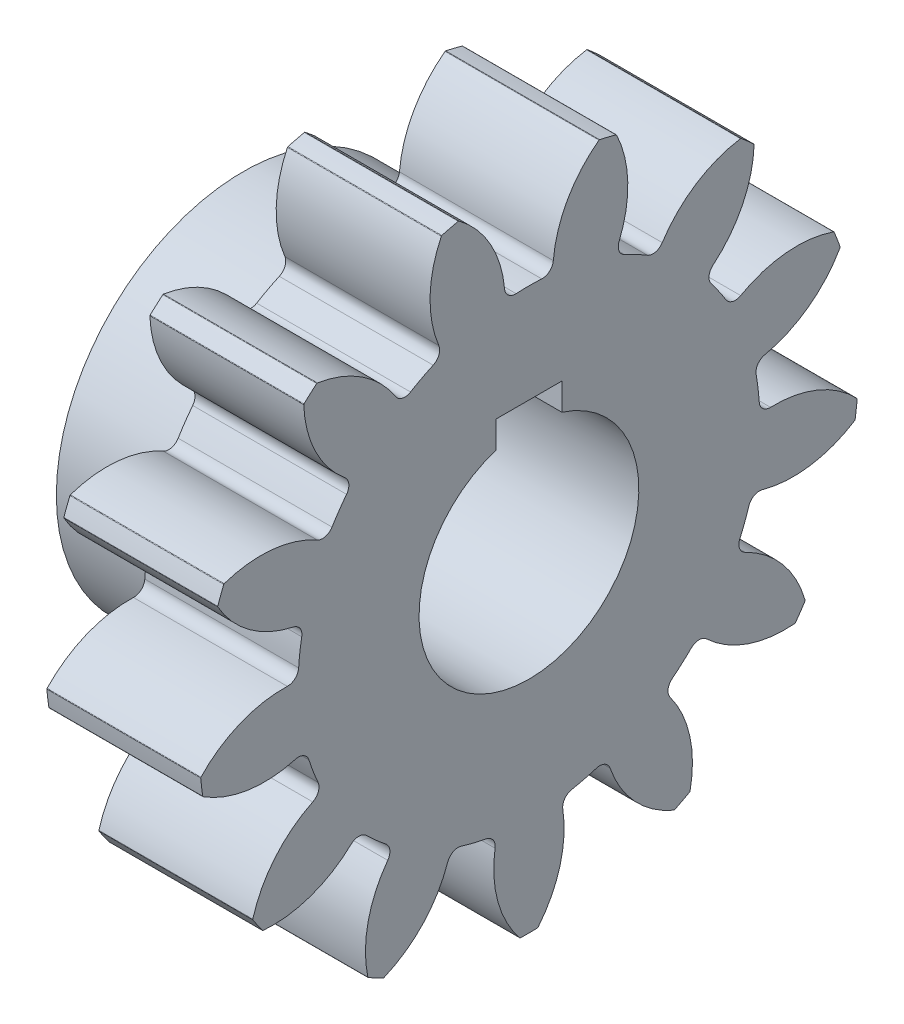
ISO-10303-21;
HEADER;
FILE_DESCRIPTION(('STEP AP214'),'2;1');
FILE_NAME('part.step','',(''),(''),'','','');
FILE_SCHEMA(('AUTOMOTIVE_DESIGN { 1 0 10303 214 1 1 1 1 }'));
ENDSEC;
DATA;
#1=APPLICATION_CONTEXT('core data for automotive mechanical design processes');
#2=APPLICATION_PROTOCOL_DEFINITION('international standard','automotive_design',2000,#1);
#3=PRODUCT_CONTEXT('',#1,'mechanical');
#4=PRODUCT('Part','Part','',(#3));
#5=PRODUCT_RELATED_PRODUCT_CATEGORY('part','',(#4));
#6=PRODUCT_DEFINITION_FORMATION('','',#4);
#7=PRODUCT_DEFINITION_CONTEXT('part definition',#1,'design');
#8=PRODUCT_DEFINITION('design','',#6,#7);
#9=PRODUCT_DEFINITION_SHAPE('','',#8);
#10=(LENGTH_UNIT() NAMED_UNIT(*) SI_UNIT(.MILLI.,.METRE.));
#11=(NAMED_UNIT(*) PLANE_ANGLE_UNIT() SI_UNIT($,.RADIAN.));
#12=(NAMED_UNIT(*) SI_UNIT($,.STERADIAN.) SOLID_ANGLE_UNIT());
#13=UNCERTAINTY_MEASURE_WITH_UNIT(LENGTH_MEASURE(1.E-05),#10,'distance_accuracy_value','');
#14=(GEOMETRIC_REPRESENTATION_CONTEXT(3) GLOBAL_UNCERTAINTY_ASSIGNED_CONTEXT((#13)) GLOBAL_UNIT_ASSIGNED_CONTEXT((#10,
#11,#12)) REPRESENTATION_CONTEXT('',''));
#15=CARTESIAN_POINT('',(0.,0.,0.));
#16=DIRECTION('',(0.,0.,1.));
#17=DIRECTION('',(1.,0.,0.));
#18=AXIS2_PLACEMENT_3D('',#15,#16,#17);
#19=CARTESIAN_POINT('',(0.,0.,0.));
#20=DIRECTION('',(1.,0.,0.));
#21=DIRECTION('',(0.,0.,-1.));
#22=AXIS2_PLACEMENT_3D('',#19,#20,#21);
#23=PLANE('',#22);
#24=CARTESIAN_POINT('',(0.,0.,0.));
#25=DIRECTION('',(-1.,0.,0.));
#26=DIRECTION('',(0.,-0.464723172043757,-0.885456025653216));
#27=AXIS2_PLACEMENT_3D('',#24,#25,#26);
#28=CIRCLE('',#27,10.499);
#29=CARTESIAN_POINT('',(0.,9.5526641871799,-4.35610008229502));
#30=VERTEX_POINT('',#29);
#31=CARTESIAN_POINT('',(0.,9.0115318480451,-5.38714161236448));
#32=VERTEX_POINT('',#31);
#33=EDGE_CURVE('E745',#30,#32,#28,.T.);
#34=ORIENTED_EDGE('',*,*,#33,.T.);
#35=CARTESIAN_POINT('',(0.,9.44155160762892,-5.64420970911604));
#36=DIRECTION('',(1.,0.,0.));
#37=DIRECTION('',(0.,0.,-1.));
#38=AXIS2_PLACEMENT_3D('',#35,#36,#37);
#39=CIRCLE('',#38,0.501);
#40=CARTESIAN_POINT('',(0.,9.16999031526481,-6.06522688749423));
#41=VERTEX_POINT('',#40);
#42=EDGE_CURVE('E1455',#32,#41,#39,.T.);
#43=ORIENTED_EDGE('',*,*,#42,.T.);
#44=CARTESIAN_POINT('',(0.,6.35139007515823,-10.435065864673));
#45=DIRECTION('',(-1.,0.,0.));
#46=DIRECTION('',(0.,-0.464723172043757,-0.885456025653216));
#47=AXIS2_PLACEMENT_3D('',#44,#45,#46);
#48=CIRCLE('',#47,5.2);
#49=CARTESIAN_POINT('',(0.,11.4877337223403,-9.62390993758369));
#50=VERTEX_POINT('',#49);
#51=EDGE_CURVE('E739',#41,#50,#48,.T.);
#52=ORIENTED_EDGE('',*,*,#51,.T.);
#53=CARTESIAN_POINT('',(0.,11.4482233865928,-9.6301495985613));
#54=DIRECTION('',(1.,0.,0.));
#55=DIRECTION('',(0.,0.,-1.));
#56=AXIS2_PLACEMENT_3D('',#53,#54,#55);
#57=CIRCLE('',#56,0.04);
#58=CARTESIAN_POINT('',(0.,11.4788336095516,-9.65589866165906));
#59=VERTEX_POINT('',#58);
#60=EDGE_CURVE('E1233',#50,#59,#57,.F.);
#61=ORIENTED_EDGE('',*,*,#60,.T.);
#62=CARTESIAN_POINT('',(0.,0.,0.));
#63=DIRECTION('',(-1.,0.,0.));
#64=DIRECTION('',(0.,0.,1.));
#65=AXIS2_PLACEMENT_3D('',#62,#63,#64);
#66=CIRCLE('',#65,15.);
#67=CARTESIAN_POINT('',(0.,10.9691167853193,-10.2312500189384));
#68=VERTEX_POINT('',#67);
#69=EDGE_CURVE('E914',#59,#68,#66,.T.);
#70=ORIENTED_EDGE('',*,*,#69,.T.);
#71=CARTESIAN_POINT('',(0.,10.9398658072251,-10.2039666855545));
#72=DIRECTION('',(1.,0.,0.));
#73=DIRECTION('',(0.,0.,-1.));
#74=AXIS2_PLACEMENT_3D('',#71,#72,#73);
#75=CIRCLE('',#74,0.04);
#76=CARTESIAN_POINT('',(0.,10.9384340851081,-10.2439410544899));
#77=VERTEX_POINT('',#76);
#78=EDGE_CURVE('E1208',#68,#77,#75,.F.);
#79=ORIENTED_EDGE('',*,*,#78,.T.);
#80=CARTESIAN_POINT('',(0.,11.1245579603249,-5.04727309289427));
#81=DIRECTION('',(1.,0.,0.));
#82=DIRECTION('',(0.,0.,-1.));
#83=AXIS2_PLACEMENT_3D('',#80,#81,#82);
#84=CIRCLE('',#83,5.2);
#85=CARTESIAN_POINT('',(0.,7.12632474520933,-8.37204844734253));
#86=VERTEX_POINT('',#85);
#87=EDGE_CURVE('E981',#86,#77,#84,.T.);
#88=ORIENTED_EDGE('',*,*,#87,.F.);
#89=CARTESIAN_POINT('',(0.,6.741110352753,-8.6923777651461));
#90=DIRECTION('',(1.,0.,0.));
#91=DIRECTION('',(0.,0.,-1.));
#92=AXIS2_PLACEMENT_3D('',#89,#90,#91);
#93=CIRCLE('',#92,0.501);
#94=CARTESIAN_POINT('',(0.,6.4340834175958,-8.29647946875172));
#95=VERTEX_POINT('',#94);
#96=EDGE_CURVE('E1441',#86,#95,#93,.T.);
#97=ORIENTED_EDGE('',*,*,#96,.T.);
#98=CARTESIAN_POINT('',(0.,0.,0.));
#99=DIRECTION('',(-1.,0.,0.));
#100=DIRECTION('',(0.,-0.822983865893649,-0.568064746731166));
#101=AXIS2_PLACEMENT_3D('',#98,#99,#100);
#102=CIRCLE('',#101,10.499);
#103=CARTESIAN_POINT('',(0.,5.47578563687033,-8.95794466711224));
#104=VERTEX_POINT('',#103);
#105=EDGE_CURVE('E757',#95,#104,#102,.T.);
#106=ORIENTED_EDGE('',*,*,#105,.T.);
#107=CARTESIAN_POINT('',(0.,5.73708372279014,-9.3854073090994));
#108=DIRECTION('',(1.,0.,0.));
#109=DIRECTION('',(0.,0.,-1.));
#110=AXIS2_PLACEMENT_3D('',#107,#108,#109);
#111=CIRCLE('',#110,0.501);
#112=CARTESIAN_POINT('',(0.,5.30097170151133,-9.63199868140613));
#113=VERTEX_POINT('',#112);
#114=EDGE_CURVE('E1437',#104,#113,#111,.T.);
#115=ORIENTED_EDGE('',*,*,#114,.T.);
#116=CARTESIAN_POINT('',(0.,0.774459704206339,-12.1914300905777));
#117=DIRECTION('',(-1.,0.,0.));
#118=DIRECTION('',(0.,-0.822983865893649,-0.568064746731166));
#119=AXIS2_PLACEMENT_3D('',#116,#117,#118);
#120=CIRCLE('',#119,5.2);
#121=CARTESIAN_POINT('',(0.,5.69942909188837,-13.8601650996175));
#122=VERTEX_POINT('',#121);
#123=EDGE_CURVE('E750',#113,#122,#120,.T.);
#124=ORIENTED_EDGE('',*,*,#123,.T.);
#125=CARTESIAN_POINT('',(0.,5.66154471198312,-13.847328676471));
#126=DIRECTION('',(1.,0.,0.));
#127=DIRECTION('',(0.,0.,-1.));
#128=AXIS2_PLACEMENT_3D('',#125,#126,#127);
#129=CIRCLE('',#128,0.04);
#130=CARTESIAN_POINT('',(0.,5.67668253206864,-13.8843536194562));
#131=VERTEX_POINT('',#130);
#132=EDGE_CURVE('E1211',#122,#131,#129,.F.);
#133=ORIENTED_EDGE('',*,*,#132,.T.);
#134=CARTESIAN_POINT('',(0.,4.95797159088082,-14.1569247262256));
#135=VERTEX_POINT('',#134);
#136=EDGE_CURVE('E1564',#131,#135,#66,.T.);
#137=ORIENTED_EDGE('',*,*,#136,.T.);
#138=CARTESIAN_POINT('',(0.,4.94475033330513,-14.1191729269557));
#139=DIRECTION('',(1.,0.,0.));
#140=DIRECTION('',(0.,0.,-1.));
#141=AXIS2_PLACEMENT_3D('',#138,#139,#140);
#142=CIRCLE('',#141,0.04);
#143=CARTESIAN_POINT('',(0.,4.92490559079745,-14.1539031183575));
#144=VERTEX_POINT('',#143);
#145=EDGE_CURVE('E1186',#135,#144,#142,.F.);
#146=ORIENTED_EDGE('',*,*,#145,.T.);
#147=CARTESIAN_POINT('',(0.,7.50472211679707,-9.63897823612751));
#148=DIRECTION('',(1.,0.,0.));
#149=DIRECTION('',(0.,0.,-1.));
#150=AXIS2_PLACEMENT_3D('',#147,#148,#149);
#151=CIRCLE('',#150,5.2);
#152=CARTESIAN_POINT('',(0.,2.41936227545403,-10.7248489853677));
#153=VERTEX_POINT('',#152);
#154=EDGE_CURVE('E979',#153,#144,#151,.T.);
#155=ORIENTED_EDGE('',*,*,#154,.F.);
#156=CARTESIAN_POINT('',(0.,1.92940741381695,-10.8294684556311));
#157=DIRECTION('',(1.,0.,0.));
#158=DIRECTION('',(0.,0.,-1.));
#159=AXIS2_PLACEMENT_3D('',#156,#157,#158);
#160=CIRCLE('',#159,0.501);
#161=CARTESIAN_POINT('',(0.,1.84153167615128,-10.3362353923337));
#162=VERTEX_POINT('',#161);
#163=EDGE_CURVE('E1423',#153,#162,#160,.T.);
#164=ORIENTED_EDGE('',*,*,#163,.T.);
#165=CARTESIAN_POINT('',(0.,0.,0.));
#166=DIRECTION('',(-1.,0.,0.));
#167=DIRECTION('',(0.,-0.992708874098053,-0.120536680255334));
#168=AXIS2_PLACEMENT_3D('',#165,#166,#167);
#169=CIRCLE('',#168,10.499);
#170=CARTESIAN_POINT('',(0.,0.685602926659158,-10.4765905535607));
#171=VERTEX_POINT('',#170);
#172=EDGE_CURVE('E770',#162,#171,#169,.T.);
#173=ORIENTED_EDGE('',*,*,#172,.T.);
#174=CARTESIAN_POINT('',(0.,0.718319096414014,-10.9765212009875));
#175=DIRECTION('',(1.,0.,0.));
#176=DIRECTION('',(0.,0.,-1.));
#177=AXIS2_PLACEMENT_3D('',#174,#175,#176);
#178=CIRCLE('',#177,0.501);
#179=CARTESIAN_POINT('',(0.,0.217564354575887,-10.9921956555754));
#180=VERTEX_POINT('',#179);
#181=EDGE_CURVE('E1419',#171,#180,#178,.T.);
#182=ORIENTED_EDGE('',*,*,#181,.T.);
#183=CARTESIAN_POINT('',(0.,-4.97989005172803,-11.1548846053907));
#184=DIRECTION('',(-1.,0.,0.));
#185=DIRECTION('',(0.,-0.992708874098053,-0.120536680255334));
#186=AXIS2_PLACEMENT_3D('',#183,#184,#185);
#187=CIRCLE('',#186,5.2);
#188=CARTESIAN_POINT('',(0.,-1.39454605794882,-14.9212234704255));
#189=VERTEX_POINT('',#188);
#190=EDGE_CURVE('E763',#180,#189,#187,.T.);
#191=ORIENTED_EDGE('',*,*,#190,.T.);
#192=CARTESIAN_POINT('',(0.,-1.42212562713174,-14.8922516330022));
#193=DIRECTION('',(1.,0.,0.));
#194=DIRECTION('',(0.,0.,-1.));
#195=AXIS2_PLACEMENT_3D('',#192,#193,#194);
#196=CIRCLE('',#195,0.04);
#197=CARTESIAN_POINT('',(0.,-1.42592810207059,-14.9320704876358));
#198=VERTEX_POINT('',#197);
#199=EDGE_CURVE('E1189',#189,#198,#196,.F.);
#200=ORIENTED_EDGE('',*,*,#199,.T.);
#201=CARTESIAN_POINT('',(0.,-2.1889851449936,-14.8394185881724));
#202=VERTEX_POINT('',#201);
#203=EDGE_CURVE('E1565',#198,#202,#66,.T.);
#204=ORIENTED_EDGE('',*,*,#203,.T.);
#205=CARTESIAN_POINT('',(0.,-2.18314785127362,-14.7998468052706));
#206=DIRECTION('',(1.,0.,0.));
#207=DIRECTION('',(0.,0.,-1.));
#208=AXIS2_PLACEMENT_3D('',#205,#206,#207);
#209=CIRCLE('',#208,0.04);
#210=CARTESIAN_POINT('',(0.,-2.21685942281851,-14.8213765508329));
#211=VERTEX_POINT('',#210);
#212=EDGE_CURVE('E1164',#202,#211,#209,.F.);
#213=ORIENTED_EDGE('',*,*,#212,.T.);
#214=CARTESIAN_POINT('',(0.,2.16564487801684,-12.0225096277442));
#215=DIRECTION('',(1.,0.,0.));
#216=DIRECTION('',(0.,0.,-1.));
#217=AXIS2_PLACEMENT_3D('',#214,#215,#216);
#218=CIRCLE('',#217,5.2);
#219=CARTESIAN_POINT('',(0.,-2.84184693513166,-10.6207158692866));
#220=VERTEX_POINT('',#219);
#221=EDGE_CURVE('E977',#220,#211,#218,.T.);
#222=ORIENTED_EDGE('',*,*,#221,.F.);
#223=CARTESIAN_POINT('',(0.,-3.32429951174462,-10.4856584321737));
#224=DIRECTION('',(1.,0.,0.));
#225=DIRECTION('',(0.,0.,-1.));
#226=AXIS2_PLACEMENT_3D('',#223,#224,#225);
#227=CIRCLE('',#226,0.501);
#228=CARTESIAN_POINT('',(0.,-3.17289277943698,-10.0080843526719));
#229=VERTEX_POINT('',#228);
#230=EDGE_CURVE('E1405',#220,#229,#227,.T.);
#231=ORIENTED_EDGE('',*,*,#230,.T.);
#232=CARTESIAN_POINT('',(0.,0.,0.));
#233=DIRECTION('',(-1.,0.,0.));
#234=DIRECTION('',(0.,-0.935016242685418,0.354604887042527));
#235=AXIS2_PLACEMENT_3D('',#232,#233,#234);
#236=CIRCLE('',#235,10.499);
#237=CARTESIAN_POINT('',(0.,-4.26164315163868,-9.59517580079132));
#238=VERTEX_POINT('',#237);
#239=EDGE_CURVE('E783',#229,#238,#236,.T.);
#240=ORIENTED_EDGE('',*,*,#239,.T.);
#241=CARTESIAN_POINT('',(0.,-4.46500377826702,-10.0530463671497));
#242=DIRECTION('',(1.,0.,0.));
#243=DIRECTION('',(0.,0.,-1.));
#244=AXIS2_PLACEMENT_3D('',#241,#242,#243);
#245=CIRCLE('',#244,0.501);
#246=CARTESIAN_POINT('',(0.,-4.91568436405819,-9.83421307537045));
#247=VERTEX_POINT('',#246);
#248=EDGE_CURVE('E1401',#238,#247,#245,.T.);
#249=ORIENTED_EDGE('',*,*,#248,.T.);
#250=CARTESIAN_POINT('',(0.,-9.59340701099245,-7.56288948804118));
#251=DIRECTION('',(-1.,0.,0.));
#252=DIRECTION('',(0.,-0.935016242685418,0.354604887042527));
#253=AXIS2_PLACEMENT_3D('',#250,#251,#252);
#254=CIRCLE('',#253,5.2);
#255=CARTESIAN_POINT('',(0.,-8.16904751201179,-12.5640093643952));
#256=VERTEX_POINT('',#255);
#257=EDGE_CURVE('E776',#247,#256,#254,.T.);
#258=ORIENTED_EDGE('',*,*,#257,.T.);
#259=CARTESIAN_POINT('',(0.,-8.18000412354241,-12.5255392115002));
#260=DIRECTION('',(1.,0.,0.));
#261=DIRECTION('',(0.,0.,-1.));
#262=AXIS2_PLACEMENT_3D('',#259,#260,#261);
#263=CIRCLE('',#262,0.04);
#264=CARTESIAN_POINT('',(0.,-8.20187579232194,-12.559029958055));
#265=VERTEX_POINT('',#264);
#266=EDGE_CURVE('E1167',#256,#265,#263,.F.);
#267=ORIENTED_EDGE('',*,*,#266,.T.);
#268=CARTESIAN_POINT('',(0.,-8.83447176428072,-12.1223804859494));
#269=VERTEX_POINT('',#268);
#270=EDGE_CURVE('E1567',#265,#269,#66,.T.);
#271=ORIENTED_EDGE('',*,*,#270,.T.);
#272=CARTESIAN_POINT('',(0.,-8.8109131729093,-12.0900541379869));
#273=DIRECTION('',(1.,0.,0.));
#274=DIRECTION('',(0.,0.,-1.));
#275=AXIS2_PLACEMENT_3D('',#272,#273,#274);
#276=CIRCLE('',#275,0.04);
#277=CARTESIAN_POINT('',(0.,-8.85076865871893,-12.0934512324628));
#278=VERTEX_POINT('',#277);
#279=EDGE_CURVE('E1142',#269,#278,#276,.F.);
#280=ORIENTED_EDGE('',*,*,#279,.T.);
#281=CARTESIAN_POINT('',(0.,-3.66955550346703,-11.6518289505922));
#282=DIRECTION('',(1.,0.,0.));
#283=DIRECTION('',(0.,0.,-1.));
#284=AXIS2_PLACEMENT_3D('',#281,#282,#283);
#285=CIRCLE('',#284,5.2);
#286=CARTESIAN_POINT('',(0.,-7.4520232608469,-8.08350474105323));
#287=VERTEX_POINT('',#286);
#288=EDGE_CURVE('E975',#287,#278,#285,.T.);
#289=ORIENTED_EDGE('',*,*,#288,.F.);
#290=CARTESIAN_POINT('',(0.,-7.81644948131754,-7.73971042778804));
#291=DIRECTION('',(1.,0.,0.));
#292=DIRECTION('',(0.,0.,-1.));
#293=AXIS2_PLACEMENT_3D('',#290,#291,#292);
#294=CIRCLE('',#293,0.501);
#295=CARTESIAN_POINT('',(0.,-7.46044573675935,-7.38720179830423));
#296=VERTEX_POINT('',#295);
#297=EDGE_CURVE('E1387',#287,#296,#294,.T.);
#298=ORIENTED_EDGE('',*,*,#297,.T.);
#299=CARTESIAN_POINT('',(0.,0.,0.));
#300=DIRECTION('',(-1.,0.,0.));
#301=DIRECTION('',(0.,-0.663122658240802,0.748510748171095));
#302=AXIS2_PLACEMENT_3D('',#299,#300,#301);
#303=CIRCLE('',#302,10.499);
#304=CARTESIAN_POINT('',(0.,-8.23259814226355,-6.5156219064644));
#305=VERTEX_POINT('',#304);
#306=EDGE_CURVE('E796',#296,#305,#303,.T.);
#307=ORIENTED_EDGE('',*,*,#306,.T.);
#308=CARTESIAN_POINT('',(0.,-8.62544809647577,-6.82653976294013));
#309=DIRECTION('',(1.,0.,0.));
#310=DIRECTION('',(0.,0.,-1.));
#311=AXIS2_PLACEMENT_3D('',#308,#309,#310);
#312=CIRCLE('',#311,0.501);
#313=CARTESIAN_POINT('',(0.,-8.92280903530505,-6.42333079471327));
#314=VERTEX_POINT('',#313);
#315=EDGE_CURVE('E1383',#305,#314,#312,.T.);
#316=ORIENTED_EDGE('',*,*,#315,.T.);
#317=CARTESIAN_POINT('',(0.,-12.009190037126,-2.23832753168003));
#318=DIRECTION('',(-1.,0.,0.));
#319=DIRECTION('',(0.,-0.663122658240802,0.748510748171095));
#320=AXIS2_PLACEMENT_3D('',#317,#318,#319);
#321=CIRCLE('',#320,5.2);
#322=CARTESIAN_POINT('',(0.,-13.0721186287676,-7.32853212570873));
#323=VERTEX_POINT('',#322);
#324=EDGE_CURVE('E789',#314,#323,#321,.T.);
#325=ORIENTED_EDGE('',*,*,#324,.T.);
#326=CARTESIAN_POINT('',(0.,-13.0639422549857,-7.28937670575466));
#327=DIRECTION('',(1.,0.,0.));
#328=DIRECTION('',(0.,0.,-1.));
#329=AXIS2_PLACEMENT_3D('',#326,#327,#328);
#330=CIRCLE('',#329,0.04);
#331=CARTESIAN_POINT('',(0.,-13.0988725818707,-7.30886701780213));
#332=VERTEX_POINT('',#331);
#333=EDGE_CURVE('E1145',#323,#332,#330,.F.);
#334=ORIENTED_EDGE('',*,*,#333,.T.);
#335=CARTESIAN_POINT('',(0.,-13.4560873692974,-6.62825110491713));
#336=VERTEX_POINT('',#335);
#337=EDGE_CURVE('E1569',#332,#336,#66,.T.);
#338=ORIENTED_EDGE('',*,*,#337,.T.);
#339=CARTESIAN_POINT('',(0.,-13.4202044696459,-6.61057576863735));
#340=DIRECTION('',(1.,0.,0.));
#341=DIRECTION('',(0.,0.,-1.));
#342=AXIS2_PLACEMENT_3D('',#339,#340,#341);
#343=CIRCLE('',#342,0.04);
#344=CARTESIAN_POINT('',(0.,-13.457073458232,-6.59506197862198));
#345=VERTEX_POINT('',#344);
#346=EDGE_CURVE('E1120',#336,#345,#343,.F.);
#347=ORIENTED_EDGE('',*,*,#346,.T.);
#348=CARTESIAN_POINT('',(0.,-8.66410494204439,-8.61185468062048));
#349=DIRECTION('',(1.,0.,0.));
#350=DIRECTION('',(0.,0.,-1.));
#351=AXIS2_PLACEMENT_3D('',#348,#349,#350);
#352=CIRCLE('',#351,5.2);
#353=CARTESIAN_POINT('',(0.,-10.3550308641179,-3.69446009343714));
#354=VERTEX_POINT('',#353);
#355=EDGE_CURVE('E973',#354,#345,#352,.T.);
#356=ORIENTED_EDGE('',*,*,#355,.F.);
#357=CARTESIAN_POINT('',(0.,-10.5179450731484,-3.22068803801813));
#358=DIRECTION('',(1.,0.,0.));
#359=DIRECTION('',(0.,0.,-1.));
#360=AXIS2_PLACEMENT_3D('',#357,#358,#359);
#361=CIRCLE('',#360,0.501);
#362=CARTESIAN_POINT('',(0.,-10.0389004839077,-3.07400033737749));
#363=VERTEX_POINT('',#362);
#364=EDGE_CURVE('E1369',#354,#363,#361,.T.);
#365=ORIENTED_EDGE('',*,*,#364,.T.);
#366=CARTESIAN_POINT('',(0.,0.,0.));
#367=DIRECTION('',(-1.,0.,0.));
#368=DIRECTION('',(0.,-0.239315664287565,0.97094181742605));
#369=AXIS2_PLACEMENT_3D('',#366,#367,#368);
#370=CIRCLE('',#369,10.499);
#371=CARTESIAN_POINT('',(0.,-10.3175641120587,-1.94341755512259));
#372=VERTEX_POINT('',#371);
#373=EDGE_CURVE('E809',#363,#372,#370,.T.);
#374=ORIENTED_EDGE('',*,*,#373,.T.);
#375=CARTESIAN_POINT('',(0.,-10.8099062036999,-2.03615516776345));
#376=DIRECTION('',(1.,0.,0.));
#377=DIRECTION('',(0.,0.,-1.));
#378=AXIS2_PLACEMENT_3D('',#375,#376,#377);
#379=CIRCLE('',#378,0.501);
#380=CARTESIAN_POINT('',(0.,-10.8858256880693,-1.54094083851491));
#381=VERTEX_POINT('',#380);
#382=EDGE_CURVE('E1365',#372,#381,#379,.T.);
#383=ORIENTED_EDGE('',*,*,#382,.T.);
#384=CARTESIAN_POINT('',(0.,-11.6738123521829,3.59900828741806));
#385=DIRECTION('',(-1.,0.,0.));
#386=DIRECTION('',(0.,-0.239315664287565,0.97094181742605));
#387=AXIS2_PLACEMENT_3D('',#384,#385,#386);
#388=CIRCLE('',#387,5.2);
#389=CARTESIAN_POINT('',(0.,-14.9805249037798,-0.4141764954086));
#390=VERTEX_POINT('',#389);
#391=EDGE_CURVE('E802',#381,#390,#388,.T.);
#392=ORIENTED_EDGE('',*,*,#391,.T.);
#393=CARTESIAN_POINT('',(0.,-14.9550886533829,-0.383305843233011));
#394=DIRECTION('',(1.,0.,0.));
#395=DIRECTION('',(0.,0.,-1.));
#396=AXIS2_PLACEMENT_3D('',#393,#394,#395);
#397=CIRCLE('',#396,0.04);
#398=CARTESIAN_POINT('',(0.,-14.9950755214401,-0.384330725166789));
#399=VERTEX_POINT('',#398);
#400=EDGE_CURVE('E1123',#390,#399,#397,.F.);
#401=ORIENTED_EDGE('',*,*,#400,.T.);
#402=CARTESIAN_POINT('',(0.,-14.9950755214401,0.384330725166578));
#403=VERTEX_POINT('',#402);
#404=EDGE_CURVE('E1571',#399,#403,#66,.T.);
#405=ORIENTED_EDGE('',*,*,#404,.T.);
#406=CARTESIAN_POINT('',(0.,-14.955088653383,0.3833058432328));
#407=DIRECTION('',(1.,0.,0.));
#408=DIRECTION('',(0.,0.,-1.));
#409=AXIS2_PLACEMENT_3D('',#406,#407,#408);
#410=CIRCLE('',#409,0.04);
#411=CARTESIAN_POINT('',(0.,-14.9805249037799,0.41417649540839));
#412=VERTEX_POINT('',#411);
#413=EDGE_CURVE('E1098',#403,#412,#410,.F.);
#414=ORIENTED_EDGE('',*,*,#413,.T.);
#415=CARTESIAN_POINT('',(0.,-11.6738123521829,-3.59900828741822));
#416=DIRECTION('',(1.,0.,0.));
#417=DIRECTION('',(0.,0.,-1.));
#418=AXIS2_PLACEMENT_3D('',#415,#416,#417);
#419=CIRCLE('',#418,5.2);
#420=CARTESIAN_POINT('',(0.,-10.8858256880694,1.54094083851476));
#421=VERTEX_POINT('',#420);
#422=EDGE_CURVE('E971',#421,#412,#419,.T.);
#423=ORIENTED_EDGE('',*,*,#422,.F.);
#424=CARTESIAN_POINT('',(0.,-10.8099062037,2.0361551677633));
#425=DIRECTION('',(1.,0.,0.));
#426=DIRECTION('',(0.,0.,-1.));
#427=AXIS2_PLACEMENT_3D('',#424,#425,#426);
#428=CIRCLE('',#427,0.501);
#429=CARTESIAN_POINT('',(0.,-10.3175641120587,1.94341755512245));
#430=VERTEX_POINT('',#429);
#431=EDGE_CURVE('E1351',#421,#430,#428,.T.);
#432=ORIENTED_EDGE('',*,*,#431,.T.);
#433=CARTESIAN_POINT('',(0.,0.,0.));
#434=DIRECTION('',(-1.,0.,0.));
#435=DIRECTION('',(0.,0.239315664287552,0.970941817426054));
#436=AXIS2_PLACEMENT_3D('',#433,#434,#435);
#437=CIRCLE('',#436,10.499);
#438=CARTESIAN_POINT('',(0.,-10.0389004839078,3.07400033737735));
#439=VERTEX_POINT('',#438);
#440=EDGE_CURVE('E822',#430,#439,#437,.T.);
#441=ORIENTED_EDGE('',*,*,#440,.T.);
#442=CARTESIAN_POINT('',(0.,-10.5179450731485,3.22068803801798));
#443=DIRECTION('',(1.,0.,0.));
#444=DIRECTION('',(0.,0.,-1.));
#445=AXIS2_PLACEMENT_3D('',#442,#443,#444);
#446=CIRCLE('',#445,0.501);
#447=CARTESIAN_POINT('',(0.,-10.3550308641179,3.694460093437));
#448=VERTEX_POINT('',#447);
#449=EDGE_CURVE('E1347',#439,#448,#446,.T.);
#450=ORIENTED_EDGE('',*,*,#449,.T.);
#451=CARTESIAN_POINT('',(0.,-8.66410494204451,8.61185468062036));
#452=DIRECTION('',(-1.,0.,0.));
#453=DIRECTION('',(0.,0.239315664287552,0.970941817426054));
#454=AXIS2_PLACEMENT_3D('',#451,#452,#453);
#455=CIRCLE('',#454,5.2);
#456=CARTESIAN_POINT('',(0.,-13.4570734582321,6.59506197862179));
#457=VERTEX_POINT('',#456);
#458=EDGE_CURVE('E815',#448,#457,#455,.T.);
#459=ORIENTED_EDGE('',*,*,#458,.T.);
#460=CARTESIAN_POINT('',(0.,-13.420204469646,6.61057576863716));
#461=DIRECTION('',(1.,0.,0.));
#462=DIRECTION('',(0.,0.,-1.));
#463=AXIS2_PLACEMENT_3D('',#460,#461,#462);
#464=CIRCLE('',#463,0.04);
#465=CARTESIAN_POINT('',(0.,-13.4560873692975,6.62825110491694));
#466=VERTEX_POINT('',#465);
#467=EDGE_CURVE('E1101',#457,#466,#464,.F.);
#468=ORIENTED_EDGE('',*,*,#467,.T.);
#469=CARTESIAN_POINT('',(0.,-13.0988725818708,7.30886701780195));
#470=VERTEX_POINT('',#469);
#471=EDGE_CURVE('E1573',#466,#470,#66,.T.);
#472=ORIENTED_EDGE('',*,*,#471,.T.);
#473=CARTESIAN_POINT('',(0.,-13.0639422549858,7.28937670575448));
#474=DIRECTION('',(1.,0.,0.));
#475=DIRECTION('',(0.,0.,-1.));
#476=AXIS2_PLACEMENT_3D('',#473,#474,#475);
#477=CIRCLE('',#476,0.04);
#478=CARTESIAN_POINT('',(0.,-13.0721186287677,7.32853212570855));
#479=VERTEX_POINT('',#478);
#480=EDGE_CURVE('E1076',#470,#479,#477,.F.);
#481=ORIENTED_EDGE('',*,*,#480,.T.);
#482=CARTESIAN_POINT('',(0.,-12.009190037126,2.23832753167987));
#483=DIRECTION('',(1.,0.,0.));
#484=DIRECTION('',(0.,0.,-1.));
#485=AXIS2_PLACEMENT_3D('',#482,#483,#484);
#486=CIRCLE('',#485,5.2);
#487=CARTESIAN_POINT('',(0.,-8.92280903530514,6.42333079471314));
#488=VERTEX_POINT('',#487);
#489=EDGE_CURVE('E969',#488,#479,#486,.T.);
#490=ORIENTED_EDGE('',*,*,#489,.F.);
#491=CARTESIAN_POINT('',(0.,-8.62544809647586,6.82653976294));
#492=DIRECTION('',(1.,0.,0.));
#493=DIRECTION('',(0.,0.,-1.));
#494=AXIS2_PLACEMENT_3D('',#491,#492,#493);
#495=CIRCLE('',#494,0.501);
#496=CARTESIAN_POINT('',(0.,-8.23259814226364,6.51562190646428));
#497=VERTEX_POINT('',#496);
#498=EDGE_CURVE('E1333',#488,#497,#495,.T.);
#499=ORIENTED_EDGE('',*,*,#498,.T.);
#500=CARTESIAN_POINT('',(0.,0.,0.));
#501=DIRECTION('',(-1.,0.,0.));
#502=DIRECTION('',(0.,0.663122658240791,0.748510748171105));
#503=AXIS2_PLACEMENT_3D('',#500,#501,#502);
#504=CIRCLE('',#503,10.499);
#505=CARTESIAN_POINT('',(0.,-7.46044573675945,7.38720179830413));
#506=VERTEX_POINT('',#505);
#507=EDGE_CURVE('E835',#497,#506,#504,.T.);
#508=ORIENTED_EDGE('',*,*,#507,.T.);
#509=CARTESIAN_POINT('',(0.,-7.81644948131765,7.73971042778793));
#510=DIRECTION('',(1.,0.,0.));
#511=DIRECTION('',(0.,0.,-1.));
#512=AXIS2_PLACEMENT_3D('',#509,#510,#511);
#513=CIRCLE('',#512,0.501);
#514=CARTESIAN_POINT('',(0.,-7.45202326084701,8.08350474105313));
#515=VERTEX_POINT('',#514);
#516=EDGE_CURVE('E1329',#506,#515,#513,.T.);
#517=ORIENTED_EDGE('',*,*,#516,.T.);
#518=CARTESIAN_POINT('',(0.,-3.66955550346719,11.6518289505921));
#519=DIRECTION('',(-1.,0.,0.));
#520=DIRECTION('',(0.,0.663122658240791,0.748510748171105));
#521=AXIS2_PLACEMENT_3D('',#518,#519,#520);
#522=CIRCLE('',#521,5.2);
#523=CARTESIAN_POINT('',(0.,-8.8507686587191,12.0934512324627));
#524=VERTEX_POINT('',#523);
#525=EDGE_CURVE('E828',#515,#524,#522,.T.);
#526=ORIENTED_EDGE('',*,*,#525,.T.);
#527=CARTESIAN_POINT('',(0.,-8.81091317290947,12.0900541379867));
#528=DIRECTION('',(1.,0.,0.));
#529=DIRECTION('',(0.,0.,-1.));
#530=AXIS2_PLACEMENT_3D('',#527,#528,#529);
#531=CIRCLE('',#530,0.04);
#532=CARTESIAN_POINT('',(0.,-8.83447176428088,12.1223804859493));
#533=VERTEX_POINT('',#532);
#534=EDGE_CURVE('E1079',#524,#533,#531,.F.);
#535=ORIENTED_EDGE('',*,*,#534,.T.);
#536=CARTESIAN_POINT('',(0.,-8.20187579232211,12.5590299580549));
#537=VERTEX_POINT('',#536);
#538=EDGE_CURVE('E1575',#533,#537,#66,.T.);
#539=ORIENTED_EDGE('',*,*,#538,.T.);
#540=CARTESIAN_POINT('',(0.,-8.18000412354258,12.5255392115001));
#541=DIRECTION('',(1.,0.,0.));
#542=DIRECTION('',(0.,0.,-1.));
#543=AXIS2_PLACEMENT_3D('',#540,#541,#542);
#544=CIRCLE('',#543,0.04);
#545=CARTESIAN_POINT('',(0.,-8.16904751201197,12.5640093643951));
#546=VERTEX_POINT('',#545);
#547=EDGE_CURVE('E1054',#537,#546,#544,.F.);
#548=ORIENTED_EDGE('',*,*,#547,.T.);
#549=CARTESIAN_POINT('',(0.,-9.59340701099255,7.56288948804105));
#550=DIRECTION('',(1.,0.,0.));
#551=DIRECTION('',(0.,0.,-1.));
#552=AXIS2_PLACEMENT_3D('',#549,#550,#551);
#553=CIRCLE('',#552,5.2);
#554=CARTESIAN_POINT('',(0.,-4.91568436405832,9.83421307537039));
#555=VERTEX_POINT('',#554);
#556=EDGE_CURVE('E967',#555,#546,#553,.T.);
#557=ORIENTED_EDGE('',*,*,#556,.F.);
#558=CARTESIAN_POINT('',(0.,-4.46500377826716,10.0530463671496));
#559=DIRECTION('',(1.,0.,0.));
#560=DIRECTION('',(0.,0.,-1.));
#561=AXIS2_PLACEMENT_3D('',#558,#559,#560);
#562=CIRCLE('',#561,0.501);
#563=CARTESIAN_POINT('',(0.,-4.26164315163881,9.59517580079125));
#564=VERTEX_POINT('',#563);
#565=EDGE_CURVE('E1315',#555,#564,#562,.T.);
#566=ORIENTED_EDGE('',*,*,#565,.T.);
#567=CARTESIAN_POINT('',(0.,0.,0.));
#568=DIRECTION('',(-1.,0.,0.));
#569=DIRECTION('',(0.,0.935016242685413,0.35460488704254));
#570=AXIS2_PLACEMENT_3D('',#567,#568,#569);
#571=CIRCLE('',#570,10.499);
#572=CARTESIAN_POINT('',(0.,-3.17289277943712,10.0080843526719));
#573=VERTEX_POINT('',#572);
#574=EDGE_CURVE('E848',#564,#573,#571,.T.);
#575=ORIENTED_EDGE('',*,*,#574,.T.);
#576=CARTESIAN_POINT('',(0.,-3.32429951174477,10.4856584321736));
#577=DIRECTION('',(1.,0.,0.));
#578=DIRECTION('',(0.,0.,-1.));
#579=AXIS2_PLACEMENT_3D('',#576,#577,#578);
#580=CIRCLE('',#579,0.501);
#581=CARTESIAN_POINT('',(0.,-2.84184693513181,10.6207158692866));
#582=VERTEX_POINT('',#581);
#583=EDGE_CURVE('E1311',#573,#582,#580,.T.);
#584=ORIENTED_EDGE('',*,*,#583,.T.);
#585=CARTESIAN_POINT('',(0.,2.16564487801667,12.0225096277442));
#586=DIRECTION('',(-1.,0.,0.));
#587=DIRECTION('',(0.,0.935016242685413,0.35460488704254));
#588=AXIS2_PLACEMENT_3D('',#585,#586,#587);
#589=CIRCLE('',#588,5.2);
#590=CARTESIAN_POINT('',(0.,-2.21685942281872,14.8213765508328));
#591=VERTEX_POINT('',#590);
#592=EDGE_CURVE('E841',#582,#591,#589,.T.);
#593=ORIENTED_EDGE('',*,*,#592,.T.);
#594=CARTESIAN_POINT('',(0.,-2.18314785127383,14.7998468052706));
#595=DIRECTION('',(1.,0.,0.));
#596=DIRECTION('',(0.,0.,-1.));
#597=AXIS2_PLACEMENT_3D('',#594,#595,#596);
#598=CIRCLE('',#597,0.04);
#599=CARTESIAN_POINT('',(0.,-2.18898514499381,14.8394185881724));
#600=VERTEX_POINT('',#599);
#601=EDGE_CURVE('E1057',#591,#600,#598,.F.);
#602=ORIENTED_EDGE('',*,*,#601,.T.);
#603=CARTESIAN_POINT('',(0.,-1.4259281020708,14.9320704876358));
#604=VERTEX_POINT('',#603);
#605=EDGE_CURVE('E1577',#600,#604,#66,.T.);
#606=ORIENTED_EDGE('',*,*,#605,.T.);
#607=CARTESIAN_POINT('',(0.,-1.42212562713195,14.8922516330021));
#608=DIRECTION('',(1.,0.,0.));
#609=DIRECTION('',(0.,0.,-1.));
#610=AXIS2_PLACEMENT_3D('',#607,#608,#609);
#611=CIRCLE('',#610,0.04);
#612=CARTESIAN_POINT('',(0.,-1.39454605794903,14.9212234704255));
#613=VERTEX_POINT('',#612);
#614=EDGE_CURVE('E1032',#604,#613,#611,.F.);
#615=ORIENTED_EDGE('',*,*,#614,.T.);
#616=CARTESIAN_POINT('',(0.,-4.97989005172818,11.1548846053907));
#617=DIRECTION('',(1.,0.,0.));
#618=DIRECTION('',(0.,0.,-1.));
#619=AXIS2_PLACEMENT_3D('',#616,#617,#618);
#620=CIRCLE('',#619,5.2);
#621=CARTESIAN_POINT('',(0.,0.217564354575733,10.9921956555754));
#622=VERTEX_POINT('',#621);
#623=EDGE_CURVE('E965',#622,#613,#620,.T.);
#624=ORIENTED_EDGE('',*,*,#623,.F.);
#625=CARTESIAN_POINT('',(0.,0.718319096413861,10.9765212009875));
#626=DIRECTION('',(1.,0.,0.));
#627=DIRECTION('',(0.,0.,-1.));
#628=AXIS2_PLACEMENT_3D('',#625,#626,#627);
#629=CIRCLE('',#628,0.501);
#630=CARTESIAN_POINT('',(0.,0.685602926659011,10.4765905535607));
#631=VERTEX_POINT('',#630);
#632=EDGE_CURVE('E1297',#622,#631,#629,.T.);
#633=ORIENTED_EDGE('',*,*,#632,.T.);
#634=CARTESIAN_POINT('',(0.,0.,0.));
#635=DIRECTION('',(-1.,0.,0.));
#636=DIRECTION('',(0.,0.992708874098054,-0.12053668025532));
#637=AXIS2_PLACEMENT_3D('',#634,#635,#636);
#638=CIRCLE('',#637,10.499);
#639=CARTESIAN_POINT('',(0.,1.84153167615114,10.3362353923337));
#640=VERTEX_POINT('',#639);
#641=EDGE_CURVE('E861',#631,#640,#638,.T.);
#642=ORIENTED_EDGE('',*,*,#641,.T.);
#643=CARTESIAN_POINT('',(0.,1.92940741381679,10.8294684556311));
#644=DIRECTION('',(1.,0.,0.));
#645=DIRECTION('',(0.,0.,-1.));
#646=AXIS2_PLACEMENT_3D('',#643,#644,#645);
#647=CIRCLE('',#646,0.501);
#648=CARTESIAN_POINT('',(0.,2.41936227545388,10.7248489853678));
#649=VERTEX_POINT('',#648);
#650=EDGE_CURVE('E1293',#640,#649,#647,.T.);
#651=ORIENTED_EDGE('',*,*,#650,.T.);
#652=CARTESIAN_POINT('',(0.,7.50472211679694,9.63897823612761));
#653=DIRECTION('',(-1.,0.,0.));
#654=DIRECTION('',(0.,0.992708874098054,-0.12053668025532));
#655=AXIS2_PLACEMENT_3D('',#652,#653,#654);
#656=CIRCLE('',#655,5.2);
#657=CARTESIAN_POINT('',(0.,4.92490559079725,14.1539031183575));
#658=VERTEX_POINT('',#657);
#659=EDGE_CURVE('E854',#649,#658,#656,.T.);
#660=ORIENTED_EDGE('',*,*,#659,.T.);
#661=CARTESIAN_POINT('',(0.,4.94475033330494,14.1191729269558));
#662=DIRECTION('',(1.,0.,0.));
#663=DIRECTION('',(0.,0.,-1.));
#664=AXIS2_PLACEMENT_3D('',#661,#662,#663);
#665=CIRCLE('',#664,0.04);
#666=CARTESIAN_POINT('',(0.,4.95797159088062,14.1569247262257));
#667=VERTEX_POINT('',#666);
#668=EDGE_CURVE('E1035',#658,#667,#665,.F.);
#669=ORIENTED_EDGE('',*,*,#668,.T.);
#670=CARTESIAN_POINT('',(0.,5.67668253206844,13.8843536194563));
#671=VERTEX_POINT('',#670);
#672=EDGE_CURVE('E1579',#667,#671,#66,.T.);
#673=ORIENTED_EDGE('',*,*,#672,.T.);
#674=CARTESIAN_POINT('',(0.,5.66154471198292,13.8473286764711));
#675=DIRECTION('',(1.,0.,0.));
#676=DIRECTION('',(0.,0.,-1.));
#677=AXIS2_PLACEMENT_3D('',#674,#675,#676);
#678=CIRCLE('',#677,0.04);
#679=CARTESIAN_POINT('',(0.,5.69942909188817,13.8601650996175));
#680=VERTEX_POINT('',#679);
#681=EDGE_CURVE('E1010',#671,#680,#678,.F.);
#682=ORIENTED_EDGE('',*,*,#681,.T.);
#683=CARTESIAN_POINT('',(0.,0.774459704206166,12.1914300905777));
#684=DIRECTION('',(1.,0.,0.));
#685=DIRECTION('',(0.,0.,-1.));
#686=AXIS2_PLACEMENT_3D('',#683,#684,#685);
#687=CIRCLE('',#686,5.2);
#688=CARTESIAN_POINT('',(0.,5.30097170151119,9.6319986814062));
#689=VERTEX_POINT('',#688);
#690=EDGE_CURVE('E963',#689,#680,#687,.T.);
#691=ORIENTED_EDGE('',*,*,#690,.F.);
#692=CARTESIAN_POINT('',(0.,5.73708372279,9.38540730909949));
#693=DIRECTION('',(1.,0.,0.));
#694=DIRECTION('',(0.,0.,-1.));
#695=AXIS2_PLACEMENT_3D('',#692,#693,#694);
#696=CIRCLE('',#695,0.501);
#697=CARTESIAN_POINT('',(0.,5.4757856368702,8.95794466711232));
#698=VERTEX_POINT('',#697);
#699=EDGE_CURVE('E1279',#689,#698,#696,.T.);
#700=ORIENTED_EDGE('',*,*,#699,.T.);
#701=CARTESIAN_POINT('',(0.,0.,0.));
#702=DIRECTION('',(-1.,0.,0.));
#703=DIRECTION('',(0.,0.822983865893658,-0.568064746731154));
#704=AXIS2_PLACEMENT_3D('',#701,#702,#703);
#705=CIRCLE('',#704,10.499);
#706=CARTESIAN_POINT('',(0.,6.43408341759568,8.29647946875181));
#707=VERTEX_POINT('',#706);
#708=EDGE_CURVE('E874',#698,#707,#705,.T.);
#709=ORIENTED_EDGE('',*,*,#708,.T.);
#710=CARTESIAN_POINT('',(0.,6.74111035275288,8.6923777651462));
#711=DIRECTION('',(1.,0.,0.));
#712=DIRECTION('',(0.,0.,-1.));
#713=AXIS2_PLACEMENT_3D('',#710,#711,#712);
#714=CIRCLE('',#713,0.501);
#715=CARTESIAN_POINT('',(0.,7.12632474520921,8.37204844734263));
#716=VERTEX_POINT('',#715);
#717=EDGE_CURVE('E1275',#707,#716,#714,.T.);
#718=ORIENTED_EDGE('',*,*,#717,.T.);
#719=CARTESIAN_POINT('',(0.,11.1245579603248,5.04727309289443));
#720=DIRECTION('',(-1.,0.,0.));
#721=DIRECTION('',(0.,0.822983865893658,-0.568064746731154));
#722=AXIS2_PLACEMENT_3D('',#719,#720,#721);
#723=CIRCLE('',#722,5.2);
#724=CARTESIAN_POINT('',(0.,10.9384340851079,10.24394105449));
#725=VERTEX_POINT('',#724);
#726=EDGE_CURVE('E867',#716,#725,#723,.T.);
#727=ORIENTED_EDGE('',*,*,#726,.T.);
#728=CARTESIAN_POINT('',(0.,10.939865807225,10.2039666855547));
#729=DIRECTION('',(1.,0.,0.));
#730=DIRECTION('',(0.,0.,-1.));
#731=AXIS2_PLACEMENT_3D('',#728,#729,#730);
#732=CIRCLE('',#731,0.04);
#733=CARTESIAN_POINT('',(0.,10.9691167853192,10.2312500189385));
#734=VERTEX_POINT('',#733);
#735=EDGE_CURVE('E1013',#725,#734,#732,.F.);
#736=ORIENTED_EDGE('',*,*,#735,.T.);
#737=CARTESIAN_POINT('',(0.,11.4788336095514,9.65589866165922));
#738=VERTEX_POINT('',#737);
#739=EDGE_CURVE('E1581',#734,#738,#66,.T.);
#740=ORIENTED_EDGE('',*,*,#739,.T.);
#741=CARTESIAN_POINT('',(0.,11.4482233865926,9.63014959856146));
#742=DIRECTION('',(1.,0.,0.));
#743=DIRECTION('',(0.,0.,-1.));
#744=AXIS2_PLACEMENT_3D('',#741,#742,#743);
#745=CIRCLE('',#744,0.04);
#746=CARTESIAN_POINT('',(0.,11.4877337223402,9.62390993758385));
#747=VERTEX_POINT('',#746);
#748=EDGE_CURVE('E988',#738,#747,#745,.F.);
#749=ORIENTED_EDGE('',*,*,#748,.T.);
#750=CARTESIAN_POINT('',(0.,6.35139007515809,10.4350658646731));
#751=DIRECTION('',(1.,0.,0.));
#752=DIRECTION('',(0.,0.,-1.));
#753=AXIS2_PLACEMENT_3D('',#750,#751,#752);
#754=CIRCLE('',#753,5.2);
#755=CARTESIAN_POINT('',(0.,9.16999031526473,6.06522688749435));
#756=VERTEX_POINT('',#755);
#757=EDGE_CURVE('E961',#756,#747,#754,.T.);
#758=ORIENTED_EDGE('',*,*,#757,.F.);
#759=CARTESIAN_POINT('',(0.,9.44155160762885,5.64420970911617));
#760=DIRECTION('',(1.,0.,0.));
#761=DIRECTION('',(0.,0.,-1.));
#762=AXIS2_PLACEMENT_3D('',#759,#760,#761);
#763=CIRCLE('',#762,0.501);
#764=CARTESIAN_POINT('',(0.,9.01153184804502,5.3871416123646));
#765=VERTEX_POINT('',#764);
#766=EDGE_CURVE('E1261',#756,#765,#763,.T.);
#767=ORIENTED_EDGE('',*,*,#766,.T.);
#768=CARTESIAN_POINT('',(0.,0.,0.));
#769=DIRECTION('',(-1.,0.,0.));
#770=DIRECTION('',(0.,0.46472317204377,-0.885456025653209));
#771=AXIS2_PLACEMENT_3D('',#768,#769,#770);
#772=CIRCLE('',#771,10.499);
#773=CARTESIAN_POINT('',(0.,9.55266418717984,4.35610008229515));
#774=VERTEX_POINT('',#773);
#775=EDGE_CURVE('E887',#765,#774,#772,.T.);
#776=ORIENTED_EDGE('',*,*,#775,.T.);
#777=CARTESIAN_POINT('',(0.,10.0085061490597,4.56396808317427));
#778=DIRECTION('',(1.,0.,0.));
#779=DIRECTION('',(0.,0.,-1.));
#780=AXIS2_PLACEMENT_3D('',#777,#778,#779);
#781=CIRCLE('',#780,0.501);
#782=CARTESIAN_POINT('',(0.,10.2007320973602,4.1013125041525));
#783=VERTEX_POINT('',#782);
#784=EDGE_CURVE('E1257',#774,#783,#781,.T.);
#785=ORIENTED_EDGE('',*,*,#784,.T.);
#786=CARTESIAN_POINT('',(0.,12.1958916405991,-0.700701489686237));
#787=DIRECTION('',(-1.,0.,0.));
#788=DIRECTION('',(0.,0.46472317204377,-0.885456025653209));
#789=AXIS2_PLACEMENT_3D('',#786,#787,#788);
#790=CIRCLE('',#789,5.2);
#791=CARTESIAN_POINT('',(0.,14.4460991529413,3.98721554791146));
#792=VERTEX_POINT('',#791);
#793=EDGE_CURVE('E880',#783,#792,#790,.T.);
#794=ORIENTED_EDGE('',*,*,#793,.T.);
#795=CARTESIAN_POINT('',(0.,14.4287898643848,3.95115464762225));
#796=DIRECTION('',(1.,0.,0.));
#797=DIRECTION('',(0.,0.,-1.));
#798=AXIS2_PLACEMENT_3D('',#795,#796,#797);
#799=CIRCLE('',#798,0.04);
#800=CARTESIAN_POINT('',(0.,14.4673695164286,3.96171923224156));
#801=VERTEX_POINT('',#800);
#802=EDGE_CURVE('E991',#792,#801,#799,.F.);
#803=ORIENTED_EDGE('',*,*,#802,.T.);
#804=CARTESIAN_POINT('',(0.,14.6513222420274,3.21539368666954));
#805=VERTEX_POINT('',#804);
#806=EDGE_CURVE('E906',#801,#805,#66,.T.);
#807=ORIENTED_EDGE('',*,*,#806,.T.);
#808=CARTESIAN_POINT('',(0.,14.612252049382,3.20681930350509));
#809=DIRECTION('',(1.,0.,0.));
#810=DIRECTION('',(0.,0.,-1.));
#811=AXIS2_PLACEMENT_3D('',#808,#809,#810);
#812=CIRCLE('',#811,0.04);
#813=CARTESIAN_POINT('',(0.,14.6443369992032,3.18293298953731));
#814=VERTEX_POINT('',#813);
#815=EDGE_CURVE('E924',#805,#814,#812,.F.);
#816=ORIENTED_EDGE('',*,*,#815,.T.);
#817=CARTESIAN_POINT('',(0.,10.4732935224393,6.28815380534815));
#818=DIRECTION('',(1.,0.,0.));
#819=DIRECTION('',(0.,0.,-1.));
#820=AXIS2_PLACEMENT_3D('',#817,#818,#819);
#821=CIRCLE('',#820,5.2);
#822=CARTESIAN_POINT('',(0.,10.9382746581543,1.10898470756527));
#823=VERTEX_POINT('',#822);
#824=EDGE_CURVE('E918',#823,#814,#821,.T.);
#825=ORIENTED_EDGE('',*,*,#824,.F.);
#826=CARTESIAN_POINT('',(0.,10.9830738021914,0.609991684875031));
#827=DIRECTION('',(1.,0.,0.));
#828=DIRECTION('',(0.,0.,-1.));
#829=AXIS2_PLACEMENT_3D('',#826,#827,#828);
#830=CIRCLE('',#829,0.501);
#831=CARTESIAN_POINT('',(0.,10.4828447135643,0.58220933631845));
#832=VERTEX_POINT('',#831);
#833=EDGE_CURVE('E957',#823,#832,#830,.T.);
#834=ORIENTED_EDGE('',*,*,#833,.T.);
#835=CARTESIAN_POINT('',(0.,0.,0.));
#836=DIRECTION('',(-1.,0.,0.));
#837=DIRECTION('',(0.,0.,-1.));
#838=AXIS2_PLACEMENT_3D('',#835,#836,#837);
#839=CIRCLE('',#838,10.499);
#840=CARTESIAN_POINT('',(0.,10.4828447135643,-0.582209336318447));
#841=VERTEX_POINT('',#840);
#842=EDGE_CURVE('E900',#832,#841,#839,.T.);
#843=ORIENTED_EDGE('',*,*,#842,.T.);
#844=CARTESIAN_POINT('',(0.,10.9830738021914,-0.609991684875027));
#845=DIRECTION('',(1.,0.,0.));
#846=DIRECTION('',(0.,0.,-1.));
#847=AXIS2_PLACEMENT_3D('',#844,#845,#846);
#848=CIRCLE('',#847,0.501);
#849=CARTESIAN_POINT('',(0.,10.9382746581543,-1.10898470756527));
#850=VERTEX_POINT('',#849);
#851=EDGE_CURVE('E953',#841,#850,#848,.T.);
#852=ORIENTED_EDGE('',*,*,#851,.T.);
#853=CARTESIAN_POINT('',(0.,10.4732935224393,-6.28815380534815));
#854=DIRECTION('',(-1.,0.,0.));
#855=DIRECTION('',(0.,0.,-1.));
#856=AXIS2_PLACEMENT_3D('',#853,#854,#855);
#857=CIRCLE('',#856,5.2);
#858=CARTESIAN_POINT('',(0.,14.6443369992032,-3.18293298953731));
#859=VERTEX_POINT('',#858);
#860=EDGE_CURVE('E893',#850,#859,#857,.T.);
#861=ORIENTED_EDGE('',*,*,#860,.T.);
#862=CARTESIAN_POINT('',(0.,14.612252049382,-3.20681930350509));
#863=DIRECTION('',(1.,0.,0.));
#864=DIRECTION('',(0.,0.,-1.));
#865=AXIS2_PLACEMENT_3D('',#862,#863,#864);
#866=CIRCLE('',#865,0.04);
#867=CARTESIAN_POINT('',(0.,14.6513222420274,-3.21539368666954));
#868=VERTEX_POINT('',#867);
#869=EDGE_CURVE('E927',#859,#868,#866,.F.);
#870=ORIENTED_EDGE('',*,*,#869,.T.);
#871=CARTESIAN_POINT('',(0.,14.4673695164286,-3.96171923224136));
#872=VERTEX_POINT('',#871);
#873=EDGE_CURVE('E910',#868,#872,#66,.T.);
#874=ORIENTED_EDGE('',*,*,#873,.T.);
#875=CARTESIAN_POINT('',(0.,14.4287898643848,-3.95115464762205));
#876=DIRECTION('',(1.,0.,0.));
#877=DIRECTION('',(0.,0.,-1.));
#878=AXIS2_PLACEMENT_3D('',#875,#876,#877);
#879=CIRCLE('',#878,0.04);
#880=CARTESIAN_POINT('',(0.,14.4460991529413,-3.98721554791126));
#881=VERTEX_POINT('',#880);
#882=EDGE_CURVE('E1230',#872,#881,#879,.F.);
#883=ORIENTED_EDGE('',*,*,#882,.T.);
#884=CARTESIAN_POINT('',(0.,12.1958916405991,0.700701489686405));
#885=DIRECTION('',(1.,0.,0.));
#886=DIRECTION('',(0.,0.,-1.));
#887=AXIS2_PLACEMENT_3D('',#884,#885,#886);
#888=CIRCLE('',#887,5.2);
#889=CARTESIAN_POINT('',(0.,10.2007320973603,-4.10131250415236));
#890=VERTEX_POINT('',#889);
#891=EDGE_CURVE('E983',#890,#881,#888,.T.);
#892=ORIENTED_EDGE('',*,*,#891,.F.);
#893=CARTESIAN_POINT('',(0.,10.0085061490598,-4.56396808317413));
#894=DIRECTION('',(1.,0.,0.));
#895=DIRECTION('',(0.,0.,-1.));
#896=AXIS2_PLACEMENT_3D('',#893,#894,#895);
#897=CIRCLE('',#896,0.501);
#898=EDGE_CURVE('E1459',#890,#30,#897,.T.);
#899=ORIENTED_EDGE('',*,*,#898,.T.);
#900=EDGE_LOOP('',(#34,#43,#52,#61,#70,#79,#88,#97,#106,#115,#124,#133,#137,#146,#155,#164,#173,
#182,#191,#200,#204,#213,#222,#231,#240,#249,#258,#267,#271,#280,#289,#298,#307,#316,#325,#334,
#338,#347,#356,#365,#374,#383,#392,#401,#405,#414,#423,#432,#441,#450,#459,#468,#472,#481,#490,
#499,#508,#517,#526,#535,#539,#548,#557,#566,#575,#584,#593,#602,#606,#615,#624,#633,#642,#651,
#660,#669,#673,#682,#691,#700,#709,#718,#727,#736,#740,#749,#758,#767,#776,#785,#794,#803,#807,
#816,#825,#834,#843,#852,#861,#870,#874,#883,#892,#899));
#901=FACE_BOUND('',#900,.T.);
#902=CARTESIAN_POINT('',(0.,0.,0.));
#903=DIRECTION('',(1.,0.,0.));
#904=DIRECTION('',(0.,0.,-1.));
#905=AXIS2_PLACEMENT_3D('',#902,#903,#904);
#906=CIRCLE('',#905,8.5);
#907=CARTESIAN_POINT('',(0.,0.,-8.5));
#908=VERTEX_POINT('',#907);
#909=EDGE_CURVE('E12',#908,#908,#906,.F.);
#910=ORIENTED_EDGE('',*,*,#909,.F.);
#911=EDGE_LOOP('',(#910));
#912=FACE_BOUND('',#911,.T.);
#913=ADVANCED_FACE('F32',(#901,#912),#23,.F.);
#914=CARTESIAN_POINT('',(7.,0.,0.));
#915=DIRECTION('',(-1.,0.,0.));
#916=DIRECTION('',(0.,0.,1.));
#917=AXIS2_PLACEMENT_3D('',#914,#915,#916);
#918=PLANE('',#917);
#919=DIRECTION('',(0.,1.,0.));
#920=VECTOR('',#919,1.);
#921=CARTESIAN_POINT('',(7.,4.76969600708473,-1.5));
#922=LINE('',#921,#920);
#923=CARTESIAN_POINT('',(7.,4.76969600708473,-1.5));
#924=VERTEX_POINT('',#923);
#925=CARTESIAN_POINT('',(7.,6.,-1.5));
#926=VERTEX_POINT('',#925);
#927=EDGE_CURVE('E705',#924,#926,#922,.T.);
#928=ORIENTED_EDGE('',*,*,#927,.F.);
#929=CARTESIAN_POINT('',(7.,0.,0.));
#930=DIRECTION('',(1.,0.,0.));
#931=DIRECTION('',(0.,0.,-1.));
#932=AXIS2_PLACEMENT_3D('',#929,#930,#931);
#933=CIRCLE('',#932,5.);
#934=CARTESIAN_POINT('',(7.,4.76969600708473,1.5));
#935=VERTEX_POINT('',#934);
#936=EDGE_CURVE('E47',#935,#924,#933,.T.);
#937=ORIENTED_EDGE('',*,*,#936,.F.);
#938=DIRECTION('',(0.,-1.,0.));
#939=VECTOR('',#938,1.);
#940=CARTESIAN_POINT('',(7.,4.76969600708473,1.5));
#941=LINE('',#940,#939);
#942=CARTESIAN_POINT('',(7.,6.,1.5));
#943=VERTEX_POINT('',#942);
#944=EDGE_CURVE('E734',#943,#935,#941,.T.);
#945=ORIENTED_EDGE('',*,*,#944,.F.);
#946=DIRECTION('',(0.,0.,1.));
#947=VECTOR('',#946,1.);
#948=CARTESIAN_POINT('',(7.,6.,-1.5));
#949=LINE('',#948,#947);
#950=EDGE_CURVE('E732',#926,#943,#949,.T.);
#951=ORIENTED_EDGE('',*,*,#950,.F.);
#952=EDGE_LOOP('',(#928,#937,#945,#951));
#953=FACE_BOUND('',#952,.T.);
#954=CARTESIAN_POINT('',(7.,0.,0.));
#955=DIRECTION('',(-1.,0.,0.));
#956=DIRECTION('',(0.,0.,1.));
#957=AXIS2_PLACEMENT_3D('',#954,#955,#956);
#958=CIRCLE('',#957,15.);
#959=CARTESIAN_POINT('',(7.,11.4788336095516,-9.65589866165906));
#960=VERTEX_POINT('',#959);
#961=CARTESIAN_POINT('',(7.,10.9691167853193,-10.2312500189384));
#962=VERTEX_POINT('',#961);
#963=EDGE_CURVE('E919',#960,#962,#958,.T.);
#964=ORIENTED_EDGE('',*,*,#963,.F.);
#965=CARTESIAN_POINT('',(7.,11.4482233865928,-9.6301495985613));
#966=DIRECTION('',(-1.,0.,0.));
#967=DIRECTION('',(0.,0.,1.));
#968=AXIS2_PLACEMENT_3D('',#965,#966,#967);
#969=CIRCLE('',#968,0.04);
#970=CARTESIAN_POINT('',(7.,11.4877337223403,-9.62390993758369));
#971=VERTEX_POINT('',#970);
#972=EDGE_CURVE('E1239',#960,#971,#969,.F.);
#973=ORIENTED_EDGE('',*,*,#972,.T.);
#974=CARTESIAN_POINT('',(7.,6.35139007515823,-10.435065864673));
#975=DIRECTION('',(-1.,0.,0.));
#976=DIRECTION('',(0.,-0.464723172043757,-0.885456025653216));
#977=AXIS2_PLACEMENT_3D('',#974,#975,#976);
#978=CIRCLE('',#977,5.2);
#979=CARTESIAN_POINT('',(7.,9.16999031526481,-6.06522688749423));
#980=VERTEX_POINT('',#979);
#981=EDGE_CURVE('E742',#980,#971,#978,.T.);
#982=ORIENTED_EDGE('',*,*,#981,.F.);
#983=CARTESIAN_POINT('',(7.,9.44155160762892,-5.64420970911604));
#984=DIRECTION('',(-1.,0.,0.));
#985=DIRECTION('',(0.,0.,1.));
#986=AXIS2_PLACEMENT_3D('',#983,#984,#985);
#987=CIRCLE('',#986,0.501);
#988=CARTESIAN_POINT('',(7.,9.0115318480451,-5.38714161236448));
#989=VERTEX_POINT('',#988);
#990=EDGE_CURVE('E1457',#980,#989,#987,.T.);
#991=ORIENTED_EDGE('',*,*,#990,.T.);
#992=CARTESIAN_POINT('',(7.,0.,0.));
#993=DIRECTION('',(-1.,0.,0.));
#994=DIRECTION('',(0.,-0.464723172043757,-0.885456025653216));
#995=AXIS2_PLACEMENT_3D('',#992,#993,#994);
#996=CIRCLE('',#995,10.499);
#997=CARTESIAN_POINT('',(7.,9.5526641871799,-4.35610008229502));
#998=VERTEX_POINT('',#997);
#999=EDGE_CURVE('E747',#998,#989,#996,.T.);
#1000=ORIENTED_EDGE('',*,*,#999,.F.);
#1001=CARTESIAN_POINT('',(7.,10.0085061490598,-4.56396808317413));
#1002=DIRECTION('',(-1.,0.,0.));
#1003=DIRECTION('',(0.,0.,1.));
#1004=AXIS2_PLACEMENT_3D('',#1001,#1002,#1003);
#1005=CIRCLE('',#1004,0.501);
#1006=CARTESIAN_POINT('',(7.,10.2007320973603,-4.10131250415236));
#1007=VERTEX_POINT('',#1006);
#1008=EDGE_CURVE('E40',#998,#1007,#1005,.T.);
#1009=ORIENTED_EDGE('',*,*,#1008,.T.);
#1010=CARTESIAN_POINT('',(7.,12.1958916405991,0.700701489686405));
#1011=DIRECTION('',(-1.,0.,0.));
#1012=DIRECTION('',(0.,-0.464723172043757,-0.885456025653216));
#1013=AXIS2_PLACEMENT_3D('',#1010,#1011,#1012);
#1014=CIRCLE('',#1013,5.2);
#1015=CARTESIAN_POINT('',(7.,14.4460991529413,-3.98721554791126));
#1016=VERTEX_POINT('',#1015);
#1017=EDGE_CURVE('E744',#1016,#1007,#1014,.T.);
#1018=ORIENTED_EDGE('',*,*,#1017,.F.);
#1019=CARTESIAN_POINT('',(7.,14.4287898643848,-3.95115464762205));
#1020=DIRECTION('',(-1.,0.,0.));
#1021=DIRECTION('',(0.,0.,1.));
#1022=AXIS2_PLACEMENT_3D('',#1019,#1020,#1021);
#1023=CIRCLE('',#1022,0.04);
#1024=CARTESIAN_POINT('',(7.,14.4673695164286,-3.96171923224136));
#1025=VERTEX_POINT('',#1024);
#1026=EDGE_CURVE('E1237',#1016,#1025,#1023,.F.);
#1027=ORIENTED_EDGE('',*,*,#1026,.T.);
#1028=CARTESIAN_POINT('',(7.,14.6513222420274,-3.21539368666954));
#1029=VERTEX_POINT('',#1028);
#1030=EDGE_CURVE('E915',#1029,#1025,#958,.T.);
#1031=ORIENTED_EDGE('',*,*,#1030,.F.);
#1032=CARTESIAN_POINT('',(7.,14.612252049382,-3.20681930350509));
#1033=DIRECTION('',(-1.,0.,0.));
#1034=DIRECTION('',(0.,0.,1.));
#1035=AXIS2_PLACEMENT_3D('',#1032,#1033,#1034);
#1036=CIRCLE('',#1035,0.04);
#1037=CARTESIAN_POINT('',(7.,14.6443369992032,-3.18293298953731));
#1038=VERTEX_POINT('',#1037);
#1039=EDGE_CURVE('E937',#1029,#1038,#1036,.F.);
#1040=ORIENTED_EDGE('',*,*,#1039,.T.);
#1041=CARTESIAN_POINT('',(7.,10.4732935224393,-6.28815380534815));
#1042=DIRECTION('',(-1.,0.,0.));
#1043=DIRECTION('',(0.,0.,-1.));
#1044=AXIS2_PLACEMENT_3D('',#1041,#1042,#1043);
#1045=CIRCLE('',#1044,5.2);
#1046=CARTESIAN_POINT('',(7.,10.9382746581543,-1.10898470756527));
#1047=VERTEX_POINT('',#1046);
#1048=EDGE_CURVE('E897',#1047,#1038,#1045,.T.);
#1049=ORIENTED_EDGE('',*,*,#1048,.F.);
#1050=CARTESIAN_POINT('',(7.,10.9830738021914,-0.609991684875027));
#1051=DIRECTION('',(-1.,0.,0.));
#1052=DIRECTION('',(0.,0.,1.));
#1053=AXIS2_PLACEMENT_3D('',#1050,#1051,#1052);
#1054=CIRCLE('',#1053,0.501);
#1055=CARTESIAN_POINT('',(7.,10.4828447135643,-0.582209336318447));
#1056=VERTEX_POINT('',#1055);
#1057=EDGE_CURVE('E955',#1047,#1056,#1054,.T.);
#1058=ORIENTED_EDGE('',*,*,#1057,.T.);
#1059=CARTESIAN_POINT('',(7.,0.,0.));
#1060=DIRECTION('',(-1.,0.,0.));
#1061=DIRECTION('',(0.,0.,-1.));
#1062=AXIS2_PLACEMENT_3D('',#1059,#1060,#1061);
#1063=CIRCLE('',#1062,10.499);
#1064=CARTESIAN_POINT('',(7.,10.4828447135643,0.58220933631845));
#1065=VERTEX_POINT('',#1064);
#1066=EDGE_CURVE('E903',#1065,#1056,#1063,.T.);
#1067=ORIENTED_EDGE('',*,*,#1066,.F.);
#1068=CARTESIAN_POINT('',(7.,10.9830738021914,0.609991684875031));
#1069=DIRECTION('',(-1.,0.,0.));
#1070=DIRECTION('',(0.,0.,1.));
#1071=AXIS2_PLACEMENT_3D('',#1068,#1069,#1070);
#1072=CIRCLE('',#1071,0.501);
#1073=CARTESIAN_POINT('',(7.,10.9382746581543,1.10898470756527));
#1074=VERTEX_POINT('',#1073);
#1075=EDGE_CURVE('E959',#1065,#1074,#1072,.T.);
#1076=ORIENTED_EDGE('',*,*,#1075,.T.);
#1077=CARTESIAN_POINT('',(7.,10.4732935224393,6.28815380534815));
#1078=DIRECTION('',(-1.,0.,0.));
#1079=DIRECTION('',(0.,0.,-1.));
#1080=AXIS2_PLACEMENT_3D('',#1077,#1078,#1079);
#1081=CIRCLE('',#1080,5.2);
#1082=CARTESIAN_POINT('',(7.,14.6443369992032,3.18293298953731));
#1083=VERTEX_POINT('',#1082);
#1084=EDGE_CURVE('E899',#1083,#1074,#1081,.T.);
#1085=ORIENTED_EDGE('',*,*,#1084,.F.);
#1086=CARTESIAN_POINT('',(7.,14.612252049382,3.20681930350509));
#1087=DIRECTION('',(-1.,0.,0.));
#1088=DIRECTION('',(0.,0.,1.));
#1089=AXIS2_PLACEMENT_3D('',#1086,#1087,#1088);
#1090=CIRCLE('',#1089,0.04);
#1091=CARTESIAN_POINT('',(7.,14.6513222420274,3.21539368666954));
#1092=VERTEX_POINT('',#1091);
#1093=EDGE_CURVE('E934',#1083,#1092,#1090,.F.);
#1094=ORIENTED_EDGE('',*,*,#1093,.T.);
#1095=CARTESIAN_POINT('',(7.,14.4673695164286,3.96171923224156));
#1096=VERTEX_POINT('',#1095);
#1097=EDGE_CURVE('E913',#1096,#1092,#958,.T.);
#1098=ORIENTED_EDGE('',*,*,#1097,.F.);
#1099=CARTESIAN_POINT('',(7.,14.4287898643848,3.95115464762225));
#1100=DIRECTION('',(-1.,0.,0.));
#1101=DIRECTION('',(0.,0.,1.));
#1102=AXIS2_PLACEMENT_3D('',#1099,#1100,#1101);
#1103=CIRCLE('',#1102,0.04);
#1104=CARTESIAN_POINT('',(7.,14.4460991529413,3.98721554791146));
#1105=VERTEX_POINT('',#1104);
#1106=EDGE_CURVE('E998',#1096,#1105,#1103,.F.);
#1107=ORIENTED_EDGE('',*,*,#1106,.T.);
#1108=CARTESIAN_POINT('',(7.,12.1958916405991,-0.700701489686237));
#1109=DIRECTION('',(-1.,0.,0.));
#1110=DIRECTION('',(0.,0.46472317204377,-0.885456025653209));
#1111=AXIS2_PLACEMENT_3D('',#1108,#1109,#1110);
#1112=CIRCLE('',#1111,5.2);
#1113=CARTESIAN_POINT('',(7.,10.2007320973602,4.1013125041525));
#1114=VERTEX_POINT('',#1113);
#1115=EDGE_CURVE('E884',#1114,#1105,#1112,.T.);
#1116=ORIENTED_EDGE('',*,*,#1115,.F.);
#1117=CARTESIAN_POINT('',(7.,10.0085061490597,4.56396808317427));
#1118=DIRECTION('',(-1.,0.,0.));
#1119=DIRECTION('',(0.,0.,1.));
#1120=AXIS2_PLACEMENT_3D('',#1117,#1118,#1119);
#1121=CIRCLE('',#1120,0.501);
#1122=CARTESIAN_POINT('',(7.,9.55266418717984,4.35610008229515));
#1123=VERTEX_POINT('',#1122);
#1124=EDGE_CURVE('E1259',#1114,#1123,#1121,.T.);
#1125=ORIENTED_EDGE('',*,*,#1124,.T.);
#1126=CARTESIAN_POINT('',(7.,0.,0.));
#1127=DIRECTION('',(-1.,0.,0.));
#1128=DIRECTION('',(0.,0.46472317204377,-0.885456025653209));
#1129=AXIS2_PLACEMENT_3D('',#1126,#1127,#1128);
#1130=CIRCLE('',#1129,10.499);
#1131=CARTESIAN_POINT('',(7.,9.01153184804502,5.3871416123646));
#1132=VERTEX_POINT('',#1131);
#1133=EDGE_CURVE('E890',#1132,#1123,#1130,.T.);
#1134=ORIENTED_EDGE('',*,*,#1133,.F.);
#1135=CARTESIAN_POINT('',(7.,9.44155160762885,5.64420970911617));
#1136=DIRECTION('',(-1.,0.,0.));
#1137=DIRECTION('',(0.,0.,1.));
#1138=AXIS2_PLACEMENT_3D('',#1135,#1136,#1137);
#1139=CIRCLE('',#1138,0.501);
#1140=CARTESIAN_POINT('',(7.,9.16999031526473,6.06522688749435));
#1141=VERTEX_POINT('',#1140);
#1142=EDGE_CURVE('E1263',#1132,#1141,#1139,.T.);
#1143=ORIENTED_EDGE('',*,*,#1142,.T.);
#1144=CARTESIAN_POINT('',(7.,6.35139007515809,10.4350658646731));
#1145=DIRECTION('',(-1.,0.,0.));
#1146=DIRECTION('',(0.,0.46472317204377,-0.885456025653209));
#1147=AXIS2_PLACEMENT_3D('',#1144,#1145,#1146);
#1148=CIRCLE('',#1147,5.2);
#1149=CARTESIAN_POINT('',(7.,11.4877337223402,9.62390993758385));
#1150=VERTEX_POINT('',#1149);
#1151=EDGE_CURVE('E886',#1150,#1141,#1148,.T.);
#1152=ORIENTED_EDGE('',*,*,#1151,.F.);
#1153=CARTESIAN_POINT('',(7.,11.4482233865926,9.63014959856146));
#1154=DIRECTION('',(-1.,0.,0.));
#1155=DIRECTION('',(0.,0.,1.));
#1156=AXIS2_PLACEMENT_3D('',#1153,#1154,#1155);
#1157=CIRCLE('',#1156,0.04);
#1158=CARTESIAN_POINT('',(7.,11.4788336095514,9.65589866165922));
#1159=VERTEX_POINT('',#1158);
#1160=EDGE_CURVE('E995',#1150,#1159,#1157,.F.);
#1161=ORIENTED_EDGE('',*,*,#1160,.T.);
#1162=CARTESIAN_POINT('',(7.,10.9691167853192,10.2312500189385));
#1163=VERTEX_POINT('',#1162);
#1164=EDGE_CURVE('E1521',#1163,#1159,#958,.T.);
#1165=ORIENTED_EDGE('',*,*,#1164,.F.);
#1166=CARTESIAN_POINT('',(7.,10.939865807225,10.2039666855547));
#1167=DIRECTION('',(-1.,0.,0.));
#1168=DIRECTION('',(0.,0.,1.));
#1169=AXIS2_PLACEMENT_3D('',#1166,#1167,#1168);
#1170=CIRCLE('',#1169,0.04);
#1171=CARTESIAN_POINT('',(7.,10.9384340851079,10.24394105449));
#1172=VERTEX_POINT('',#1171);
#1173=EDGE_CURVE('E1020',#1163,#1172,#1170,.F.);
#1174=ORIENTED_EDGE('',*,*,#1173,.T.);
#1175=CARTESIAN_POINT('',(7.,11.1245579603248,5.04727309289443));
#1176=DIRECTION('',(-1.,0.,0.));
#1177=DIRECTION('',(0.,0.822983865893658,-0.568064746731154));
#1178=AXIS2_PLACEMENT_3D('',#1175,#1176,#1177);
#1179=CIRCLE('',#1178,5.2);
#1180=CARTESIAN_POINT('',(7.,7.12632474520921,8.37204844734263));
#1181=VERTEX_POINT('',#1180);
#1182=EDGE_CURVE('E871',#1181,#1172,#1179,.T.);
#1183=ORIENTED_EDGE('',*,*,#1182,.F.);
#1184=CARTESIAN_POINT('',(7.,6.74111035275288,8.6923777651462));
#1185=DIRECTION('',(-1.,0.,0.));
#1186=DIRECTION('',(0.,0.,1.));
#1187=AXIS2_PLACEMENT_3D('',#1184,#1185,#1186);
#1188=CIRCLE('',#1187,0.501);
#1189=CARTESIAN_POINT('',(7.,6.43408341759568,8.29647946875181));
#1190=VERTEX_POINT('',#1189);
#1191=EDGE_CURVE('E1277',#1181,#1190,#1188,.T.);
#1192=ORIENTED_EDGE('',*,*,#1191,.T.);
#1193=CARTESIAN_POINT('',(7.,0.,0.));
#1194=DIRECTION('',(-1.,0.,0.));
#1195=DIRECTION('',(0.,0.822983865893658,-0.568064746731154));
#1196=AXIS2_PLACEMENT_3D('',#1193,#1194,#1195);
#1197=CIRCLE('',#1196,10.499);
#1198=CARTESIAN_POINT('',(7.,5.4757856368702,8.95794466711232));
#1199=VERTEX_POINT('',#1198);
#1200=EDGE_CURVE('E877',#1199,#1190,#1197,.T.);
#1201=ORIENTED_EDGE('',*,*,#1200,.F.);
#1202=CARTESIAN_POINT('',(7.,5.73708372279,9.38540730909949));
#1203=DIRECTION('',(-1.,0.,0.));
#1204=DIRECTION('',(0.,0.,1.));
#1205=AXIS2_PLACEMENT_3D('',#1202,#1203,#1204);
#1206=CIRCLE('',#1205,0.501);
#1207=CARTESIAN_POINT('',(7.,5.30097170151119,9.6319986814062));
#1208=VERTEX_POINT('',#1207);
#1209=EDGE_CURVE('E1281',#1199,#1208,#1206,.T.);
#1210=ORIENTED_EDGE('',*,*,#1209,.T.);
#1211=CARTESIAN_POINT('',(7.,0.774459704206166,12.1914300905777));
#1212=DIRECTION('',(-1.,0.,0.));
#1213=DIRECTION('',(0.,0.822983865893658,-0.568064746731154));
#1214=AXIS2_PLACEMENT_3D('',#1211,#1212,#1213);
#1215=CIRCLE('',#1214,5.2);
#1216=CARTESIAN_POINT('',(7.,5.69942909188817,13.8601650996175));
#1217=VERTEX_POINT('',#1216);
#1218=EDGE_CURVE('E873',#1217,#1208,#1215,.T.);
#1219=ORIENTED_EDGE('',*,*,#1218,.F.);
#1220=CARTESIAN_POINT('',(7.,5.66154471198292,13.8473286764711));
#1221=DIRECTION('',(-1.,0.,0.));
#1222=DIRECTION('',(0.,0.,1.));
#1223=AXIS2_PLACEMENT_3D('',#1220,#1221,#1222);
#1224=CIRCLE('',#1223,0.04);
#1225=CARTESIAN_POINT('',(7.,5.67668253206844,13.8843536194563));
#1226=VERTEX_POINT('',#1225);
#1227=EDGE_CURVE('E1017',#1217,#1226,#1224,.F.);
#1228=ORIENTED_EDGE('',*,*,#1227,.T.);
#1229=CARTESIAN_POINT('',(7.,4.95797159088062,14.1569247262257));
#1230=VERTEX_POINT('',#1229);
#1231=EDGE_CURVE('E1522',#1230,#1226,#958,.T.);
#1232=ORIENTED_EDGE('',*,*,#1231,.F.);
#1233=CARTESIAN_POINT('',(7.,4.94475033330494,14.1191729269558));
#1234=DIRECTION('',(-1.,0.,0.));
#1235=DIRECTION('',(0.,0.,1.));
#1236=AXIS2_PLACEMENT_3D('',#1233,#1234,#1235);
#1237=CIRCLE('',#1236,0.04);
#1238=CARTESIAN_POINT('',(7.,4.92490559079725,14.1539031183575));
#1239=VERTEX_POINT('',#1238);
#1240=EDGE_CURVE('E1042',#1230,#1239,#1237,.F.);
#1241=ORIENTED_EDGE('',*,*,#1240,.T.);
#1242=CARTESIAN_POINT('',(7.,7.50472211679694,9.63897823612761));
#1243=DIRECTION('',(-1.,0.,0.));
#1244=DIRECTION('',(0.,0.992708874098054,-0.12053668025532));
#1245=AXIS2_PLACEMENT_3D('',#1242,#1243,#1244);
#1246=CIRCLE('',#1245,5.2);
#1247=CARTESIAN_POINT('',(7.,2.41936227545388,10.7248489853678));
#1248=VERTEX_POINT('',#1247);
#1249=EDGE_CURVE('E858',#1248,#1239,#1246,.T.);
#1250=ORIENTED_EDGE('',*,*,#1249,.F.);
#1251=CARTESIAN_POINT('',(7.,1.92940741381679,10.8294684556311));
#1252=DIRECTION('',(-1.,0.,0.));
#1253=DIRECTION('',(0.,0.,1.));
#1254=AXIS2_PLACEMENT_3D('',#1251,#1252,#1253);
#1255=CIRCLE('',#1254,0.501);
#1256=CARTESIAN_POINT('',(7.,1.84153167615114,10.3362353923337));
#1257=VERTEX_POINT('',#1256);
#1258=EDGE_CURVE('E1295',#1248,#1257,#1255,.T.);
#1259=ORIENTED_EDGE('',*,*,#1258,.T.);
#1260=CARTESIAN_POINT('',(7.,0.,0.));
#1261=DIRECTION('',(-1.,0.,0.));
#1262=DIRECTION('',(0.,0.992708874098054,-0.12053668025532));
#1263=AXIS2_PLACEMENT_3D('',#1260,#1261,#1262);
#1264=CIRCLE('',#1263,10.499);
#1265=CARTESIAN_POINT('',(7.,0.685602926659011,10.4765905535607));
#1266=VERTEX_POINT('',#1265);
#1267=EDGE_CURVE('E864',#1266,#1257,#1264,.T.);
#1268=ORIENTED_EDGE('',*,*,#1267,.F.);
#1269=CARTESIAN_POINT('',(7.,0.718319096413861,10.9765212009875));
#1270=DIRECTION('',(-1.,0.,0.));
#1271=DIRECTION('',(0.,0.,1.));
#1272=AXIS2_PLACEMENT_3D('',#1269,#1270,#1271);
#1273=CIRCLE('',#1272,0.501);
#1274=CARTESIAN_POINT('',(7.,0.217564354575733,10.9921956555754));
#1275=VERTEX_POINT('',#1274);
#1276=EDGE_CURVE('E1299',#1266,#1275,#1273,.T.);
#1277=ORIENTED_EDGE('',*,*,#1276,.T.);
#1278=CARTESIAN_POINT('',(7.,-4.97989005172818,11.1548846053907));
#1279=DIRECTION('',(-1.,0.,0.));
#1280=DIRECTION('',(0.,0.992708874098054,-0.12053668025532));
#1281=AXIS2_PLACEMENT_3D('',#1278,#1279,#1280);
#1282=CIRCLE('',#1281,5.2);
#1283=CARTESIAN_POINT('',(7.,-1.39454605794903,14.9212234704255));
#1284=VERTEX_POINT('',#1283);
#1285=EDGE_CURVE('E860',#1284,#1275,#1282,.T.);
#1286=ORIENTED_EDGE('',*,*,#1285,.F.);
#1287=CARTESIAN_POINT('',(7.,-1.42212562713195,14.8922516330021));
#1288=DIRECTION('',(-1.,0.,0.));
#1289=DIRECTION('',(0.,0.,1.));
#1290=AXIS2_PLACEMENT_3D('',#1287,#1288,#1289);
#1291=CIRCLE('',#1290,0.04);
#1292=CARTESIAN_POINT('',(7.,-1.4259281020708,14.9320704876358));
#1293=VERTEX_POINT('',#1292);
#1294=EDGE_CURVE('E1039',#1284,#1293,#1291,.F.);
#1295=ORIENTED_EDGE('',*,*,#1294,.T.);
#1296=CARTESIAN_POINT('',(7.,-2.18898514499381,14.8394185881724));
#1297=VERTEX_POINT('',#1296);
#1298=EDGE_CURVE('E1525',#1297,#1293,#958,.T.);
#1299=ORIENTED_EDGE('',*,*,#1298,.F.);
#1300=CARTESIAN_POINT('',(7.,-2.18314785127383,14.7998468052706));
#1301=DIRECTION('',(-1.,0.,0.));
#1302=DIRECTION('',(0.,0.,1.));
#1303=AXIS2_PLACEMENT_3D('',#1300,#1301,#1302);
#1304=CIRCLE('',#1303,0.04);
#1305=CARTESIAN_POINT('',(7.,-2.21685942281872,14.8213765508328));
#1306=VERTEX_POINT('',#1305);
#1307=EDGE_CURVE('E1064',#1297,#1306,#1304,.F.);
#1308=ORIENTED_EDGE('',*,*,#1307,.T.);
#1309=CARTESIAN_POINT('',(7.,2.16564487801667,12.0225096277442));
#1310=DIRECTION('',(-1.,0.,0.));
#1311=DIRECTION('',(0.,0.935016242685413,0.35460488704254));
#1312=AXIS2_PLACEMENT_3D('',#1309,#1310,#1311);
#1313=CIRCLE('',#1312,5.2);
#1314=CARTESIAN_POINT('',(7.,-2.84184693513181,10.6207158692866));
#1315=VERTEX_POINT('',#1314);
#1316=EDGE_CURVE('E845',#1315,#1306,#1313,.T.);
#1317=ORIENTED_EDGE('',*,*,#1316,.F.);
#1318=CARTESIAN_POINT('',(7.,-3.32429951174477,10.4856584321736));
#1319=DIRECTION('',(-1.,0.,0.));
#1320=DIRECTION('',(0.,0.,1.));
#1321=AXIS2_PLACEMENT_3D('',#1318,#1319,#1320);
#1322=CIRCLE('',#1321,0.501);
#1323=CARTESIAN_POINT('',(7.,-3.17289277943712,10.0080843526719));
#1324=VERTEX_POINT('',#1323);
#1325=EDGE_CURVE('E1313',#1315,#1324,#1322,.T.);
#1326=ORIENTED_EDGE('',*,*,#1325,.T.);
#1327=CARTESIAN_POINT('',(7.,0.,0.));
#1328=DIRECTION('',(-1.,0.,0.));
#1329=DIRECTION('',(0.,0.935016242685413,0.35460488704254));
#1330=AXIS2_PLACEMENT_3D('',#1327,#1328,#1329);
#1331=CIRCLE('',#1330,10.499);
#1332=CARTESIAN_POINT('',(7.,-4.26164315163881,9.59517580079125));
#1333=VERTEX_POINT('',#1332);
#1334=EDGE_CURVE('E851',#1333,#1324,#1331,.T.);
#1335=ORIENTED_EDGE('',*,*,#1334,.F.);
#1336=CARTESIAN_POINT('',(7.,-4.46500377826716,10.0530463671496));
#1337=DIRECTION('',(-1.,0.,0.));
#1338=DIRECTION('',(0.,0.,1.));
#1339=AXIS2_PLACEMENT_3D('',#1336,#1337,#1338);
#1340=CIRCLE('',#1339,0.501);
#1341=CARTESIAN_POINT('',(7.,-4.91568436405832,9.83421307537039));
#1342=VERTEX_POINT('',#1341);
#1343=EDGE_CURVE('E1317',#1333,#1342,#1340,.T.);
#1344=ORIENTED_EDGE('',*,*,#1343,.T.);
#1345=CARTESIAN_POINT('',(7.,-9.59340701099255,7.56288948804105));
#1346=DIRECTION('',(-1.,0.,0.));
#1347=DIRECTION('',(0.,0.935016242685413,0.35460488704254));
#1348=AXIS2_PLACEMENT_3D('',#1345,#1346,#1347);
#1349=CIRCLE('',#1348,5.2);
#1350=CARTESIAN_POINT('',(7.,-8.16904751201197,12.5640093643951));
#1351=VERTEX_POINT('',#1350);
#1352=EDGE_CURVE('E847',#1351,#1342,#1349,.T.);
#1353=ORIENTED_EDGE('',*,*,#1352,.F.);
#1354=CARTESIAN_POINT('',(7.,-8.18000412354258,12.5255392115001));
#1355=DIRECTION('',(-1.,0.,0.));
#1356=DIRECTION('',(0.,0.,1.));
#1357=AXIS2_PLACEMENT_3D('',#1354,#1355,#1356);
#1358=CIRCLE('',#1357,0.04);
#1359=CARTESIAN_POINT('',(7.,-8.20187579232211,12.5590299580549));
#1360=VERTEX_POINT('',#1359);
#1361=EDGE_CURVE('E1061',#1351,#1360,#1358,.F.);
#1362=ORIENTED_EDGE('',*,*,#1361,.T.);
#1363=CARTESIAN_POINT('',(7.,-8.83447176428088,12.1223804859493));
#1364=VERTEX_POINT('',#1363);
#1365=EDGE_CURVE('E1528',#1364,#1360,#958,.T.);
#1366=ORIENTED_EDGE('',*,*,#1365,.F.);
#1367=CARTESIAN_POINT('',(7.,-8.81091317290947,12.0900541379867));
#1368=DIRECTION('',(-1.,0.,0.));
#1369=DIRECTION('',(0.,0.,1.));
#1370=AXIS2_PLACEMENT_3D('',#1367,#1368,#1369);
#1371=CIRCLE('',#1370,0.04);
#1372=CARTESIAN_POINT('',(7.,-8.8507686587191,12.0934512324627));
#1373=VERTEX_POINT('',#1372);
#1374=EDGE_CURVE('E1086',#1364,#1373,#1371,.F.);
#1375=ORIENTED_EDGE('',*,*,#1374,.T.);
#1376=CARTESIAN_POINT('',(7.,-3.66955550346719,11.6518289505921));
#1377=DIRECTION('',(-1.,0.,0.));
#1378=DIRECTION('',(0.,0.663122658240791,0.748510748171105));
#1379=AXIS2_PLACEMENT_3D('',#1376,#1377,#1378);
#1380=CIRCLE('',#1379,5.2);
#1381=CARTESIAN_POINT('',(7.,-7.45202326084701,8.08350474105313));
#1382=VERTEX_POINT('',#1381);
#1383=EDGE_CURVE('E832',#1382,#1373,#1380,.T.);
#1384=ORIENTED_EDGE('',*,*,#1383,.F.);
#1385=CARTESIAN_POINT('',(7.,-7.81644948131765,7.73971042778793));
#1386=DIRECTION('',(-1.,0.,0.));
#1387=DIRECTION('',(0.,0.,1.));
#1388=AXIS2_PLACEMENT_3D('',#1385,#1386,#1387);
#1389=CIRCLE('',#1388,0.501);
#1390=CARTESIAN_POINT('',(7.,-7.46044573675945,7.38720179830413));
#1391=VERTEX_POINT('',#1390);
#1392=EDGE_CURVE('E1331',#1382,#1391,#1389,.T.);
#1393=ORIENTED_EDGE('',*,*,#1392,.T.);
#1394=CARTESIAN_POINT('',(7.,0.,0.));
#1395=DIRECTION('',(-1.,0.,0.));
#1396=DIRECTION('',(0.,0.663122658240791,0.748510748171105));
#1397=AXIS2_PLACEMENT_3D('',#1394,#1395,#1396);
#1398=CIRCLE('',#1397,10.499);
#1399=CARTESIAN_POINT('',(7.,-8.23259814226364,6.51562190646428));
#1400=VERTEX_POINT('',#1399);
#1401=EDGE_CURVE('E838',#1400,#1391,#1398,.T.);
#1402=ORIENTED_EDGE('',*,*,#1401,.F.);
#1403=CARTESIAN_POINT('',(7.,-8.62544809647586,6.82653976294));
#1404=DIRECTION('',(-1.,0.,0.));
#1405=DIRECTION('',(0.,0.,1.));
#1406=AXIS2_PLACEMENT_3D('',#1403,#1404,#1405);
#1407=CIRCLE('',#1406,0.501);
#1408=CARTESIAN_POINT('',(7.,-8.92280903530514,6.42333079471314));
#1409=VERTEX_POINT('',#1408);
#1410=EDGE_CURVE('E1335',#1400,#1409,#1407,.T.);
#1411=ORIENTED_EDGE('',*,*,#1410,.T.);
#1412=CARTESIAN_POINT('',(7.,-12.009190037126,2.23832753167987));
#1413=DIRECTION('',(-1.,0.,0.));
#1414=DIRECTION('',(0.,0.663122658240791,0.748510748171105));
#1415=AXIS2_PLACEMENT_3D('',#1412,#1413,#1414);
#1416=CIRCLE('',#1415,5.2);
#1417=CARTESIAN_POINT('',(7.,-13.0721186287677,7.32853212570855));
#1418=VERTEX_POINT('',#1417);
#1419=EDGE_CURVE('E834',#1418,#1409,#1416,.T.);
#1420=ORIENTED_EDGE('',*,*,#1419,.F.);
#1421=CARTESIAN_POINT('',(7.,-13.0639422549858,7.28937670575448));
#1422=DIRECTION('',(-1.,0.,0.));
#1423=DIRECTION('',(0.,0.,1.));
#1424=AXIS2_PLACEMENT_3D('',#1421,#1422,#1423);
#1425=CIRCLE('',#1424,0.04);
#1426=CARTESIAN_POINT('',(7.,-13.0988725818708,7.30886701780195));
#1427=VERTEX_POINT('',#1426);
#1428=EDGE_CURVE('E1083',#1418,#1427,#1425,.F.);
#1429=ORIENTED_EDGE('',*,*,#1428,.T.);
#1430=CARTESIAN_POINT('',(7.,-13.4560873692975,6.62825110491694));
#1431=VERTEX_POINT('',#1430);
#1432=EDGE_CURVE('E1531',#1431,#1427,#958,.T.);
#1433=ORIENTED_EDGE('',*,*,#1432,.F.);
#1434=CARTESIAN_POINT('',(7.,-13.420204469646,6.61057576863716));
#1435=DIRECTION('',(-1.,0.,0.));
#1436=DIRECTION('',(0.,0.,1.));
#1437=AXIS2_PLACEMENT_3D('',#1434,#1435,#1436);
#1438=CIRCLE('',#1437,0.04);
#1439=CARTESIAN_POINT('',(7.,-13.4570734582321,6.59506197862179));
#1440=VERTEX_POINT('',#1439);
#1441=EDGE_CURVE('E1108',#1431,#1440,#1438,.F.);
#1442=ORIENTED_EDGE('',*,*,#1441,.T.);
#1443=CARTESIAN_POINT('',(7.,-8.66410494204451,8.61185468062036));
#1444=DIRECTION('',(-1.,0.,0.));
#1445=DIRECTION('',(0.,0.239315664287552,0.970941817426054));
#1446=AXIS2_PLACEMENT_3D('',#1443,#1444,#1445);
#1447=CIRCLE('',#1446,5.2);
#1448=CARTESIAN_POINT('',(7.,-10.3550308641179,3.694460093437));
#1449=VERTEX_POINT('',#1448);
#1450=EDGE_CURVE('E819',#1449,#1440,#1447,.T.);
#1451=ORIENTED_EDGE('',*,*,#1450,.F.);
#1452=CARTESIAN_POINT('',(7.,-10.5179450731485,3.22068803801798));
#1453=DIRECTION('',(-1.,0.,0.));
#1454=DIRECTION('',(0.,0.,1.));
#1455=AXIS2_PLACEMENT_3D('',#1452,#1453,#1454);
#1456=CIRCLE('',#1455,0.501);
#1457=CARTESIAN_POINT('',(7.,-10.0389004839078,3.07400033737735));
#1458=VERTEX_POINT('',#1457);
#1459=EDGE_CURVE('E1349',#1449,#1458,#1456,.T.);
#1460=ORIENTED_EDGE('',*,*,#1459,.T.);
#1461=CARTESIAN_POINT('',(7.,0.,0.));
#1462=DIRECTION('',(-1.,0.,0.));
#1463=DIRECTION('',(0.,0.239315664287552,0.970941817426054));
#1464=AXIS2_PLACEMENT_3D('',#1461,#1462,#1463);
#1465=CIRCLE('',#1464,10.499);
#1466=CARTESIAN_POINT('',(7.,-10.3175641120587,1.94341755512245));
#1467=VERTEX_POINT('',#1466);
#1468=EDGE_CURVE('E825',#1467,#1458,#1465,.T.);
#1469=ORIENTED_EDGE('',*,*,#1468,.F.);
#1470=CARTESIAN_POINT('',(7.,-10.8099062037,2.0361551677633));
#1471=DIRECTION('',(-1.,0.,0.));
#1472=DIRECTION('',(0.,0.,1.));
#1473=AXIS2_PLACEMENT_3D('',#1470,#1471,#1472);
#1474=CIRCLE('',#1473,0.501);
#1475=CARTESIAN_POINT('',(7.,-10.8858256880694,1.54094083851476));
#1476=VERTEX_POINT('',#1475);
#1477=EDGE_CURVE('E1353',#1467,#1476,#1474,.T.);
#1478=ORIENTED_EDGE('',*,*,#1477,.T.);
#1479=CARTESIAN_POINT('',(7.,-11.6738123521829,-3.59900828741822));
#1480=DIRECTION('',(-1.,0.,0.));
#1481=DIRECTION('',(0.,0.239315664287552,0.970941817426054));
#1482=AXIS2_PLACEMENT_3D('',#1479,#1480,#1481);
#1483=CIRCLE('',#1482,5.2);
#1484=CARTESIAN_POINT('',(7.,-14.9805249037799,0.41417649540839));
#1485=VERTEX_POINT('',#1484);
#1486=EDGE_CURVE('E821',#1485,#1476,#1483,.T.);
#1487=ORIENTED_EDGE('',*,*,#1486,.F.);
#1488=CARTESIAN_POINT('',(7.,-14.955088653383,0.3833058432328));
#1489=DIRECTION('',(-1.,0.,0.));
#1490=DIRECTION('',(0.,0.,1.));
#1491=AXIS2_PLACEMENT_3D('',#1488,#1489,#1490);
#1492=CIRCLE('',#1491,0.04);
#1493=CARTESIAN_POINT('',(7.,-14.9950755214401,0.384330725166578));
#1494=VERTEX_POINT('',#1493);
#1495=EDGE_CURVE('E1105',#1485,#1494,#1492,.F.);
#1496=ORIENTED_EDGE('',*,*,#1495,.T.);
#1497=CARTESIAN_POINT('',(7.,-14.9950755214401,-0.384330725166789));
#1498=VERTEX_POINT('',#1497);
#1499=EDGE_CURVE('E1534',#1498,#1494,#958,.T.);
#1500=ORIENTED_EDGE('',*,*,#1499,.F.);
#1501=CARTESIAN_POINT('',(7.,-14.9550886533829,-0.383305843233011));
#1502=DIRECTION('',(-1.,0.,0.));
#1503=DIRECTION('',(0.,0.,1.));
#1504=AXIS2_PLACEMENT_3D('',#1501,#1502,#1503);
#1505=CIRCLE('',#1504,0.04);
#1506=CARTESIAN_POINT('',(7.,-14.9805249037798,-0.4141764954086));
#1507=VERTEX_POINT('',#1506);
#1508=EDGE_CURVE('E1130',#1498,#1507,#1505,.F.);
#1509=ORIENTED_EDGE('',*,*,#1508,.T.);
#1510=CARTESIAN_POINT('',(7.,-11.6738123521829,3.59900828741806));
#1511=DIRECTION('',(-1.,0.,0.));
#1512=DIRECTION('',(0.,-0.239315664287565,0.97094181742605));
#1513=AXIS2_PLACEMENT_3D('',#1510,#1511,#1512);
#1514=CIRCLE('',#1513,5.2);
#1515=CARTESIAN_POINT('',(7.,-10.8858256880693,-1.54094083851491));
#1516=VERTEX_POINT('',#1515);
#1517=EDGE_CURVE('E806',#1516,#1507,#1514,.T.);
#1518=ORIENTED_EDGE('',*,*,#1517,.F.);
#1519=CARTESIAN_POINT('',(7.,-10.8099062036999,-2.03615516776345));
#1520=DIRECTION('',(-1.,0.,0.));
#1521=DIRECTION('',(0.,0.,1.));
#1522=AXIS2_PLACEMENT_3D('',#1519,#1520,#1521);
#1523=CIRCLE('',#1522,0.501);
#1524=CARTESIAN_POINT('',(7.,-10.3175641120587,-1.94341755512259));
#1525=VERTEX_POINT('',#1524);
#1526=EDGE_CURVE('E1367',#1516,#1525,#1523,.T.);
#1527=ORIENTED_EDGE('',*,*,#1526,.T.);
#1528=CARTESIAN_POINT('',(7.,0.,0.));
#1529=DIRECTION('',(-1.,0.,0.));
#1530=DIRECTION('',(0.,-0.239315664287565,0.97094181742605));
#1531=AXIS2_PLACEMENT_3D('',#1528,#1529,#1530);
#1532=CIRCLE('',#1531,10.499);
#1533=CARTESIAN_POINT('',(7.,-10.0389004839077,-3.07400033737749));
#1534=VERTEX_POINT('',#1533);
#1535=EDGE_CURVE('E812',#1534,#1525,#1532,.T.);
#1536=ORIENTED_EDGE('',*,*,#1535,.F.);
#1537=CARTESIAN_POINT('',(7.,-10.5179450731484,-3.22068803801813));
#1538=DIRECTION('',(-1.,0.,0.));
#1539=DIRECTION('',(0.,0.,1.));
#1540=AXIS2_PLACEMENT_3D('',#1537,#1538,#1539);
#1541=CIRCLE('',#1540,0.501);
#1542=CARTESIAN_POINT('',(7.,-10.3550308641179,-3.69446009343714));
#1543=VERTEX_POINT('',#1542);
#1544=EDGE_CURVE('E1371',#1534,#1543,#1541,.T.);
#1545=ORIENTED_EDGE('',*,*,#1544,.T.);
#1546=CARTESIAN_POINT('',(7.,-8.66410494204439,-8.61185468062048));
#1547=DIRECTION('',(-1.,0.,0.));
#1548=DIRECTION('',(0.,-0.239315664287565,0.97094181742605));
#1549=AXIS2_PLACEMENT_3D('',#1546,#1547,#1548);
#1550=CIRCLE('',#1549,5.2);
#1551=CARTESIAN_POINT('',(7.,-13.457073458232,-6.59506197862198));
#1552=VERTEX_POINT('',#1551);
#1553=EDGE_CURVE('E808',#1552,#1543,#1550,.T.);
#1554=ORIENTED_EDGE('',*,*,#1553,.F.);
#1555=CARTESIAN_POINT('',(7.,-13.4202044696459,-6.61057576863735));
#1556=DIRECTION('',(-1.,0.,0.));
#1557=DIRECTION('',(0.,0.,1.));
#1558=AXIS2_PLACEMENT_3D('',#1555,#1556,#1557);
#1559=CIRCLE('',#1558,0.04);
#1560=CARTESIAN_POINT('',(7.,-13.4560873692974,-6.62825110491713));
#1561=VERTEX_POINT('',#1560);
#1562=EDGE_CURVE('E1127',#1552,#1561,#1559,.F.);
#1563=ORIENTED_EDGE('',*,*,#1562,.T.);
#1564=CARTESIAN_POINT('',(7.,-13.0988725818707,-7.30886701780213));
#1565=VERTEX_POINT('',#1564);
#1566=EDGE_CURVE('E1537',#1565,#1561,#958,.T.);
#1567=ORIENTED_EDGE('',*,*,#1566,.F.);
#1568=CARTESIAN_POINT('',(7.,-13.0639422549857,-7.28937670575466));
#1569=DIRECTION('',(-1.,0.,0.));
#1570=DIRECTION('',(0.,0.,1.));
#1571=AXIS2_PLACEMENT_3D('',#1568,#1569,#1570);
#1572=CIRCLE('',#1571,0.04);
#1573=CARTESIAN_POINT('',(7.,-13.0721186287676,-7.32853212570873));
#1574=VERTEX_POINT('',#1573);
#1575=EDGE_CURVE('E1152',#1565,#1574,#1572,.F.);
#1576=ORIENTED_EDGE('',*,*,#1575,.T.);
#1577=CARTESIAN_POINT('',(7.,-12.009190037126,-2.23832753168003));
#1578=DIRECTION('',(-1.,0.,0.));
#1579=DIRECTION('',(0.,-0.663122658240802,0.748510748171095));
#1580=AXIS2_PLACEMENT_3D('',#1577,#1578,#1579);
#1581=CIRCLE('',#1580,5.2);
#1582=CARTESIAN_POINT('',(7.,-8.92280903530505,-6.42333079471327));
#1583=VERTEX_POINT('',#1582);
#1584=EDGE_CURVE('E793',#1583,#1574,#1581,.T.);
#1585=ORIENTED_EDGE('',*,*,#1584,.F.);
#1586=CARTESIAN_POINT('',(7.,-8.62544809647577,-6.82653976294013));
#1587=DIRECTION('',(-1.,0.,0.));
#1588=DIRECTION('',(0.,0.,1.));
#1589=AXIS2_PLACEMENT_3D('',#1586,#1587,#1588);
#1590=CIRCLE('',#1589,0.501);
#1591=CARTESIAN_POINT('',(7.,-8.23259814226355,-6.5156219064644));
#1592=VERTEX_POINT('',#1591);
#1593=EDGE_CURVE('E1385',#1583,#1592,#1590,.T.);
#1594=ORIENTED_EDGE('',*,*,#1593,.T.);
#1595=CARTESIAN_POINT('',(7.,0.,0.));
#1596=DIRECTION('',(-1.,0.,0.));
#1597=DIRECTION('',(0.,-0.663122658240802,0.748510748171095));
#1598=AXIS2_PLACEMENT_3D('',#1595,#1596,#1597);
#1599=CIRCLE('',#1598,10.499);
#1600=CARTESIAN_POINT('',(7.,-7.46044573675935,-7.38720179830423));
#1601=VERTEX_POINT('',#1600);
#1602=EDGE_CURVE('E799',#1601,#1592,#1599,.T.);
#1603=ORIENTED_EDGE('',*,*,#1602,.F.);
#1604=CARTESIAN_POINT('',(7.,-7.81644948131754,-7.73971042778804));
#1605=DIRECTION('',(-1.,0.,0.));
#1606=DIRECTION('',(0.,0.,1.));
#1607=AXIS2_PLACEMENT_3D('',#1604,#1605,#1606);
#1608=CIRCLE('',#1607,0.501);
#1609=CARTESIAN_POINT('',(7.,-7.4520232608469,-8.08350474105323));
#1610=VERTEX_POINT('',#1609);
#1611=EDGE_CURVE('E1389',#1601,#1610,#1608,.T.);
#1612=ORIENTED_EDGE('',*,*,#1611,.T.);
#1613=CARTESIAN_POINT('',(7.,-3.66955550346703,-11.6518289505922));
#1614=DIRECTION('',(-1.,0.,0.));
#1615=DIRECTION('',(0.,-0.663122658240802,0.748510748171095));
#1616=AXIS2_PLACEMENT_3D('',#1613,#1614,#1615);
#1617=CIRCLE('',#1616,5.2);
#1618=CARTESIAN_POINT('',(7.,-8.85076865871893,-12.0934512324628));
#1619=VERTEX_POINT('',#1618);
#1620=EDGE_CURVE('E795',#1619,#1610,#1617,.T.);
#1621=ORIENTED_EDGE('',*,*,#1620,.F.);
#1622=CARTESIAN_POINT('',(7.,-8.8109131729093,-12.0900541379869));
#1623=DIRECTION('',(-1.,0.,0.));
#1624=DIRECTION('',(0.,0.,1.));
#1625=AXIS2_PLACEMENT_3D('',#1622,#1623,#1624);
#1626=CIRCLE('',#1625,0.04);
#1627=CARTESIAN_POINT('',(7.,-8.83447176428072,-12.1223804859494));
#1628=VERTEX_POINT('',#1627);
#1629=EDGE_CURVE('E1149',#1619,#1628,#1626,.F.);
#1630=ORIENTED_EDGE('',*,*,#1629,.T.);
#1631=CARTESIAN_POINT('',(7.,-8.20187579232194,-12.559029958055));
#1632=VERTEX_POINT('',#1631);
#1633=EDGE_CURVE('E1540',#1632,#1628,#958,.T.);
#1634=ORIENTED_EDGE('',*,*,#1633,.F.);
#1635=CARTESIAN_POINT('',(7.,-8.18000412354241,-12.5255392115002));
#1636=DIRECTION('',(-1.,0.,0.));
#1637=DIRECTION('',(0.,0.,1.));
#1638=AXIS2_PLACEMENT_3D('',#1635,#1636,#1637);
#1639=CIRCLE('',#1638,0.04);
#1640=CARTESIAN_POINT('',(7.,-8.16904751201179,-12.5640093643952));
#1641=VERTEX_POINT('',#1640);
#1642=EDGE_CURVE('E1174',#1632,#1641,#1639,.F.);
#1643=ORIENTED_EDGE('',*,*,#1642,.T.);
#1644=CARTESIAN_POINT('',(7.,-9.59340701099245,-7.56288948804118));
#1645=DIRECTION('',(-1.,0.,0.));
#1646=DIRECTION('',(0.,-0.935016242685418,0.354604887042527));
#1647=AXIS2_PLACEMENT_3D('',#1644,#1645,#1646);
#1648=CIRCLE('',#1647,5.2);
#1649=CARTESIAN_POINT('',(7.,-4.91568436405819,-9.83421307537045));
#1650=VERTEX_POINT('',#1649);
#1651=EDGE_CURVE('E780',#1650,#1641,#1648,.T.);
#1652=ORIENTED_EDGE('',*,*,#1651,.F.);
#1653=CARTESIAN_POINT('',(7.,-4.46500377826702,-10.0530463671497));
#1654=DIRECTION('',(-1.,0.,0.));
#1655=DIRECTION('',(0.,0.,1.));
#1656=AXIS2_PLACEMENT_3D('',#1653,#1654,#1655);
#1657=CIRCLE('',#1656,0.501);
#1658=CARTESIAN_POINT('',(7.,-4.26164315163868,-9.59517580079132));
#1659=VERTEX_POINT('',#1658);
#1660=EDGE_CURVE('E1403',#1650,#1659,#1657,.T.);
#1661=ORIENTED_EDGE('',*,*,#1660,.T.);
#1662=CARTESIAN_POINT('',(7.,0.,0.));
#1663=DIRECTION('',(-1.,0.,0.));
#1664=DIRECTION('',(0.,-0.935016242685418,0.354604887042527));
#1665=AXIS2_PLACEMENT_3D('',#1662,#1663,#1664);
#1666=CIRCLE('',#1665,10.499);
#1667=CARTESIAN_POINT('',(7.,-3.17289277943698,-10.0080843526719));
#1668=VERTEX_POINT('',#1667);
#1669=EDGE_CURVE('E786',#1668,#1659,#1666,.T.);
#1670=ORIENTED_EDGE('',*,*,#1669,.F.);
#1671=CARTESIAN_POINT('',(7.,-3.32429951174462,-10.4856584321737));
#1672=DIRECTION('',(-1.,0.,0.));
#1673=DIRECTION('',(0.,0.,1.));
#1674=AXIS2_PLACEMENT_3D('',#1671,#1672,#1673);
#1675=CIRCLE('',#1674,0.501);
#1676=CARTESIAN_POINT('',(7.,-2.84184693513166,-10.6207158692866));
#1677=VERTEX_POINT('',#1676);
#1678=EDGE_CURVE('E1407',#1668,#1677,#1675,.T.);
#1679=ORIENTED_EDGE('',*,*,#1678,.T.);
#1680=CARTESIAN_POINT('',(7.,2.16564487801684,-12.0225096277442));
#1681=DIRECTION('',(-1.,0.,0.));
#1682=DIRECTION('',(0.,-0.935016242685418,0.354604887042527));
#1683=AXIS2_PLACEMENT_3D('',#1680,#1681,#1682);
#1684=CIRCLE('',#1683,5.2);
#1685=CARTESIAN_POINT('',(7.,-2.21685942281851,-14.8213765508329));
#1686=VERTEX_POINT('',#1685);
#1687=EDGE_CURVE('E782',#1686,#1677,#1684,.T.);
#1688=ORIENTED_EDGE('',*,*,#1687,.F.);
#1689=CARTESIAN_POINT('',(7.,-2.18314785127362,-14.7998468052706));
#1690=DIRECTION('',(-1.,0.,0.));
#1691=DIRECTION('',(0.,0.,1.));
#1692=AXIS2_PLACEMENT_3D('',#1689,#1690,#1691);
#1693=CIRCLE('',#1692,0.04);
#1694=CARTESIAN_POINT('',(7.,-2.1889851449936,-14.8394185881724));
#1695=VERTEX_POINT('',#1694);
#1696=EDGE_CURVE('E1171',#1686,#1695,#1693,.F.);
#1697=ORIENTED_EDGE('',*,*,#1696,.T.);
#1698=CARTESIAN_POINT('',(7.,-1.42592810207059,-14.9320704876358));
#1699=VERTEX_POINT('',#1698);
#1700=EDGE_CURVE('E1543',#1699,#1695,#958,.T.);
#1701=ORIENTED_EDGE('',*,*,#1700,.F.);
#1702=CARTESIAN_POINT('',(7.,-1.42212562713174,-14.8922516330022));
#1703=DIRECTION('',(-1.,0.,0.));
#1704=DIRECTION('',(0.,0.,1.));
#1705=AXIS2_PLACEMENT_3D('',#1702,#1703,#1704);
#1706=CIRCLE('',#1705,0.04);
#1707=CARTESIAN_POINT('',(7.,-1.39454605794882,-14.9212234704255));
#1708=VERTEX_POINT('',#1707);
#1709=EDGE_CURVE('E1196',#1699,#1708,#1706,.F.);
#1710=ORIENTED_EDGE('',*,*,#1709,.T.);
#1711=CARTESIAN_POINT('',(7.,-4.97989005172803,-11.1548846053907));
#1712=DIRECTION('',(-1.,0.,0.));
#1713=DIRECTION('',(0.,-0.992708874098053,-0.120536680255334));
#1714=AXIS2_PLACEMENT_3D('',#1711,#1712,#1713);
#1715=CIRCLE('',#1714,5.2);
#1716=CARTESIAN_POINT('',(7.,0.217564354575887,-10.9921956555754));
#1717=VERTEX_POINT('',#1716);
#1718=EDGE_CURVE('E767',#1717,#1708,#1715,.T.);
#1719=ORIENTED_EDGE('',*,*,#1718,.F.);
#1720=CARTESIAN_POINT('',(7.,0.718319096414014,-10.9765212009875));
#1721=DIRECTION('',(-1.,0.,0.));
#1722=DIRECTION('',(0.,0.,1.));
#1723=AXIS2_PLACEMENT_3D('',#1720,#1721,#1722);
#1724=CIRCLE('',#1723,0.501);
#1725=CARTESIAN_POINT('',(7.,0.685602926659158,-10.4765905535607));
#1726=VERTEX_POINT('',#1725);
#1727=EDGE_CURVE('E1421',#1717,#1726,#1724,.T.);
#1728=ORIENTED_EDGE('',*,*,#1727,.T.);
#1729=CARTESIAN_POINT('',(7.,0.,0.));
#1730=DIRECTION('',(-1.,0.,0.));
#1731=DIRECTION('',(0.,-0.992708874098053,-0.120536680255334));
#1732=AXIS2_PLACEMENT_3D('',#1729,#1730,#1731);
#1733=CIRCLE('',#1732,10.499);
#1734=CARTESIAN_POINT('',(7.,1.84153167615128,-10.3362353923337));
#1735=VERTEX_POINT('',#1734);
#1736=EDGE_CURVE('E773',#1735,#1726,#1733,.T.);
#1737=ORIENTED_EDGE('',*,*,#1736,.F.);
#1738=CARTESIAN_POINT('',(7.,1.92940741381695,-10.8294684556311));
#1739=DIRECTION('',(-1.,0.,0.));
#1740=DIRECTION('',(0.,0.,1.));
#1741=AXIS2_PLACEMENT_3D('',#1738,#1739,#1740);
#1742=CIRCLE('',#1741,0.501);
#1743=CARTESIAN_POINT('',(7.,2.41936227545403,-10.7248489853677));
#1744=VERTEX_POINT('',#1743);
#1745=EDGE_CURVE('E1425',#1735,#1744,#1742,.T.);
#1746=ORIENTED_EDGE('',*,*,#1745,.T.);
#1747=CARTESIAN_POINT('',(7.,7.50472211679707,-9.63897823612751));
#1748=DIRECTION('',(-1.,0.,0.));
#1749=DIRECTION('',(0.,-0.992708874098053,-0.120536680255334));
#1750=AXIS2_PLACEMENT_3D('',#1747,#1748,#1749);
#1751=CIRCLE('',#1750,5.2);
#1752=CARTESIAN_POINT('',(7.,4.92490559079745,-14.1539031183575));
#1753=VERTEX_POINT('',#1752);
#1754=EDGE_CURVE('E769',#1753,#1744,#1751,.T.);
#1755=ORIENTED_EDGE('',*,*,#1754,.F.);
#1756=CARTESIAN_POINT('',(7.,4.94475033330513,-14.1191729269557));
#1757=DIRECTION('',(-1.,0.,0.));
#1758=DIRECTION('',(0.,0.,1.));
#1759=AXIS2_PLACEMENT_3D('',#1756,#1757,#1758);
#1760=CIRCLE('',#1759,0.04);
#1761=CARTESIAN_POINT('',(7.,4.95797159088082,-14.1569247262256));
#1762=VERTEX_POINT('',#1761);
#1763=EDGE_CURVE('E1193',#1753,#1762,#1760,.F.);
#1764=ORIENTED_EDGE('',*,*,#1763,.T.);
#1765=CARTESIAN_POINT('',(7.,5.67668253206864,-13.8843536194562));
#1766=VERTEX_POINT('',#1765);
#1767=EDGE_CURVE('E1546',#1766,#1762,#958,.T.);
#1768=ORIENTED_EDGE('',*,*,#1767,.F.);
#1769=CARTESIAN_POINT('',(7.,5.66154471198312,-13.847328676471));
#1770=DIRECTION('',(-1.,0.,0.));
#1771=DIRECTION('',(0.,0.,1.));
#1772=AXIS2_PLACEMENT_3D('',#1769,#1770,#1771);
#1773=CIRCLE('',#1772,0.04);
#1774=CARTESIAN_POINT('',(7.,5.69942909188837,-13.8601650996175));
#1775=VERTEX_POINT('',#1774);
#1776=EDGE_CURVE('E1218',#1766,#1775,#1773,.F.);
#1777=ORIENTED_EDGE('',*,*,#1776,.T.);
#1778=CARTESIAN_POINT('',(7.,0.774459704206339,-12.1914300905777));
#1779=DIRECTION('',(-1.,0.,0.));
#1780=DIRECTION('',(0.,-0.822983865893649,-0.568064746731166));
#1781=AXIS2_PLACEMENT_3D('',#1778,#1779,#1780);
#1782=CIRCLE('',#1781,5.2);
#1783=CARTESIAN_POINT('',(7.,5.30097170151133,-9.63199868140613));
#1784=VERTEX_POINT('',#1783);
#1785=EDGE_CURVE('E754',#1784,#1775,#1782,.T.);
#1786=ORIENTED_EDGE('',*,*,#1785,.F.);
#1787=CARTESIAN_POINT('',(7.,5.73708372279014,-9.3854073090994));
#1788=DIRECTION('',(-1.,0.,0.));
#1789=DIRECTION('',(0.,0.,1.));
#1790=AXIS2_PLACEMENT_3D('',#1787,#1788,#1789);
#1791=CIRCLE('',#1790,0.501);
#1792=CARTESIAN_POINT('',(7.,5.47578563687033,-8.95794466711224));
#1793=VERTEX_POINT('',#1792);
#1794=EDGE_CURVE('E1439',#1784,#1793,#1791,.T.);
#1795=ORIENTED_EDGE('',*,*,#1794,.T.);
#1796=CARTESIAN_POINT('',(7.,0.,0.));
#1797=DIRECTION('',(-1.,0.,0.));
#1798=DIRECTION('',(0.,-0.822983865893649,-0.568064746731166));
#1799=AXIS2_PLACEMENT_3D('',#1796,#1797,#1798);
#1800=CIRCLE('',#1799,10.499);
#1801=CARTESIAN_POINT('',(7.,6.4340834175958,-8.29647946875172));
#1802=VERTEX_POINT('',#1801);
#1803=EDGE_CURVE('E760',#1802,#1793,#1800,.T.);
#1804=ORIENTED_EDGE('',*,*,#1803,.F.);
#1805=CARTESIAN_POINT('',(7.,6.741110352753,-8.6923777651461));
#1806=DIRECTION('',(-1.,0.,0.));
#1807=DIRECTION('',(0.,0.,1.));
#1808=AXIS2_PLACEMENT_3D('',#1805,#1806,#1807);
#1809=CIRCLE('',#1808,0.501);
#1810=CARTESIAN_POINT('',(7.,7.12632474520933,-8.37204844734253));
#1811=VERTEX_POINT('',#1810);
#1812=EDGE_CURVE('E1443',#1802,#1811,#1809,.T.);
#1813=ORIENTED_EDGE('',*,*,#1812,.T.);
#1814=CARTESIAN_POINT('',(7.,11.1245579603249,-5.04727309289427));
#1815=DIRECTION('',(-1.,0.,0.));
#1816=DIRECTION('',(0.,-0.822983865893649,-0.568064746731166));
#1817=AXIS2_PLACEMENT_3D('',#1814,#1815,#1816);
#1818=CIRCLE('',#1817,5.2);
#1819=CARTESIAN_POINT('',(7.,10.9384340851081,-10.2439410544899));
#1820=VERTEX_POINT('',#1819);
#1821=EDGE_CURVE('E756',#1820,#1811,#1818,.T.);
#1822=ORIENTED_EDGE('',*,*,#1821,.F.);
#1823=CARTESIAN_POINT('',(7.,10.9398658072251,-10.2039666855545));
#1824=DIRECTION('',(-1.,0.,0.));
#1825=DIRECTION('',(0.,0.,1.));
#1826=AXIS2_PLACEMENT_3D('',#1823,#1824,#1825);
#1827=CIRCLE('',#1826,0.04);
#1828=EDGE_CURVE('E1215',#1820,#962,#1827,.F.);
#1829=ORIENTED_EDGE('',*,*,#1828,.T.);
#1830=EDGE_LOOP('',(#964,#973,#982,#991,#1000,#1009,#1018,#1027,#1031,#1040,#1049,#1058,#1067,
#1076,#1085,#1094,#1098,#1107,#1116,#1125,#1134,#1143,#1152,#1161,#1165,#1174,#1183,#1192,#1201,
#1210,#1219,#1228,#1232,#1241,#1250,#1259,#1268,#1277,#1286,#1295,#1299,#1308,#1317,#1326,#1335,
#1344,#1353,#1362,#1366,#1375,#1384,#1393,#1402,#1411,#1420,#1429,#1433,#1442,#1451,#1460,#1469,
#1478,#1487,#1496,#1500,#1509,#1518,#1527,#1536,#1545,#1554,#1563,#1567,#1576,#1585,#1594,#1603,
#1612,#1621,#1630,#1634,#1643,#1652,#1661,#1670,#1679,#1688,#1697,#1701,#1710,#1719,#1728,#1737,
#1746,#1755,#1764,#1768,#1777,#1786,#1795,#1804,#1813,#1822,#1829));
#1831=FACE_BOUND('',#1830,.T.);
#1832=ADVANCED_FACE('F1474',(#953,#1831),#918,.F.);
#1833=CARTESIAN_POINT('',(-10.,0.,0.));
#1834=DIRECTION('',(-1.,0.,0.));
#1835=DIRECTION('',(0.,0.,1.));
#1836=AXIS2_PLACEMENT_3D('',#1833,#1834,#1835);
#1837=CYLINDRICAL_SURFACE('',#1836,15.);
#1838=ORIENTED_EDGE('',*,*,#69,.F.);
#1839=DIRECTION('',(-1.,0.,0.));
#1840=VECTOR('',#1839,1.);
#1841=CARTESIAN_POINT('',(-10.,11.4788336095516,-9.65589866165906));
#1842=LINE('',#1841,#1840);
#1843=EDGE_CURVE('E1235',#59,#960,#1842,.F.);
#1844=ORIENTED_EDGE('',*,*,#1843,.T.);
#1845=ORIENTED_EDGE('',*,*,#963,.T.);
#1846=DIRECTION('',(-1.,0.,0.));
#1847=VECTOR('',#1846,1.);
#1848=CARTESIAN_POINT('',(-10.,10.9691167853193,-10.2312500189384));
#1849=LINE('',#1848,#1847);
#1850=EDGE_CURVE('E1224',#962,#68,#1849,.T.);
#1851=ORIENTED_EDGE('',*,*,#1850,.T.);
#1852=EDGE_LOOP('',(#1838,#1844,#1845,#1851));
#1853=FACE_BOUND('',#1852,.T.);
#1854=ADVANCED_FACE('F1553',(#1853),#1837,.T.);
#1855=ORIENTED_EDGE('',*,*,#1030,.T.);
#1856=DIRECTION('',(-1.,0.,0.));
#1857=VECTOR('',#1856,1.);
#1858=CARTESIAN_POINT('',(-10.,14.4673695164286,-3.96171923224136));
#1859=LINE('',#1858,#1857);
#1860=EDGE_CURVE('E1245',#1025,#872,#1859,.T.);
#1861=ORIENTED_EDGE('',*,*,#1860,.T.);
#1862=ORIENTED_EDGE('',*,*,#873,.F.);
#1863=DIRECTION('',(-1.,0.,0.));
#1864=VECTOR('',#1863,1.);
#1865=CARTESIAN_POINT('',(-10.,14.6513222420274,-3.21539368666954));
#1866=LINE('',#1865,#1864);
#1867=EDGE_CURVE('E932',#868,#1029,#1866,.F.);
#1868=ORIENTED_EDGE('',*,*,#1867,.T.);
#1869=EDGE_LOOP('',(#1855,#1861,#1862,#1868));
#1870=FACE_BOUND('',#1869,.T.);
#1871=ADVANCED_FACE('F1480',(#1870),#1837,.T.);
#1872=ORIENTED_EDGE('',*,*,#136,.F.);
#1873=DIRECTION('',(-1.,0.,0.));
#1874=VECTOR('',#1873,1.);
#1875=CARTESIAN_POINT('',(-10.,5.67668253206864,-13.8843536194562));
#1876=LINE('',#1875,#1874);
#1877=EDGE_CURVE('E1213',#131,#1766,#1876,.F.);
#1878=ORIENTED_EDGE('',*,*,#1877,.T.);
#1879=ORIENTED_EDGE('',*,*,#1767,.T.);
#1880=DIRECTION('',(-1.,0.,0.));
#1881=VECTOR('',#1880,1.);
#1882=CARTESIAN_POINT('',(-10.,4.95797159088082,-14.1569247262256));
#1883=LINE('',#1882,#1881);
#1884=EDGE_CURVE('E1202',#1762,#135,#1883,.T.);
#1885=ORIENTED_EDGE('',*,*,#1884,.T.);
#1886=EDGE_LOOP('',(#1872,#1878,#1879,#1885));
#1887=FACE_BOUND('',#1886,.T.);
#1888=ADVANCED_FACE('F1913',(#1887),#1837,.T.);
#1889=ORIENTED_EDGE('',*,*,#203,.F.);
#1890=DIRECTION('',(-1.,0.,0.));
#1891=VECTOR('',#1890,1.);
#1892=CARTESIAN_POINT('',(-10.,-1.42592810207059,-14.9320704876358));
#1893=LINE('',#1892,#1891);
#1894=EDGE_CURVE('E1191',#198,#1699,#1893,.F.);
#1895=ORIENTED_EDGE('',*,*,#1894,.T.);
#1896=ORIENTED_EDGE('',*,*,#1700,.T.);
#1897=DIRECTION('',(-1.,0.,0.));
#1898=VECTOR('',#1897,1.);
#1899=CARTESIAN_POINT('',(-10.,-2.1889851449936,-14.8394185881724));
#1900=LINE('',#1899,#1898);
#1901=EDGE_CURVE('E1180',#1695,#202,#1900,.T.);
#1902=ORIENTED_EDGE('',*,*,#1901,.T.);
#1903=EDGE_LOOP('',(#1889,#1895,#1896,#1902));
#1904=FACE_BOUND('',#1903,.T.);
#1905=ADVANCED_FACE('F1880',(#1904),#1837,.T.);
#1906=ORIENTED_EDGE('',*,*,#270,.F.);
#1907=DIRECTION('',(-1.,0.,0.));
#1908=VECTOR('',#1907,1.);
#1909=CARTESIAN_POINT('',(-10.,-8.20187579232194,-12.559029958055));
#1910=LINE('',#1909,#1908);
#1911=EDGE_CURVE('E1169',#265,#1632,#1910,.F.);
#1912=ORIENTED_EDGE('',*,*,#1911,.T.);
#1913=ORIENTED_EDGE('',*,*,#1633,.T.);
#1914=DIRECTION('',(-1.,0.,0.));
#1915=VECTOR('',#1914,1.);
#1916=CARTESIAN_POINT('',(-10.,-8.83447176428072,-12.1223804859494));
#1917=LINE('',#1916,#1915);
#1918=EDGE_CURVE('E1158',#1628,#269,#1917,.T.);
#1919=ORIENTED_EDGE('',*,*,#1918,.T.);
#1920=EDGE_LOOP('',(#1906,#1912,#1913,#1919));
#1921=FACE_BOUND('',#1920,.T.);
#1922=ADVANCED_FACE('F1847',(#1921),#1837,.T.);
#1923=ORIENTED_EDGE('',*,*,#337,.F.);
#1924=DIRECTION('',(-1.,0.,0.));
#1925=VECTOR('',#1924,1.);
#1926=CARTESIAN_POINT('',(-10.,-13.0988725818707,-7.30886701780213));
#1927=LINE('',#1926,#1925);
#1928=EDGE_CURVE('E1147',#332,#1565,#1927,.F.);
#1929=ORIENTED_EDGE('',*,*,#1928,.T.);
#1930=ORIENTED_EDGE('',*,*,#1566,.T.);
#1931=DIRECTION('',(-1.,0.,0.));
#1932=VECTOR('',#1931,1.);
#1933=CARTESIAN_POINT('',(-10.,-13.4560873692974,-6.62825110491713));
#1934=LINE('',#1933,#1932);
#1935=EDGE_CURVE('E1136',#1561,#336,#1934,.T.);
#1936=ORIENTED_EDGE('',*,*,#1935,.T.);
#1937=EDGE_LOOP('',(#1923,#1929,#1930,#1936));
#1938=FACE_BOUND('',#1937,.T.);
#1939=ADVANCED_FACE('F1814',(#1938),#1837,.T.);
#1940=ORIENTED_EDGE('',*,*,#404,.F.);
#1941=DIRECTION('',(-1.,0.,0.));
#1942=VECTOR('',#1941,1.);
#1943=CARTESIAN_POINT('',(-10.,-14.9950755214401,-0.384330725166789));
#1944=LINE('',#1943,#1942);
#1945=EDGE_CURVE('E1125',#399,#1498,#1944,.F.);
#1946=ORIENTED_EDGE('',*,*,#1945,.T.);
#1947=ORIENTED_EDGE('',*,*,#1499,.T.);
#1948=DIRECTION('',(-1.,0.,0.));
#1949=VECTOR('',#1948,1.);
#1950=CARTESIAN_POINT('',(-10.,-14.9950755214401,0.384330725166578));
#1951=LINE('',#1950,#1949);
#1952=EDGE_CURVE('E1114',#1494,#403,#1951,.T.);
#1953=ORIENTED_EDGE('',*,*,#1952,.T.);
#1954=EDGE_LOOP('',(#1940,#1946,#1947,#1953));
#1955=FACE_BOUND('',#1954,.T.);
#1956=ADVANCED_FACE('F1781',(#1955),#1837,.T.);
#1957=ORIENTED_EDGE('',*,*,#471,.F.);
#1958=DIRECTION('',(-1.,0.,0.));
#1959=VECTOR('',#1958,1.);
#1960=CARTESIAN_POINT('',(-10.,-13.4560873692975,6.62825110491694));
#1961=LINE('',#1960,#1959);
#1962=EDGE_CURVE('E1103',#466,#1431,#1961,.F.);
#1963=ORIENTED_EDGE('',*,*,#1962,.T.);
#1964=ORIENTED_EDGE('',*,*,#1432,.T.);
#1965=DIRECTION('',(-1.,0.,0.));
#1966=VECTOR('',#1965,1.);
#1967=CARTESIAN_POINT('',(-10.,-13.0988725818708,7.30886701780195));
#1968=LINE('',#1967,#1966);
#1969=EDGE_CURVE('E1092',#1427,#470,#1968,.T.);
#1970=ORIENTED_EDGE('',*,*,#1969,.T.);
#1971=EDGE_LOOP('',(#1957,#1963,#1964,#1970));
#1972=FACE_BOUND('',#1971,.T.);
#1973=ADVANCED_FACE('F1748',(#1972),#1837,.T.);
#1974=ORIENTED_EDGE('',*,*,#538,.F.);
#1975=DIRECTION('',(-1.,0.,0.));
#1976=VECTOR('',#1975,1.);
#1977=CARTESIAN_POINT('',(-10.,-8.83447176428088,12.1223804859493));
#1978=LINE('',#1977,#1976);
#1979=EDGE_CURVE('E1081',#533,#1364,#1978,.F.);
#1980=ORIENTED_EDGE('',*,*,#1979,.T.);
#1981=ORIENTED_EDGE('',*,*,#1365,.T.);
#1982=DIRECTION('',(-1.,0.,0.));
#1983=VECTOR('',#1982,1.);
#1984=CARTESIAN_POINT('',(-10.,-8.20187579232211,12.5590299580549));
#1985=LINE('',#1984,#1983);
#1986=EDGE_CURVE('E1070',#1360,#537,#1985,.T.);
#1987=ORIENTED_EDGE('',*,*,#1986,.T.);
#1988=EDGE_LOOP('',(#1974,#1980,#1981,#1987));
#1989=FACE_BOUND('',#1988,.T.);
#1990=ADVANCED_FACE('F1715',(#1989),#1837,.T.);
#1991=ORIENTED_EDGE('',*,*,#605,.F.);
#1992=DIRECTION('',(-1.,0.,0.));
#1993=VECTOR('',#1992,1.);
#1994=CARTESIAN_POINT('',(-10.,-2.18898514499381,14.8394185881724));
#1995=LINE('',#1994,#1993);
#1996=EDGE_CURVE('E1059',#600,#1297,#1995,.F.);
#1997=ORIENTED_EDGE('',*,*,#1996,.T.);
#1998=ORIENTED_EDGE('',*,*,#1298,.T.);
#1999=DIRECTION('',(-1.,0.,0.));
#2000=VECTOR('',#1999,1.);
#2001=CARTESIAN_POINT('',(-10.,-1.4259281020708,14.9320704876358));
#2002=LINE('',#2001,#2000);
#2003=EDGE_CURVE('E1048',#1293,#604,#2002,.T.);
#2004=ORIENTED_EDGE('',*,*,#2003,.T.);
#2005=EDGE_LOOP('',(#1991,#1997,#1998,#2004));
#2006=FACE_BOUND('',#2005,.T.);
#2007=ADVANCED_FACE('F1682',(#2006),#1837,.T.);
#2008=ORIENTED_EDGE('',*,*,#672,.F.);
#2009=DIRECTION('',(-1.,0.,0.));
#2010=VECTOR('',#2009,1.);
#2011=CARTESIAN_POINT('',(-10.,4.95797159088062,14.1569247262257));
#2012=LINE('',#2011,#2010);
#2013=EDGE_CURVE('E1037',#667,#1230,#2012,.F.);
#2014=ORIENTED_EDGE('',*,*,#2013,.T.);
#2015=ORIENTED_EDGE('',*,*,#1231,.T.);
#2016=DIRECTION('',(-1.,0.,0.));
#2017=VECTOR('',#2016,1.);
#2018=CARTESIAN_POINT('',(-10.,5.67668253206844,13.8843536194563));
#2019=LINE('',#2018,#2017);
#2020=EDGE_CURVE('E1026',#1226,#671,#2019,.T.);
#2021=ORIENTED_EDGE('',*,*,#2020,.T.);
#2022=EDGE_LOOP('',(#2008,#2014,#2015,#2021));
#2023=FACE_BOUND('',#2022,.T.);
#2024=ADVANCED_FACE('F1649',(#2023),#1837,.T.);
#2025=ORIENTED_EDGE('',*,*,#739,.F.);
#2026=DIRECTION('',(-1.,0.,0.));
#2027=VECTOR('',#2026,1.);
#2028=CARTESIAN_POINT('',(-10.,10.9691167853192,10.2312500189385));
#2029=LINE('',#2028,#2027);
#2030=EDGE_CURVE('E1015',#734,#1163,#2029,.F.);
#2031=ORIENTED_EDGE('',*,*,#2030,.T.);
#2032=ORIENTED_EDGE('',*,*,#1164,.T.);
#2033=DIRECTION('',(-1.,0.,0.));
#2034=VECTOR('',#2033,1.);
#2035=CARTESIAN_POINT('',(-10.,11.4788336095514,9.65589866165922));
#2036=LINE('',#2035,#2034);
#2037=EDGE_CURVE('E1004',#1159,#738,#2036,.T.);
#2038=ORIENTED_EDGE('',*,*,#2037,.T.);
#2039=EDGE_LOOP('',(#2025,#2031,#2032,#2038));
#2040=FACE_BOUND('',#2039,.T.);
#2041=ADVANCED_FACE('F1616',(#2040),#1837,.T.);
#2042=ORIENTED_EDGE('',*,*,#806,.F.);
#2043=DIRECTION('',(-1.,0.,0.));
#2044=VECTOR('',#2043,1.);
#2045=CARTESIAN_POINT('',(-10.,14.4673695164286,3.96171923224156));
#2046=LINE('',#2045,#2044);
#2047=EDGE_CURVE('E993',#801,#1096,#2046,.F.);
#2048=ORIENTED_EDGE('',*,*,#2047,.T.);
#2049=ORIENTED_EDGE('',*,*,#1097,.T.);
#2050=DIRECTION('',(-1.,0.,0.));
#2051=VECTOR('',#2050,1.);
#2052=CARTESIAN_POINT('',(-10.,14.6513222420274,3.21539368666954));
#2053=LINE('',#2052,#2051);
#2054=EDGE_CURVE('E929',#1092,#805,#2053,.T.);
#2055=ORIENTED_EDGE('',*,*,#2054,.T.);
#2056=EDGE_LOOP('',(#2042,#2048,#2049,#2055));
#2057=FACE_BOUND('',#2056,.T.);
#2058=ADVANCED_FACE('F1519',(#2057),#1837,.T.);
#2059=CARTESIAN_POINT('',(7.,10.4732935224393,-6.28815380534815));
#2060=DIRECTION('',(-1.,0.,0.));
#2061=DIRECTION('',(0.,0.,1.));
#2062=AXIS2_PLACEMENT_3D('',#2059,#2060,#2061);
#2063=CYLINDRICAL_SURFACE('',#2062,5.2);
#2064=ORIENTED_EDGE('',*,*,#860,.F.);
#2065=DIRECTION('',(-1.,0.,0.));
#2066=VECTOR('',#2065,1.);
#2067=CARTESIAN_POINT('',(7.,10.9382746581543,-1.10898470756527));
#2068=LINE('',#2067,#2066);
#2069=EDGE_CURVE('E948',#850,#1047,#2068,.F.);
#2070=ORIENTED_EDGE('',*,*,#2069,.T.);
#2071=ORIENTED_EDGE('',*,*,#1048,.T.);
#2072=DIRECTION('',(-1.,0.,0.));
#2073=VECTOR('',#2072,1.);
#2074=CARTESIAN_POINT('',(7.,14.6443369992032,-3.18293298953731));
#2075=LINE('',#2074,#2073);
#2076=EDGE_CURVE('E921',#1038,#859,#2075,.T.);
#2077=ORIENTED_EDGE('',*,*,#2076,.T.);
#2078=EDGE_LOOP('',(#2064,#2070,#2071,#2077));
#2079=FACE_BOUND('',#2078,.T.);
#2080=ADVANCED_FACE('F1957',(#2079),#2063,.T.);
#2081=CARTESIAN_POINT('',(7.,10.4732935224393,6.28815380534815));
#2082=DIRECTION('',(-1.,0.,0.));
#2083=DIRECTION('',(0.,0.,1.));
#2084=AXIS2_PLACEMENT_3D('',#2081,#2082,#2083);
#2085=CYLINDRICAL_SURFACE('',#2084,5.2);
#2086=ORIENTED_EDGE('',*,*,#1084,.T.);
#2087=DIRECTION('',(-1.,0.,0.));
#2088=VECTOR('',#2087,1.);
#2089=CARTESIAN_POINT('',(7.,10.9382746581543,1.10898470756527));
#2090=LINE('',#2089,#2088);
#2091=EDGE_CURVE('E950',#1074,#823,#2090,.T.);
#2092=ORIENTED_EDGE('',*,*,#2091,.T.);
#2093=ORIENTED_EDGE('',*,*,#824,.T.);
#2094=DIRECTION('',(-1.,0.,0.));
#2095=VECTOR('',#2094,1.);
#2096=CARTESIAN_POINT('',(7.,14.6443369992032,3.18293298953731));
#2097=LINE('',#2096,#2095);
#2098=EDGE_CURVE('E940',#814,#1083,#2097,.F.);
#2099=ORIENTED_EDGE('',*,*,#2098,.T.);
#2100=EDGE_LOOP('',(#2086,#2092,#2093,#2099));
#2101=FACE_BOUND('',#2100,.T.);
#2102=ADVANCED_FACE('F1508',(#2101),#2085,.T.);
#2103=CARTESIAN_POINT('',(7.,0.,0.));
#2104=DIRECTION('',(-1.,0.,0.));
#2105=DIRECTION('',(0.,0.,1.));
#2106=AXIS2_PLACEMENT_3D('',#2103,#2104,#2105);
#2107=CYLINDRICAL_SURFACE('',#2106,10.499);
#2108=ORIENTED_EDGE('',*,*,#1066,.T.);
#2109=DIRECTION('',(-1.,0.,0.));
#2110=VECTOR('',#2109,1.);
#2111=CARTESIAN_POINT('',(7.,10.4828447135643,-0.582209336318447));
#2112=LINE('',#2111,#2110);
#2113=EDGE_CURVE('E945',#1056,#841,#2112,.T.);
#2114=ORIENTED_EDGE('',*,*,#2113,.T.);
#2115=ORIENTED_EDGE('',*,*,#842,.F.);
#2116=DIRECTION('',(-1.,0.,0.));
#2117=VECTOR('',#2116,1.);
#2118=CARTESIAN_POINT('',(7.,10.4828447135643,0.58220933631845));
#2119=LINE('',#2118,#2117);
#2120=EDGE_CURVE('E943',#832,#1065,#2119,.F.);
#2121=ORIENTED_EDGE('',*,*,#2120,.T.);
#2122=EDGE_LOOP('',(#2108,#2114,#2115,#2121));
#2123=FACE_BOUND('',#2122,.T.);
#2124=ADVANCED_FACE('F1499',(#2123),#2107,.T.);
#2125=CARTESIAN_POINT('',(-10.,14.612252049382,-3.20681930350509));
#2126=DIRECTION('',(-1.,0.,0.));
#2127=DIRECTION('',(0.,0.,1.));
#2128=AXIS2_PLACEMENT_3D('',#2125,#2126,#2127);
#2129=CYLINDRICAL_SURFACE('',#2128,0.04);
#2130=ORIENTED_EDGE('',*,*,#1039,.F.);
#2131=ORIENTED_EDGE('',*,*,#1867,.F.);
#2132=ORIENTED_EDGE('',*,*,#869,.F.);
#2133=ORIENTED_EDGE('',*,*,#2076,.F.);
#2134=EDGE_LOOP('',(#2130,#2131,#2132,#2133));
#2135=FACE_BOUND('',#2134,.T.);
#2136=ADVANCED_FACE('F1487',(#2135),#2129,.T.);
#2137=CARTESIAN_POINT('',(-10.,14.612252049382,3.20681930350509));
#2138=DIRECTION('',(1.,0.,0.));
#2139=DIRECTION('',(0.,0.,-1.));
#2140=AXIS2_PLACEMENT_3D('',#2137,#2138,#2139);
#2141=CYLINDRICAL_SURFACE('',#2140,0.04);
#2142=ORIENTED_EDGE('',*,*,#815,.F.);
#2143=ORIENTED_EDGE('',*,*,#2054,.F.);
#2144=ORIENTED_EDGE('',*,*,#1093,.F.);
#2145=ORIENTED_EDGE('',*,*,#2098,.F.);
#2146=EDGE_LOOP('',(#2142,#2143,#2144,#2145));
#2147=FACE_BOUND('',#2146,.T.);
#2148=ADVANCED_FACE('F1516',(#2147),#2141,.T.);
#2149=CARTESIAN_POINT('',(7.,10.9830738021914,-0.609991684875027));
#2150=DIRECTION('',(1.,0.,0.));
#2151=DIRECTION('',(0.,0.,-1.));
#2152=AXIS2_PLACEMENT_3D('',#2149,#2150,#2151);
#2153=CYLINDRICAL_SURFACE('',#2152,0.501);
#2154=ORIENTED_EDGE('',*,*,#1057,.F.);
#2155=ORIENTED_EDGE('',*,*,#2069,.F.);
#2156=ORIENTED_EDGE('',*,*,#851,.F.);
#2157=ORIENTED_EDGE('',*,*,#2113,.F.);
#2158=EDGE_LOOP('',(#2154,#2155,#2156,#2157));
#2159=FACE_BOUND('',#2158,.T.);
#2160=ADVANCED_FACE('F1496',(#2159),#2153,.F.);
#2161=CARTESIAN_POINT('',(7.,10.9830738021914,0.609991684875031));
#2162=DIRECTION('',(1.,0.,0.));
#2163=DIRECTION('',(0.,0.,-1.));
#2164=AXIS2_PLACEMENT_3D('',#2161,#2162,#2163);
#2165=CYLINDRICAL_SURFACE('',#2164,0.501);
#2166=ORIENTED_EDGE('',*,*,#1075,.F.);
#2167=ORIENTED_EDGE('',*,*,#2120,.F.);
#2168=ORIENTED_EDGE('',*,*,#833,.F.);
#2169=ORIENTED_EDGE('',*,*,#2091,.F.);
#2170=EDGE_LOOP('',(#2166,#2167,#2168,#2169));
#2171=FACE_BOUND('',#2170,.T.);
#2172=ADVANCED_FACE('F1506',(#2171),#2165,.F.);
#2173=CARTESIAN_POINT('',(7.,12.1958916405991,-0.700701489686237));
#2174=DIRECTION('',(-1.,0.,0.));
#2175=DIRECTION('',(0.,0.,1.));
#2176=AXIS2_PLACEMENT_3D('',#2173,#2174,#2175);
#2177=CYLINDRICAL_SURFACE('',#2176,5.2);
#2178=ORIENTED_EDGE('',*,*,#793,.F.);
#2179=DIRECTION('',(-1.,0.,0.));
#2180=VECTOR('',#2179,1.);
#2181=CARTESIAN_POINT('',(7.,10.2007320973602,4.1013125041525));
#2182=LINE('',#2181,#2180);
#2183=EDGE_CURVE('E1252',#783,#1114,#2182,.F.);
#2184=ORIENTED_EDGE('',*,*,#2183,.T.);
#2185=ORIENTED_EDGE('',*,*,#1115,.T.);
#2186=DIRECTION('',(-1.,0.,0.));
#2187=VECTOR('',#2186,1.);
#2188=CARTESIAN_POINT('',(7.,14.4460991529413,3.98721554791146));
#2189=LINE('',#2188,#2187);
#2190=EDGE_CURVE('E985',#1105,#792,#2189,.T.);
#2191=ORIENTED_EDGE('',*,*,#2190,.T.);
#2192=EDGE_LOOP('',(#2178,#2184,#2185,#2191));
#2193=FACE_BOUND('',#2192,.T.);
#2194=ADVANCED_FACE('F1590',(#2193),#2177,.T.);
#2195=CARTESIAN_POINT('',(7.,6.35139007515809,10.4350658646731));
#2196=DIRECTION('',(-1.,0.,0.));
#2197=DIRECTION('',(0.,0.,1.));
#2198=AXIS2_PLACEMENT_3D('',#2195,#2196,#2197);
#2199=CYLINDRICAL_SURFACE('',#2198,5.2);
#2200=ORIENTED_EDGE('',*,*,#1151,.T.);
#2201=DIRECTION('',(-1.,0.,0.));
#2202=VECTOR('',#2201,1.);
#2203=CARTESIAN_POINT('',(7.,9.16999031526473,6.06522688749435));
#2204=LINE('',#2203,#2202);
#2205=EDGE_CURVE('E1254',#1141,#756,#2204,.T.);
#2206=ORIENTED_EDGE('',*,*,#2205,.T.);
#2207=ORIENTED_EDGE('',*,*,#757,.T.);
#2208=DIRECTION('',(-1.,0.,0.));
#2209=VECTOR('',#2208,1.);
#2210=CARTESIAN_POINT('',(7.,11.4877337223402,9.62390993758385));
#2211=LINE('',#2210,#2209);
#2212=EDGE_CURVE('E1001',#747,#1150,#2211,.F.);
#2213=ORIENTED_EDGE('',*,*,#2212,.T.);
#2214=EDGE_LOOP('',(#2200,#2206,#2207,#2213));
#2215=FACE_BOUND('',#2214,.T.);
#2216=ADVANCED_FACE('F1608',(#2215),#2199,.T.);
#2217=CARTESIAN_POINT('',(7.,0.,0.));
#2218=DIRECTION('',(-1.,0.,0.));
#2219=DIRECTION('',(0.,0.,1.));
#2220=AXIS2_PLACEMENT_3D('',#2217,#2218,#2219);
#2221=CYLINDRICAL_SURFACE('',#2220,10.499);
#2222=ORIENTED_EDGE('',*,*,#1133,.T.);
#2223=DIRECTION('',(-1.,0.,0.));
#2224=VECTOR('',#2223,1.);
#2225=CARTESIAN_POINT('',(7.,9.55266418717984,4.35610008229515));
#2226=LINE('',#2225,#2224);
#2227=EDGE_CURVE('E1249',#1123,#774,#2226,.T.);
#2228=ORIENTED_EDGE('',*,*,#2227,.T.);
#2229=ORIENTED_EDGE('',*,*,#775,.F.);
#2230=DIRECTION('',(-1.,0.,0.));
#2231=VECTOR('',#2230,1.);
#2232=CARTESIAN_POINT('',(7.,9.01153184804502,5.3871416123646));
#2233=LINE('',#2232,#2231);
#2234=EDGE_CURVE('E1247',#765,#1132,#2233,.F.);
#2235=ORIENTED_EDGE('',*,*,#2234,.T.);
#2236=EDGE_LOOP('',(#2222,#2228,#2229,#2235));
#2237=FACE_BOUND('',#2236,.T.);
#2238=ADVANCED_FACE('F1600',(#2237),#2221,.T.);
#2239=CARTESIAN_POINT('',(7.,11.1245579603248,5.04727309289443));
#2240=DIRECTION('',(-1.,0.,0.));
#2241=DIRECTION('',(0.,0.,1.));
#2242=AXIS2_PLACEMENT_3D('',#2239,#2240,#2241);
#2243=CYLINDRICAL_SURFACE('',#2242,5.2);
#2244=ORIENTED_EDGE('',*,*,#726,.F.);
#2245=DIRECTION('',(-1.,0.,0.));
#2246=VECTOR('',#2245,1.);
#2247=CARTESIAN_POINT('',(7.,7.12632474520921,8.37204844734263));
#2248=LINE('',#2247,#2246);
#2249=EDGE_CURVE('E1270',#716,#1181,#2248,.F.);
#2250=ORIENTED_EDGE('',*,*,#2249,.T.);
#2251=ORIENTED_EDGE('',*,*,#1182,.T.);
#2252=DIRECTION('',(-1.,0.,0.));
#2253=VECTOR('',#2252,1.);
#2254=CARTESIAN_POINT('',(7.,10.9384340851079,10.24394105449));
#2255=LINE('',#2254,#2253);
#2256=EDGE_CURVE('E1007',#1172,#725,#2255,.T.);
#2257=ORIENTED_EDGE('',*,*,#2256,.T.);
#2258=EDGE_LOOP('',(#2244,#2250,#2251,#2257));
#2259=FACE_BOUND('',#2258,.T.);
#2260=ADVANCED_FACE('F2690',(#2259),#2243,.T.);
#2261=CARTESIAN_POINT('',(7.,0.774459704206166,12.1914300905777));
#2262=DIRECTION('',(-1.,0.,0.));
#2263=DIRECTION('',(0.,0.,1.));
#2264=AXIS2_PLACEMENT_3D('',#2261,#2262,#2263);
#2265=CYLINDRICAL_SURFACE('',#2264,5.2);
#2266=ORIENTED_EDGE('',*,*,#1218,.T.);
#2267=DIRECTION('',(-1.,0.,0.));
#2268=VECTOR('',#2267,1.);
#2269=CARTESIAN_POINT('',(7.,5.30097170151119,9.6319986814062));
#2270=LINE('',#2269,#2268);
#2271=EDGE_CURVE('E1272',#1208,#689,#2270,.T.);
#2272=ORIENTED_EDGE('',*,*,#2271,.T.);
#2273=ORIENTED_EDGE('',*,*,#690,.T.);
#2274=DIRECTION('',(-1.,0.,0.));
#2275=VECTOR('',#2274,1.);
#2276=CARTESIAN_POINT('',(7.,5.69942909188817,13.8601650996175));
#2277=LINE('',#2276,#2275);
#2278=EDGE_CURVE('E1023',#680,#1217,#2277,.F.);
#2279=ORIENTED_EDGE('',*,*,#2278,.T.);
#2280=EDGE_LOOP('',(#2266,#2272,#2273,#2279));
#2281=FACE_BOUND('',#2280,.T.);
#2282=ADVANCED_FACE('F1641',(#2281),#2265,.T.);
#2283=CARTESIAN_POINT('',(7.,0.,0.));
#2284=DIRECTION('',(-1.,0.,0.));
#2285=DIRECTION('',(0.,0.,1.));
#2286=AXIS2_PLACEMENT_3D('',#2283,#2284,#2285);
#2287=CYLINDRICAL_SURFACE('',#2286,10.499);
#2288=ORIENTED_EDGE('',*,*,#1200,.T.);
#2289=DIRECTION('',(-1.,0.,0.));
#2290=VECTOR('',#2289,1.);
#2291=CARTESIAN_POINT('',(7.,6.43408341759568,8.29647946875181));
#2292=LINE('',#2291,#2290);
#2293=EDGE_CURVE('E1267',#1190,#707,#2292,.T.);
#2294=ORIENTED_EDGE('',*,*,#2293,.T.);
#2295=ORIENTED_EDGE('',*,*,#708,.F.);
#2296=DIRECTION('',(-1.,0.,0.));
#2297=VECTOR('',#2296,1.);
#2298=CARTESIAN_POINT('',(7.,5.4757856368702,8.95794466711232));
#2299=LINE('',#2298,#2297);
#2300=EDGE_CURVE('E1265',#698,#1199,#2299,.F.);
#2301=ORIENTED_EDGE('',*,*,#2300,.T.);
#2302=EDGE_LOOP('',(#2288,#2294,#2295,#2301));
#2303=FACE_BOUND('',#2302,.T.);
#2304=ADVANCED_FACE('F1632',(#2303),#2287,.T.);
#2305=CARTESIAN_POINT('',(7.,7.50472211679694,9.63897823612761));
#2306=DIRECTION('',(-1.,0.,0.));
#2307=DIRECTION('',(0.,0.,1.));
#2308=AXIS2_PLACEMENT_3D('',#2305,#2306,#2307);
#2309=CYLINDRICAL_SURFACE('',#2308,5.2);
#2310=ORIENTED_EDGE('',*,*,#659,.F.);
#2311=DIRECTION('',(-1.,0.,0.));
#2312=VECTOR('',#2311,1.);
#2313=CARTESIAN_POINT('',(7.,2.41936227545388,10.7248489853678));
#2314=LINE('',#2313,#2312);
#2315=EDGE_CURVE('E1288',#649,#1248,#2314,.F.);
#2316=ORIENTED_EDGE('',*,*,#2315,.T.);
#2317=ORIENTED_EDGE('',*,*,#1249,.T.);
#2318=DIRECTION('',(-1.,0.,0.));
#2319=VECTOR('',#2318,1.);
#2320=CARTESIAN_POINT('',(7.,4.92490559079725,14.1539031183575));
#2321=LINE('',#2320,#2319);
#2322=EDGE_CURVE('E1029',#1239,#658,#2321,.T.);
#2323=ORIENTED_EDGE('',*,*,#2322,.T.);
#2324=EDGE_LOOP('',(#2310,#2316,#2317,#2323));
#2325=FACE_BOUND('',#2324,.T.);
#2326=ADVANCED_FACE('F2665',(#2325),#2309,.T.);
#2327=CARTESIAN_POINT('',(7.,-4.97989005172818,11.1548846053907));
#2328=DIRECTION('',(-1.,0.,0.));
#2329=DIRECTION('',(0.,0.,1.));
#2330=AXIS2_PLACEMENT_3D('',#2327,#2328,#2329);
#2331=CYLINDRICAL_SURFACE('',#2330,5.2);
#2332=ORIENTED_EDGE('',*,*,#1285,.T.);
#2333=DIRECTION('',(-1.,0.,0.));
#2334=VECTOR('',#2333,1.);
#2335=CARTESIAN_POINT('',(7.,0.217564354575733,10.9921956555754));
#2336=LINE('',#2335,#2334);
#2337=EDGE_CURVE('E1290',#1275,#622,#2336,.T.);
#2338=ORIENTED_EDGE('',*,*,#2337,.T.);
#2339=ORIENTED_EDGE('',*,*,#623,.T.);
#2340=DIRECTION('',(-1.,0.,0.));
#2341=VECTOR('',#2340,1.);
#2342=CARTESIAN_POINT('',(7.,-1.39454605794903,14.9212234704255));
#2343=LINE('',#2342,#2341);
#2344=EDGE_CURVE('E1045',#613,#1284,#2343,.F.);
#2345=ORIENTED_EDGE('',*,*,#2344,.T.);
#2346=EDGE_LOOP('',(#2332,#2338,#2339,#2345));
#2347=FACE_BOUND('',#2346,.T.);
#2348=ADVANCED_FACE('F1674',(#2347),#2331,.T.);
#2349=CARTESIAN_POINT('',(7.,0.,0.));
#2350=DIRECTION('',(-1.,0.,0.));
#2351=DIRECTION('',(0.,0.,1.));
#2352=AXIS2_PLACEMENT_3D('',#2349,#2350,#2351);
#2353=CYLINDRICAL_SURFACE('',#2352,10.499);
#2354=ORIENTED_EDGE('',*,*,#1267,.T.);
#2355=DIRECTION('',(-1.,0.,0.));
#2356=VECTOR('',#2355,1.);
#2357=CARTESIAN_POINT('',(7.,1.84153167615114,10.3362353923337));
#2358=LINE('',#2357,#2356);
#2359=EDGE_CURVE('E1285',#1257,#640,#2358,.T.);
#2360=ORIENTED_EDGE('',*,*,#2359,.T.);
#2361=ORIENTED_EDGE('',*,*,#641,.F.);
#2362=DIRECTION('',(-1.,0.,0.));
#2363=VECTOR('',#2362,1.);
#2364=CARTESIAN_POINT('',(7.,0.685602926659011,10.4765905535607));
#2365=LINE('',#2364,#2363);
#2366=EDGE_CURVE('E1283',#631,#1266,#2365,.F.);
#2367=ORIENTED_EDGE('',*,*,#2366,.T.);
#2368=EDGE_LOOP('',(#2354,#2360,#2361,#2367));
#2369=FACE_BOUND('',#2368,.T.);
#2370=ADVANCED_FACE('F1665',(#2369),#2353,.T.);
#2371=CARTESIAN_POINT('',(7.,2.16564487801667,12.0225096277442));
#2372=DIRECTION('',(-1.,0.,0.));
#2373=DIRECTION('',(0.,0.,1.));
#2374=AXIS2_PLACEMENT_3D('',#2371,#2372,#2373);
#2375=CYLINDRICAL_SURFACE('',#2374,5.2);
#2376=ORIENTED_EDGE('',*,*,#592,.F.);
#2377=DIRECTION('',(-1.,0.,0.));
#2378=VECTOR('',#2377,1.);
#2379=CARTESIAN_POINT('',(7.,-2.84184693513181,10.6207158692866));
#2380=LINE('',#2379,#2378);
#2381=EDGE_CURVE('E1306',#582,#1315,#2380,.F.);
#2382=ORIENTED_EDGE('',*,*,#2381,.T.);
#2383=ORIENTED_EDGE('',*,*,#1316,.T.);
#2384=DIRECTION('',(-1.,0.,0.));
#2385=VECTOR('',#2384,1.);
#2386=CARTESIAN_POINT('',(7.,-2.21685942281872,14.8213765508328));
#2387=LINE('',#2386,#2385);
#2388=EDGE_CURVE('E1051',#1306,#591,#2387,.T.);
#2389=ORIENTED_EDGE('',*,*,#2388,.T.);
#2390=EDGE_LOOP('',(#2376,#2382,#2383,#2389));
#2391=FACE_BOUND('',#2390,.T.);
#2392=ADVANCED_FACE('F2640',(#2391),#2375,.T.);
#2393=CARTESIAN_POINT('',(7.,-9.59340701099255,7.56288948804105));
#2394=DIRECTION('',(-1.,0.,0.));
#2395=DIRECTION('',(0.,0.,1.));
#2396=AXIS2_PLACEMENT_3D('',#2393,#2394,#2395);
#2397=CYLINDRICAL_SURFACE('',#2396,5.2);
#2398=ORIENTED_EDGE('',*,*,#1352,.T.);
#2399=DIRECTION('',(-1.,0.,0.));
#2400=VECTOR('',#2399,1.);
#2401=CARTESIAN_POINT('',(7.,-4.91568436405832,9.83421307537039));
#2402=LINE('',#2401,#2400);
#2403=EDGE_CURVE('E1308',#1342,#555,#2402,.T.);
#2404=ORIENTED_EDGE('',*,*,#2403,.T.);
#2405=ORIENTED_EDGE('',*,*,#556,.T.);
#2406=DIRECTION('',(-1.,0.,0.));
#2407=VECTOR('',#2406,1.);
#2408=CARTESIAN_POINT('',(7.,-8.16904751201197,12.5640093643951));
#2409=LINE('',#2408,#2407);
#2410=EDGE_CURVE('E1067',#546,#1351,#2409,.F.);
#2411=ORIENTED_EDGE('',*,*,#2410,.T.);
#2412=EDGE_LOOP('',(#2398,#2404,#2405,#2411));
#2413=FACE_BOUND('',#2412,.T.);
#2414=ADVANCED_FACE('F1707',(#2413),#2397,.T.);
#2415=CARTESIAN_POINT('',(7.,0.,0.));
#2416=DIRECTION('',(-1.,0.,0.));
#2417=DIRECTION('',(0.,0.,1.));
#2418=AXIS2_PLACEMENT_3D('',#2415,#2416,#2417);
#2419=CYLINDRICAL_SURFACE('',#2418,10.499);
#2420=ORIENTED_EDGE('',*,*,#1334,.T.);
#2421=DIRECTION('',(-1.,0.,0.));
#2422=VECTOR('',#2421,1.);
#2423=CARTESIAN_POINT('',(7.,-3.17289277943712,10.0080843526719));
#2424=LINE('',#2423,#2422);
#2425=EDGE_CURVE('E1303',#1324,#573,#2424,.T.);
#2426=ORIENTED_EDGE('',*,*,#2425,.T.);
#2427=ORIENTED_EDGE('',*,*,#574,.F.);
#2428=DIRECTION('',(-1.,0.,0.));
#2429=VECTOR('',#2428,1.);
#2430=CARTESIAN_POINT('',(7.,-4.26164315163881,9.59517580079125));
#2431=LINE('',#2430,#2429);
#2432=EDGE_CURVE('E1301',#564,#1333,#2431,.F.);
#2433=ORIENTED_EDGE('',*,*,#2432,.T.);
#2434=EDGE_LOOP('',(#2420,#2426,#2427,#2433));
#2435=FACE_BOUND('',#2434,.T.);
#2436=ADVANCED_FACE('F1698',(#2435),#2419,.T.);
#2437=CARTESIAN_POINT('',(7.,-3.66955550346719,11.6518289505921));
#2438=DIRECTION('',(-1.,0.,0.));
#2439=DIRECTION('',(0.,0.,1.));
#2440=AXIS2_PLACEMENT_3D('',#2437,#2438,#2439);
#2441=CYLINDRICAL_SURFACE('',#2440,5.2);
#2442=ORIENTED_EDGE('',*,*,#525,.F.);
#2443=DIRECTION('',(-1.,0.,0.));
#2444=VECTOR('',#2443,1.);
#2445=CARTESIAN_POINT('',(7.,-7.45202326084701,8.08350474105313));
#2446=LINE('',#2445,#2444);
#2447=EDGE_CURVE('E1324',#515,#1382,#2446,.F.);
#2448=ORIENTED_EDGE('',*,*,#2447,.T.);
#2449=ORIENTED_EDGE('',*,*,#1383,.T.);
#2450=DIRECTION('',(-1.,0.,0.));
#2451=VECTOR('',#2450,1.);
#2452=CARTESIAN_POINT('',(7.,-8.8507686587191,12.0934512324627));
#2453=LINE('',#2452,#2451);
#2454=EDGE_CURVE('E1073',#1373,#524,#2453,.T.);
#2455=ORIENTED_EDGE('',*,*,#2454,.T.);
#2456=EDGE_LOOP('',(#2442,#2448,#2449,#2455));
#2457=FACE_BOUND('',#2456,.T.);
#2458=ADVANCED_FACE('F2615',(#2457),#2441,.T.);
#2459=CARTESIAN_POINT('',(7.,-12.009190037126,2.23832753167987));
#2460=DIRECTION('',(-1.,0.,0.));
#2461=DIRECTION('',(0.,0.,1.));
#2462=AXIS2_PLACEMENT_3D('',#2459,#2460,#2461);
#2463=CYLINDRICAL_SURFACE('',#2462,5.2);
#2464=ORIENTED_EDGE('',*,*,#1419,.T.);
#2465=DIRECTION('',(-1.,0.,0.));
#2466=VECTOR('',#2465,1.);
#2467=CARTESIAN_POINT('',(7.,-8.92280903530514,6.42333079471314));
#2468=LINE('',#2467,#2466);
#2469=EDGE_CURVE('E1326',#1409,#488,#2468,.T.);
#2470=ORIENTED_EDGE('',*,*,#2469,.T.);
#2471=ORIENTED_EDGE('',*,*,#489,.T.);
#2472=DIRECTION('',(-1.,0.,0.));
#2473=VECTOR('',#2472,1.);
#2474=CARTESIAN_POINT('',(7.,-13.0721186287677,7.32853212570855));
#2475=LINE('',#2474,#2473);
#2476=EDGE_CURVE('E1089',#479,#1418,#2475,.F.);
#2477=ORIENTED_EDGE('',*,*,#2476,.T.);
#2478=EDGE_LOOP('',(#2464,#2470,#2471,#2477));
#2479=FACE_BOUND('',#2478,.T.);
#2480=ADVANCED_FACE('F1740',(#2479),#2463,.T.);
#2481=CARTESIAN_POINT('',(7.,0.,0.));
#2482=DIRECTION('',(-1.,0.,0.));
#2483=DIRECTION('',(0.,0.,1.));
#2484=AXIS2_PLACEMENT_3D('',#2481,#2482,#2483);
#2485=CYLINDRICAL_SURFACE('',#2484,10.499);
#2486=ORIENTED_EDGE('',*,*,#1401,.T.);
#2487=DIRECTION('',(-1.,0.,0.));
#2488=VECTOR('',#2487,1.);
#2489=CARTESIAN_POINT('',(7.,-7.46044573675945,7.38720179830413));
#2490=LINE('',#2489,#2488);
#2491=EDGE_CURVE('E1321',#1391,#506,#2490,.T.);
#2492=ORIENTED_EDGE('',*,*,#2491,.T.);
#2493=ORIENTED_EDGE('',*,*,#507,.F.);
#2494=DIRECTION('',(-1.,0.,0.));
#2495=VECTOR('',#2494,1.);
#2496=CARTESIAN_POINT('',(7.,-8.23259814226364,6.51562190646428));
#2497=LINE('',#2496,#2495);
#2498=EDGE_CURVE('E1319',#497,#1400,#2497,.F.);
#2499=ORIENTED_EDGE('',*,*,#2498,.T.);
#2500=EDGE_LOOP('',(#2486,#2492,#2493,#2499));
#2501=FACE_BOUND('',#2500,.T.);
#2502=ADVANCED_FACE('F1731',(#2501),#2485,.T.);
#2503=CARTESIAN_POINT('',(7.,-8.66410494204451,8.61185468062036));
#2504=DIRECTION('',(-1.,0.,0.));
#2505=DIRECTION('',(0.,0.,1.));
#2506=AXIS2_PLACEMENT_3D('',#2503,#2504,#2505);
#2507=CYLINDRICAL_SURFACE('',#2506,5.2);
#2508=ORIENTED_EDGE('',*,*,#458,.F.);
#2509=DIRECTION('',(-1.,0.,0.));
#2510=VECTOR('',#2509,1.);
#2511=CARTESIAN_POINT('',(7.,-10.3550308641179,3.694460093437));
#2512=LINE('',#2511,#2510);
#2513=EDGE_CURVE('E1342',#448,#1449,#2512,.F.);
#2514=ORIENTED_EDGE('',*,*,#2513,.T.);
#2515=ORIENTED_EDGE('',*,*,#1450,.T.);
#2516=DIRECTION('',(-1.,0.,0.));
#2517=VECTOR('',#2516,1.);
#2518=CARTESIAN_POINT('',(7.,-13.4570734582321,6.59506197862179));
#2519=LINE('',#2518,#2517);
#2520=EDGE_CURVE('E1095',#1440,#457,#2519,.T.);
#2521=ORIENTED_EDGE('',*,*,#2520,.T.);
#2522=EDGE_LOOP('',(#2508,#2514,#2515,#2521));
#2523=FACE_BOUND('',#2522,.T.);
#2524=ADVANCED_FACE('F2590',(#2523),#2507,.T.);
#2525=CARTESIAN_POINT('',(7.,-11.6738123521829,-3.59900828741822));
#2526=DIRECTION('',(-1.,0.,0.));
#2527=DIRECTION('',(0.,0.,1.));
#2528=AXIS2_PLACEMENT_3D('',#2525,#2526,#2527);
#2529=CYLINDRICAL_SURFACE('',#2528,5.2);
#2530=ORIENTED_EDGE('',*,*,#1486,.T.);
#2531=DIRECTION('',(-1.,0.,0.));
#2532=VECTOR('',#2531,1.);
#2533=CARTESIAN_POINT('',(7.,-10.8858256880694,1.54094083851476));
#2534=LINE('',#2533,#2532);
#2535=EDGE_CURVE('E1344',#1476,#421,#2534,.T.);
#2536=ORIENTED_EDGE('',*,*,#2535,.T.);
#2537=ORIENTED_EDGE('',*,*,#422,.T.);
#2538=DIRECTION('',(-1.,0.,0.));
#2539=VECTOR('',#2538,1.);
#2540=CARTESIAN_POINT('',(7.,-14.9805249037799,0.41417649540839));
#2541=LINE('',#2540,#2539);
#2542=EDGE_CURVE('E1111',#412,#1485,#2541,.F.);
#2543=ORIENTED_EDGE('',*,*,#2542,.T.);
#2544=EDGE_LOOP('',(#2530,#2536,#2537,#2543));
#2545=FACE_BOUND('',#2544,.T.);
#2546=ADVANCED_FACE('F1773',(#2545),#2529,.T.);
#2547=CARTESIAN_POINT('',(7.,0.,0.));
#2548=DIRECTION('',(-1.,0.,0.));
#2549=DIRECTION('',(0.,0.,1.));
#2550=AXIS2_PLACEMENT_3D('',#2547,#2548,#2549);
#2551=CYLINDRICAL_SURFACE('',#2550,10.499);
#2552=ORIENTED_EDGE('',*,*,#1468,.T.);
#2553=DIRECTION('',(-1.,0.,0.));
#2554=VECTOR('',#2553,1.);
#2555=CARTESIAN_POINT('',(7.,-10.0389004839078,3.07400033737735));
#2556=LINE('',#2555,#2554);
#2557=EDGE_CURVE('E1339',#1458,#439,#2556,.T.);
#2558=ORIENTED_EDGE('',*,*,#2557,.T.);
#2559=ORIENTED_EDGE('',*,*,#440,.F.);
#2560=DIRECTION('',(-1.,0.,0.));
#2561=VECTOR('',#2560,1.);
#2562=CARTESIAN_POINT('',(7.,-10.3175641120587,1.94341755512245));
#2563=LINE('',#2562,#2561);
#2564=EDGE_CURVE('E1337',#430,#1467,#2563,.F.);
#2565=ORIENTED_EDGE('',*,*,#2564,.T.);
#2566=EDGE_LOOP('',(#2552,#2558,#2559,#2565));
#2567=FACE_BOUND('',#2566,.T.);
#2568=ADVANCED_FACE('F1764',(#2567),#2551,.T.);
#2569=CARTESIAN_POINT('',(7.,-11.6738123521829,3.59900828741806));
#2570=DIRECTION('',(-1.,0.,0.));
#2571=DIRECTION('',(0.,0.,1.));
#2572=AXIS2_PLACEMENT_3D('',#2569,#2570,#2571);
#2573=CYLINDRICAL_SURFACE('',#2572,5.2);
#2574=ORIENTED_EDGE('',*,*,#391,.F.);
#2575=DIRECTION('',(-1.,0.,0.));
#2576=VECTOR('',#2575,1.);
#2577=CARTESIAN_POINT('',(7.,-10.8858256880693,-1.54094083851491));
#2578=LINE('',#2577,#2576);
#2579=EDGE_CURVE('E1360',#381,#1516,#2578,.F.);
#2580=ORIENTED_EDGE('',*,*,#2579,.T.);
#2581=ORIENTED_EDGE('',*,*,#1517,.T.);
#2582=DIRECTION('',(-1.,0.,0.));
#2583=VECTOR('',#2582,1.);
#2584=CARTESIAN_POINT('',(7.,-14.9805249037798,-0.4141764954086));
#2585=LINE('',#2584,#2583);
#2586=EDGE_CURVE('E1117',#1507,#390,#2585,.T.);
#2587=ORIENTED_EDGE('',*,*,#2586,.T.);
#2588=EDGE_LOOP('',(#2574,#2580,#2581,#2587));
#2589=FACE_BOUND('',#2588,.T.);
#2590=ADVANCED_FACE('F2565',(#2589),#2573,.T.);
#2591=CARTESIAN_POINT('',(7.,-8.66410494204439,-8.61185468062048));
#2592=DIRECTION('',(-1.,0.,0.));
#2593=DIRECTION('',(0.,0.,1.));
#2594=AXIS2_PLACEMENT_3D('',#2591,#2592,#2593);
#2595=CYLINDRICAL_SURFACE('',#2594,5.2);
#2596=ORIENTED_EDGE('',*,*,#1553,.T.);
#2597=DIRECTION('',(-1.,0.,0.));
#2598=VECTOR('',#2597,1.);
#2599=CARTESIAN_POINT('',(7.,-10.3550308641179,-3.69446009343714));
#2600=LINE('',#2599,#2598);
#2601=EDGE_CURVE('E1362',#1543,#354,#2600,.T.);
#2602=ORIENTED_EDGE('',*,*,#2601,.T.);
#2603=ORIENTED_EDGE('',*,*,#355,.T.);
#2604=DIRECTION('',(-1.,0.,0.));
#2605=VECTOR('',#2604,1.);
#2606=CARTESIAN_POINT('',(7.,-13.457073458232,-6.59506197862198));
#2607=LINE('',#2606,#2605);
#2608=EDGE_CURVE('E1133',#345,#1552,#2607,.F.);
#2609=ORIENTED_EDGE('',*,*,#2608,.T.);
#2610=EDGE_LOOP('',(#2596,#2602,#2603,#2609));
#2611=FACE_BOUND('',#2610,.T.);
#2612=ADVANCED_FACE('F1806',(#2611),#2595,.T.);
#2613=CARTESIAN_POINT('',(7.,0.,0.));
#2614=DIRECTION('',(-1.,0.,0.));
#2615=DIRECTION('',(0.,0.,1.));
#2616=AXIS2_PLACEMENT_3D('',#2613,#2614,#2615);
#2617=CYLINDRICAL_SURFACE('',#2616,10.499);
#2618=ORIENTED_EDGE('',*,*,#1535,.T.);
#2619=DIRECTION('',(-1.,0.,0.));
#2620=VECTOR('',#2619,1.);
#2621=CARTESIAN_POINT('',(7.,-10.3175641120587,-1.94341755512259));
#2622=LINE('',#2621,#2620);
#2623=EDGE_CURVE('E1357',#1525,#372,#2622,.T.);
#2624=ORIENTED_EDGE('',*,*,#2623,.T.);
#2625=ORIENTED_EDGE('',*,*,#373,.F.);
#2626=DIRECTION('',(-1.,0.,0.));
#2627=VECTOR('',#2626,1.);
#2628=CARTESIAN_POINT('',(7.,-10.0389004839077,-3.07400033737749));
#2629=LINE('',#2628,#2627);
#2630=EDGE_CURVE('E1355',#363,#1534,#2629,.F.);
#2631=ORIENTED_EDGE('',*,*,#2630,.T.);
#2632=EDGE_LOOP('',(#2618,#2624,#2625,#2631));
#2633=FACE_BOUND('',#2632,.T.);
#2634=ADVANCED_FACE('F1797',(#2633),#2617,.T.);
#2635=CARTESIAN_POINT('',(7.,-12.009190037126,-2.23832753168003));
#2636=DIRECTION('',(-1.,0.,0.));
#2637=DIRECTION('',(0.,0.,1.));
#2638=AXIS2_PLACEMENT_3D('',#2635,#2636,#2637);
#2639=CYLINDRICAL_SURFACE('',#2638,5.2);
#2640=ORIENTED_EDGE('',*,*,#324,.F.);
#2641=DIRECTION('',(-1.,0.,0.));
#2642=VECTOR('',#2641,1.);
#2643=CARTESIAN_POINT('',(7.,-8.92280903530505,-6.42333079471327));
#2644=LINE('',#2643,#2642);
#2645=EDGE_CURVE('E1378',#314,#1583,#2644,.F.);
#2646=ORIENTED_EDGE('',*,*,#2645,.T.);
#2647=ORIENTED_EDGE('',*,*,#1584,.T.);
#2648=DIRECTION('',(-1.,0.,0.));
#2649=VECTOR('',#2648,1.);
#2650=CARTESIAN_POINT('',(7.,-13.0721186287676,-7.32853212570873));
#2651=LINE('',#2650,#2649);
#2652=EDGE_CURVE('E1139',#1574,#323,#2651,.T.);
#2653=ORIENTED_EDGE('',*,*,#2652,.T.);
#2654=EDGE_LOOP('',(#2640,#2646,#2647,#2653));
#2655=FACE_BOUND('',#2654,.T.);
#2656=ADVANCED_FACE('F2540',(#2655),#2639,.T.);
#2657=CARTESIAN_POINT('',(7.,-3.66955550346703,-11.6518289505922));
#2658=DIRECTION('',(-1.,0.,0.));
#2659=DIRECTION('',(0.,0.,1.));
#2660=AXIS2_PLACEMENT_3D('',#2657,#2658,#2659);
#2661=CYLINDRICAL_SURFACE('',#2660,5.2);
#2662=ORIENTED_EDGE('',*,*,#1620,.T.);
#2663=DIRECTION('',(-1.,0.,0.));
#2664=VECTOR('',#2663,1.);
#2665=CARTESIAN_POINT('',(7.,-7.4520232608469,-8.08350474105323));
#2666=LINE('',#2665,#2664);
#2667=EDGE_CURVE('E1380',#1610,#287,#2666,.T.);
#2668=ORIENTED_EDGE('',*,*,#2667,.T.);
#2669=ORIENTED_EDGE('',*,*,#288,.T.);
#2670=DIRECTION('',(-1.,0.,0.));
#2671=VECTOR('',#2670,1.);
#2672=CARTESIAN_POINT('',(7.,-8.85076865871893,-12.0934512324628));
#2673=LINE('',#2672,#2671);
#2674=EDGE_CURVE('E1155',#278,#1619,#2673,.F.);
#2675=ORIENTED_EDGE('',*,*,#2674,.T.);
#2676=EDGE_LOOP('',(#2662,#2668,#2669,#2675));
#2677=FACE_BOUND('',#2676,.T.);
#2678=ADVANCED_FACE('F1839',(#2677),#2661,.T.);
#2679=CARTESIAN_POINT('',(7.,0.,0.));
#2680=DIRECTION('',(-1.,0.,0.));
#2681=DIRECTION('',(0.,0.,1.));
#2682=AXIS2_PLACEMENT_3D('',#2679,#2680,#2681);
#2683=CYLINDRICAL_SURFACE('',#2682,10.499);
#2684=ORIENTED_EDGE('',*,*,#1602,.T.);
#2685=DIRECTION('',(-1.,0.,0.));
#2686=VECTOR('',#2685,1.);
#2687=CARTESIAN_POINT('',(7.,-8.23259814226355,-6.5156219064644));
#2688=LINE('',#2687,#2686);
#2689=EDGE_CURVE('E1375',#1592,#305,#2688,.T.);
#2690=ORIENTED_EDGE('',*,*,#2689,.T.);
#2691=ORIENTED_EDGE('',*,*,#306,.F.);
#2692=DIRECTION('',(-1.,0.,0.));
#2693=VECTOR('',#2692,1.);
#2694=CARTESIAN_POINT('',(7.,-7.46044573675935,-7.38720179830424));
#2695=LINE('',#2694,#2693);
#2696=EDGE_CURVE('E1373',#296,#1601,#2695,.F.);
#2697=ORIENTED_EDGE('',*,*,#2696,.T.);
#2698=EDGE_LOOP('',(#2684,#2690,#2691,#2697));
#2699=FACE_BOUND('',#2698,.T.);
#2700=ADVANCED_FACE('F1830',(#2699),#2683,.T.);
#2701=CARTESIAN_POINT('',(7.,-9.59340701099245,-7.56288948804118));
#2702=DIRECTION('',(-1.,0.,0.));
#2703=DIRECTION('',(0.,0.,1.));
#2704=AXIS2_PLACEMENT_3D('',#2701,#2702,#2703);
#2705=CYLINDRICAL_SURFACE('',#2704,5.2);
#2706=ORIENTED_EDGE('',*,*,#257,.F.);
#2707=DIRECTION('',(-1.,0.,0.));
#2708=VECTOR('',#2707,1.);
#2709=CARTESIAN_POINT('',(7.,-4.91568436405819,-9.83421307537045));
#2710=LINE('',#2709,#2708);
#2711=EDGE_CURVE('E1396',#247,#1650,#2710,.F.);
#2712=ORIENTED_EDGE('',*,*,#2711,.T.);
#2713=ORIENTED_EDGE('',*,*,#1651,.T.);
#2714=DIRECTION('',(-1.,0.,0.));
#2715=VECTOR('',#2714,1.);
#2716=CARTESIAN_POINT('',(7.,-8.16904751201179,-12.5640093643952));
#2717=LINE('',#2716,#2715);
#2718=EDGE_CURVE('E1161',#1641,#256,#2717,.T.);
#2719=ORIENTED_EDGE('',*,*,#2718,.T.);
#2720=EDGE_LOOP('',(#2706,#2712,#2713,#2719));
#2721=FACE_BOUND('',#2720,.T.);
#2722=ADVANCED_FACE('F2515',(#2721),#2705,.T.);
#2723=CARTESIAN_POINT('',(7.,2.16564487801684,-12.0225096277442));
#2724=DIRECTION('',(-1.,0.,0.));
#2725=DIRECTION('',(0.,0.,1.));
#2726=AXIS2_PLACEMENT_3D('',#2723,#2724,#2725);
#2727=CYLINDRICAL_SURFACE('',#2726,5.2);
#2728=ORIENTED_EDGE('',*,*,#1687,.T.);
#2729=DIRECTION('',(-1.,0.,0.));
#2730=VECTOR('',#2729,1.);
#2731=CARTESIAN_POINT('',(7.,-2.84184693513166,-10.6207158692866));
#2732=LINE('',#2731,#2730);
#2733=EDGE_CURVE('E1398',#1677,#220,#2732,.T.);
#2734=ORIENTED_EDGE('',*,*,#2733,.T.);
#2735=ORIENTED_EDGE('',*,*,#221,.T.);
#2736=DIRECTION('',(-1.,0.,0.));
#2737=VECTOR('',#2736,1.);
#2738=CARTESIAN_POINT('',(7.,-2.21685942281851,-14.8213765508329));
#2739=LINE('',#2738,#2737);
#2740=EDGE_CURVE('E1177',#211,#1686,#2739,.F.);
#2741=ORIENTED_EDGE('',*,*,#2740,.T.);
#2742=EDGE_LOOP('',(#2728,#2734,#2735,#2741));
#2743=FACE_BOUND('',#2742,.T.);
#2744=ADVANCED_FACE('F1872',(#2743),#2727,.T.);
#2745=CARTESIAN_POINT('',(7.,0.,0.));
#2746=DIRECTION('',(-1.,0.,0.));
#2747=DIRECTION('',(0.,0.,1.));
#2748=AXIS2_PLACEMENT_3D('',#2745,#2746,#2747);
#2749=CYLINDRICAL_SURFACE('',#2748,10.499);
#2750=ORIENTED_EDGE('',*,*,#1669,.T.);
#2751=DIRECTION('',(-1.,0.,0.));
#2752=VECTOR('',#2751,1.);
#2753=CARTESIAN_POINT('',(7.,-4.26164315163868,-9.59517580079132));
#2754=LINE('',#2753,#2752);
#2755=EDGE_CURVE('E1393',#1659,#238,#2754,.T.);
#2756=ORIENTED_EDGE('',*,*,#2755,.T.);
#2757=ORIENTED_EDGE('',*,*,#239,.F.);
#2758=DIRECTION('',(-1.,0.,0.));
#2759=VECTOR('',#2758,1.);
#2760=CARTESIAN_POINT('',(7.,-3.17289277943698,-10.0080843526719));
#2761=LINE('',#2760,#2759);
#2762=EDGE_CURVE('E1391',#229,#1668,#2761,.F.);
#2763=ORIENTED_EDGE('',*,*,#2762,.T.);
#2764=EDGE_LOOP('',(#2750,#2756,#2757,#2763));
#2765=FACE_BOUND('',#2764,.T.);
#2766=ADVANCED_FACE('F1863',(#2765),#2749,.T.);
#2767=CARTESIAN_POINT('',(7.,-4.97989005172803,-11.1548846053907));
#2768=DIRECTION('',(-1.,0.,0.));
#2769=DIRECTION('',(0.,0.,1.));
#2770=AXIS2_PLACEMENT_3D('',#2767,#2768,#2769);
#2771=CYLINDRICAL_SURFACE('',#2770,5.2);
#2772=ORIENTED_EDGE('',*,*,#190,.F.);
#2773=DIRECTION('',(-1.,0.,0.));
#2774=VECTOR('',#2773,1.);
#2775=CARTESIAN_POINT('',(7.,0.217564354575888,-10.9921956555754));
#2776=LINE('',#2775,#2774);
#2777=EDGE_CURVE('E1414',#180,#1717,#2776,.F.);
#2778=ORIENTED_EDGE('',*,*,#2777,.T.);
#2779=ORIENTED_EDGE('',*,*,#1718,.T.);
#2780=DIRECTION('',(-1.,0.,0.));
#2781=VECTOR('',#2780,1.);
#2782=CARTESIAN_POINT('',(7.,-1.39454605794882,-14.9212234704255));
#2783=LINE('',#2782,#2781);
#2784=EDGE_CURVE('E1183',#1708,#189,#2783,.T.);
#2785=ORIENTED_EDGE('',*,*,#2784,.T.);
#2786=EDGE_LOOP('',(#2772,#2778,#2779,#2785));
#2787=FACE_BOUND('',#2786,.T.);
#2788=ADVANCED_FACE('F2490',(#2787),#2771,.T.);
#2789=CARTESIAN_POINT('',(7.,7.50472211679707,-9.63897823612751));
#2790=DIRECTION('',(-1.,0.,0.));
#2791=DIRECTION('',(0.,0.,1.));
#2792=AXIS2_PLACEMENT_3D('',#2789,#2790,#2791);
#2793=CYLINDRICAL_SURFACE('',#2792,5.2);
#2794=ORIENTED_EDGE('',*,*,#1754,.T.);
#2795=DIRECTION('',(-1.,0.,0.));
#2796=VECTOR('',#2795,1.);
#2797=CARTESIAN_POINT('',(7.,2.41936227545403,-10.7248489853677));
#2798=LINE('',#2797,#2796);
#2799=EDGE_CURVE('E1416',#1744,#153,#2798,.T.);
#2800=ORIENTED_EDGE('',*,*,#2799,.T.);
#2801=ORIENTED_EDGE('',*,*,#154,.T.);
#2802=DIRECTION('',(-1.,0.,0.));
#2803=VECTOR('',#2802,1.);
#2804=CARTESIAN_POINT('',(7.,4.92490559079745,-14.1539031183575));
#2805=LINE('',#2804,#2803);
#2806=EDGE_CURVE('E1199',#144,#1753,#2805,.F.);
#2807=ORIENTED_EDGE('',*,*,#2806,.T.);
#2808=EDGE_LOOP('',(#2794,#2800,#2801,#2807));
#2809=FACE_BOUND('',#2808,.T.);
#2810=ADVANCED_FACE('F1905',(#2809),#2793,.T.);
#2811=CARTESIAN_POINT('',(7.,0.,0.));
#2812=DIRECTION('',(-1.,0.,0.));
#2813=DIRECTION('',(0.,0.,1.));
#2814=AXIS2_PLACEMENT_3D('',#2811,#2812,#2813);
#2815=CYLINDRICAL_SURFACE('',#2814,10.499);
#2816=ORIENTED_EDGE('',*,*,#1736,.T.);
#2817=DIRECTION('',(-1.,0.,0.));
#2818=VECTOR('',#2817,1.);
#2819=CARTESIAN_POINT('',(7.,0.685602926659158,-10.4765905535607));
#2820=LINE('',#2819,#2818);
#2821=EDGE_CURVE('E1411',#1726,#171,#2820,.T.);
#2822=ORIENTED_EDGE('',*,*,#2821,.T.);
#2823=ORIENTED_EDGE('',*,*,#172,.F.);
#2824=DIRECTION('',(-1.,0.,0.));
#2825=VECTOR('',#2824,1.);
#2826=CARTESIAN_POINT('',(7.,1.84153167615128,-10.3362353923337));
#2827=LINE('',#2826,#2825);
#2828=EDGE_CURVE('E1409',#162,#1735,#2827,.F.);
#2829=ORIENTED_EDGE('',*,*,#2828,.T.);
#2830=EDGE_LOOP('',(#2816,#2822,#2823,#2829));
#2831=FACE_BOUND('',#2830,.T.);
#2832=ADVANCED_FACE('F1896',(#2831),#2815,.T.);
#2833=CARTESIAN_POINT('',(7.,0.774459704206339,-12.1914300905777));
#2834=DIRECTION('',(-1.,0.,0.));
#2835=DIRECTION('',(0.,0.,1.));
#2836=AXIS2_PLACEMENT_3D('',#2833,#2834,#2835);
#2837=CYLINDRICAL_SURFACE('',#2836,5.2);
#2838=ORIENTED_EDGE('',*,*,#123,.F.);
#2839=DIRECTION('',(-1.,0.,0.));
#2840=VECTOR('',#2839,1.);
#2841=CARTESIAN_POINT('',(7.,5.30097170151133,-9.63199868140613));
#2842=LINE('',#2841,#2840);
#2843=EDGE_CURVE('E1432',#113,#1784,#2842,.F.);
#2844=ORIENTED_EDGE('',*,*,#2843,.T.);
#2845=ORIENTED_EDGE('',*,*,#1785,.T.);
#2846=DIRECTION('',(-1.,0.,0.));
#2847=VECTOR('',#2846,1.);
#2848=CARTESIAN_POINT('',(7.,5.69942909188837,-13.8601650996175));
#2849=LINE('',#2848,#2847);
#2850=EDGE_CURVE('E1205',#1775,#122,#2849,.T.);
#2851=ORIENTED_EDGE('',*,*,#2850,.T.);
#2852=EDGE_LOOP('',(#2838,#2844,#2845,#2851));
#2853=FACE_BOUND('',#2852,.T.);
#2854=ADVANCED_FACE('F1939',(#2853),#2837,.T.);
#2855=CARTESIAN_POINT('',(7.,11.1245579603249,-5.04727309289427));
#2856=DIRECTION('',(-1.,0.,0.));
#2857=DIRECTION('',(0.,0.,1.));
#2858=AXIS2_PLACEMENT_3D('',#2855,#2856,#2857);
#2859=CYLINDRICAL_SURFACE('',#2858,5.2);
#2860=ORIENTED_EDGE('',*,*,#1821,.T.);
#2861=DIRECTION('',(-1.,0.,0.));
#2862=VECTOR('',#2861,1.);
#2863=CARTESIAN_POINT('',(7.,7.12632474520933,-8.37204844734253));
#2864=LINE('',#2863,#2862);
#2865=EDGE_CURVE('E1434',#1811,#86,#2864,.T.);
#2866=ORIENTED_EDGE('',*,*,#2865,.T.);
#2867=ORIENTED_EDGE('',*,*,#87,.T.);
#2868=DIRECTION('',(-1.,0.,0.));
#2869=VECTOR('',#2868,1.);
#2870=CARTESIAN_POINT('',(7.,10.9384340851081,-10.2439410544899));
#2871=LINE('',#2870,#2869);
#2872=EDGE_CURVE('E1221',#77,#1820,#2871,.F.);
#2873=ORIENTED_EDGE('',*,*,#2872,.T.);
#2874=EDGE_LOOP('',(#2860,#2866,#2867,#2873));
#2875=FACE_BOUND('',#2874,.T.);
#2876=ADVANCED_FACE('F1937',(#2875),#2859,.T.);
#2877=CARTESIAN_POINT('',(7.,0.,0.));
#2878=DIRECTION('',(-1.,0.,0.));
#2879=DIRECTION('',(0.,0.,1.));
#2880=AXIS2_PLACEMENT_3D('',#2877,#2878,#2879);
#2881=CYLINDRICAL_SURFACE('',#2880,10.499);
#2882=ORIENTED_EDGE('',*,*,#1803,.T.);
#2883=DIRECTION('',(-1.,0.,0.));
#2884=VECTOR('',#2883,1.);
#2885=CARTESIAN_POINT('',(7.,5.47578563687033,-8.95794466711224));
#2886=LINE('',#2885,#2884);
#2887=EDGE_CURVE('E1429',#1793,#104,#2886,.T.);
#2888=ORIENTED_EDGE('',*,*,#2887,.T.);
#2889=ORIENTED_EDGE('',*,*,#105,.F.);
#2890=DIRECTION('',(-1.,0.,0.));
#2891=VECTOR('',#2890,1.);
#2892=CARTESIAN_POINT('',(7.,6.4340834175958,-8.29647946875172));
#2893=LINE('',#2892,#2891);
#2894=EDGE_CURVE('E1427',#95,#1802,#2893,.F.);
#2895=ORIENTED_EDGE('',*,*,#2894,.T.);
#2896=EDGE_LOOP('',(#2882,#2888,#2889,#2895));
#2897=FACE_BOUND('',#2896,.T.);
#2898=ADVANCED_FACE('F1929',(#2897),#2881,.T.);
#2899=CARTESIAN_POINT('',(7.,6.35139007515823,-10.435065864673));
#2900=DIRECTION('',(-1.,0.,0.));
#2901=DIRECTION('',(0.,0.,1.));
#2902=AXIS2_PLACEMENT_3D('',#2899,#2900,#2901);
#2903=CYLINDRICAL_SURFACE('',#2902,5.2);
#2904=ORIENTED_EDGE('',*,*,#51,.F.);
#2905=DIRECTION('',(-1.,0.,0.));
#2906=VECTOR('',#2905,1.);
#2907=CARTESIAN_POINT('',(7.,9.16999031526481,-6.06522688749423));
#2908=LINE('',#2907,#2906);
#2909=EDGE_CURVE('E1450',#41,#980,#2908,.F.);
#2910=ORIENTED_EDGE('',*,*,#2909,.T.);
#2911=ORIENTED_EDGE('',*,*,#981,.T.);
#2912=DIRECTION('',(-1.,0.,0.));
#2913=VECTOR('',#2912,1.);
#2914=CARTESIAN_POINT('',(7.,11.4877337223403,-9.62390993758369));
#2915=LINE('',#2914,#2913);
#2916=EDGE_CURVE('E1227',#971,#50,#2915,.T.);
#2917=ORIENTED_EDGE('',*,*,#2916,.T.);
#2918=EDGE_LOOP('',(#2904,#2910,#2911,#2917));
#2919=FACE_BOUND('',#2918,.T.);
#2920=ADVANCED_FACE('F1945',(#2919),#2903,.T.);
#2921=CARTESIAN_POINT('',(7.,12.1958916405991,0.700701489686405));
#2922=DIRECTION('',(-1.,0.,0.));
#2923=DIRECTION('',(0.,0.,1.));
#2924=AXIS2_PLACEMENT_3D('',#2921,#2922,#2923);
#2925=CYLINDRICAL_SURFACE('',#2924,5.2);
#2926=ORIENTED_EDGE('',*,*,#1017,.T.);
#2927=DIRECTION('',(-1.,0.,0.));
#2928=VECTOR('',#2927,1.);
#2929=CARTESIAN_POINT('',(7.,10.2007320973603,-4.10131250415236));
#2930=LINE('',#2929,#2928);
#2931=EDGE_CURVE('E1452',#1007,#890,#2930,.T.);
#2932=ORIENTED_EDGE('',*,*,#2931,.T.);
#2933=ORIENTED_EDGE('',*,*,#891,.T.);
#2934=DIRECTION('',(-1.,0.,0.));
#2935=VECTOR('',#2934,1.);
#2936=CARTESIAN_POINT('',(7.,14.4460991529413,-3.98721554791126));
#2937=LINE('',#2936,#2935);
#2938=EDGE_CURVE('E1242',#881,#1016,#2937,.F.);
#2939=ORIENTED_EDGE('',*,*,#2938,.T.);
#2940=EDGE_LOOP('',(#2926,#2932,#2933,#2939));
#2941=FACE_BOUND('',#2940,.T.);
#2942=ADVANCED_FACE('F1471',(#2941),#2925,.T.);
#2943=CARTESIAN_POINT('',(7.,0.,0.));
#2944=DIRECTION('',(-1.,0.,0.));
#2945=DIRECTION('',(0.,0.,1.));
#2946=AXIS2_PLACEMENT_3D('',#2943,#2944,#2945);
#2947=CYLINDRICAL_SURFACE('',#2946,10.499);
#2948=ORIENTED_EDGE('',*,*,#999,.T.);
#2949=DIRECTION('',(-1.,0.,0.));
#2950=VECTOR('',#2949,1.);
#2951=CARTESIAN_POINT('',(7.,9.0115318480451,-5.38714161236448));
#2952=LINE('',#2951,#2950);
#2953=EDGE_CURVE('E1447',#989,#32,#2952,.T.);
#2954=ORIENTED_EDGE('',*,*,#2953,.T.);
#2955=ORIENTED_EDGE('',*,*,#33,.F.);
#2956=DIRECTION('',(-1.,0.,0.));
#2957=VECTOR('',#2956,1.);
#2958=CARTESIAN_POINT('',(7.,9.5526641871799,-4.35610008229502));
#2959=LINE('',#2958,#2957);
#2960=EDGE_CURVE('E1445',#30,#998,#2959,.F.);
#2961=ORIENTED_EDGE('',*,*,#2960,.T.);
#2962=EDGE_LOOP('',(#2948,#2954,#2955,#2961));
#2963=FACE_BOUND('',#2962,.T.);
#2964=ADVANCED_FACE('F1468',(#2963),#2947,.T.);
#2965=CARTESIAN_POINT('',(-10.,14.4287898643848,3.95115464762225));
#2966=DIRECTION('',(-1.,0.,0.));
#2967=DIRECTION('',(0.,0.,1.));
#2968=AXIS2_PLACEMENT_3D('',#2965,#2966,#2967);
#2969=CYLINDRICAL_SURFACE('',#2968,0.04);
#2970=ORIENTED_EDGE('',*,*,#1106,.F.);
#2971=ORIENTED_EDGE('',*,*,#2047,.F.);
#2972=ORIENTED_EDGE('',*,*,#802,.F.);
#2973=ORIENTED_EDGE('',*,*,#2190,.F.);
#2974=EDGE_LOOP('',(#2970,#2971,#2972,#2973));
#2975=FACE_BOUND('',#2974,.T.);
#2976=ADVANCED_FACE('F1588',(#2975),#2969,.T.);
#2977=CARTESIAN_POINT('',(-10.,11.4482233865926,9.63014959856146));
#2978=DIRECTION('',(1.,0.,0.));
#2979=DIRECTION('',(0.,0.,-1.));
#2980=AXIS2_PLACEMENT_3D('',#2977,#2978,#2979);
#2981=CYLINDRICAL_SURFACE('',#2980,0.04);
#2982=ORIENTED_EDGE('',*,*,#748,.F.);
#2983=ORIENTED_EDGE('',*,*,#2037,.F.);
#2984=ORIENTED_EDGE('',*,*,#1160,.F.);
#2985=ORIENTED_EDGE('',*,*,#2212,.F.);
#2986=EDGE_LOOP('',(#2982,#2983,#2984,#2985));
#2987=FACE_BOUND('',#2986,.T.);
#2988=ADVANCED_FACE('F1615',(#2987),#2981,.T.);
#2989=CARTESIAN_POINT('',(-10.,10.939865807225,10.2039666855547));
#2990=DIRECTION('',(-1.,0.,0.));
#2991=DIRECTION('',(0.,0.,1.));
#2992=AXIS2_PLACEMENT_3D('',#2989,#2990,#2991);
#2993=CYLINDRICAL_SURFACE('',#2992,0.04);
#2994=ORIENTED_EDGE('',*,*,#1173,.F.);
#2995=ORIENTED_EDGE('',*,*,#2030,.F.);
#2996=ORIENTED_EDGE('',*,*,#735,.F.);
#2997=ORIENTED_EDGE('',*,*,#2256,.F.);
#2998=EDGE_LOOP('',(#2994,#2995,#2996,#2997));
#2999=FACE_BOUND('',#2998,.T.);
#3000=ADVANCED_FACE('F1620',(#2999),#2993,.T.);
#3001=CARTESIAN_POINT('',(-10.,5.66154471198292,13.8473286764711));
#3002=DIRECTION('',(1.,0.,0.));
#3003=DIRECTION('',(0.,0.,-1.));
#3004=AXIS2_PLACEMENT_3D('',#3001,#3002,#3003);
#3005=CYLINDRICAL_SURFACE('',#3004,0.04);
#3006=ORIENTED_EDGE('',*,*,#681,.F.);
#3007=ORIENTED_EDGE('',*,*,#2020,.F.);
#3008=ORIENTED_EDGE('',*,*,#1227,.F.);
#3009=ORIENTED_EDGE('',*,*,#2278,.F.);
#3010=EDGE_LOOP('',(#3006,#3007,#3008,#3009));
#3011=FACE_BOUND('',#3010,.T.);
#3012=ADVANCED_FACE('F1648',(#3011),#3005,.T.);
#3013=CARTESIAN_POINT('',(-10.,4.94475033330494,14.1191729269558));
#3014=DIRECTION('',(-1.,0.,0.));
#3015=DIRECTION('',(0.,0.,1.));
#3016=AXIS2_PLACEMENT_3D('',#3013,#3014,#3015);
#3017=CYLINDRICAL_SURFACE('',#3016,0.04);
#3018=ORIENTED_EDGE('',*,*,#1240,.F.);
#3019=ORIENTED_EDGE('',*,*,#2013,.F.);
#3020=ORIENTED_EDGE('',*,*,#668,.F.);
#3021=ORIENTED_EDGE('',*,*,#2322,.F.);
#3022=EDGE_LOOP('',(#3018,#3019,#3020,#3021));
#3023=FACE_BOUND('',#3022,.T.);
#3024=ADVANCED_FACE('F1653',(#3023),#3017,.T.);
#3025=CARTESIAN_POINT('',(-10.,-1.42212562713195,14.8922516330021));
#3026=DIRECTION('',(1.,0.,0.));
#3027=DIRECTION('',(0.,0.,-1.));
#3028=AXIS2_PLACEMENT_3D('',#3025,#3026,#3027);
#3029=CYLINDRICAL_SURFACE('',#3028,0.04);
#3030=ORIENTED_EDGE('',*,*,#614,.F.);
#3031=ORIENTED_EDGE('',*,*,#2003,.F.);
#3032=ORIENTED_EDGE('',*,*,#1294,.F.);
#3033=ORIENTED_EDGE('',*,*,#2344,.F.);
#3034=EDGE_LOOP('',(#3030,#3031,#3032,#3033));
#3035=FACE_BOUND('',#3034,.T.);
#3036=ADVANCED_FACE('F1681',(#3035),#3029,.T.);
#3037=CARTESIAN_POINT('',(-10.,-2.18314785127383,14.7998468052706));
#3038=DIRECTION('',(-1.,0.,0.));
#3039=DIRECTION('',(0.,0.,1.));
#3040=AXIS2_PLACEMENT_3D('',#3037,#3038,#3039);
#3041=CYLINDRICAL_SURFACE('',#3040,0.04);
#3042=ORIENTED_EDGE('',*,*,#1307,.F.);
#3043=ORIENTED_EDGE('',*,*,#1996,.F.);
#3044=ORIENTED_EDGE('',*,*,#601,.F.);
#3045=ORIENTED_EDGE('',*,*,#2388,.F.);
#3046=EDGE_LOOP('',(#3042,#3043,#3044,#3045));
#3047=FACE_BOUND('',#3046,.T.);
#3048=ADVANCED_FACE('F1686',(#3047),#3041,.T.);
#3049=CARTESIAN_POINT('',(-10.,-8.18000412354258,12.5255392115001));
#3050=DIRECTION('',(1.,0.,0.));
#3051=DIRECTION('',(0.,0.,-1.));
#3052=AXIS2_PLACEMENT_3D('',#3049,#3050,#3051);
#3053=CYLINDRICAL_SURFACE('',#3052,0.04);
#3054=ORIENTED_EDGE('',*,*,#547,.F.);
#3055=ORIENTED_EDGE('',*,*,#1986,.F.);
#3056=ORIENTED_EDGE('',*,*,#1361,.F.);
#3057=ORIENTED_EDGE('',*,*,#2410,.F.);
#3058=EDGE_LOOP('',(#3054,#3055,#3056,#3057));
#3059=FACE_BOUND('',#3058,.T.);
#3060=ADVANCED_FACE('F1714',(#3059),#3053,.T.);
#3061=CARTESIAN_POINT('',(-10.,-8.81091317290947,12.0900541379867));
#3062=DIRECTION('',(-1.,0.,0.));
#3063=DIRECTION('',(0.,0.,1.));
#3064=AXIS2_PLACEMENT_3D('',#3061,#3062,#3063);
#3065=CYLINDRICAL_SURFACE('',#3064,0.04);
#3066=ORIENTED_EDGE('',*,*,#1374,.F.);
#3067=ORIENTED_EDGE('',*,*,#1979,.F.);
#3068=ORIENTED_EDGE('',*,*,#534,.F.);
#3069=ORIENTED_EDGE('',*,*,#2454,.F.);
#3070=EDGE_LOOP('',(#3066,#3067,#3068,#3069));
#3071=FACE_BOUND('',#3070,.T.);
#3072=ADVANCED_FACE('F1719',(#3071),#3065,.T.);
#3073=CARTESIAN_POINT('',(-10.,-13.0639422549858,7.28937670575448));
#3074=DIRECTION('',(1.,0.,0.));
#3075=DIRECTION('',(0.,0.,-1.));
#3076=AXIS2_PLACEMENT_3D('',#3073,#3074,#3075);
#3077=CYLINDRICAL_SURFACE('',#3076,0.04);
#3078=ORIENTED_EDGE('',*,*,#480,.F.);
#3079=ORIENTED_EDGE('',*,*,#1969,.F.);
#3080=ORIENTED_EDGE('',*,*,#1428,.F.);
#3081=ORIENTED_EDGE('',*,*,#2476,.F.);
#3082=EDGE_LOOP('',(#3078,#3079,#3080,#3081));
#3083=FACE_BOUND('',#3082,.T.);
#3084=ADVANCED_FACE('F1747',(#3083),#3077,.T.);
#3085=CARTESIAN_POINT('',(-10.,-13.420204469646,6.61057576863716));
#3086=DIRECTION('',(-1.,0.,0.));
#3087=DIRECTION('',(0.,0.,1.));
#3088=AXIS2_PLACEMENT_3D('',#3085,#3086,#3087);
#3089=CYLINDRICAL_SURFACE('',#3088,0.04);
#3090=ORIENTED_EDGE('',*,*,#1441,.F.);
#3091=ORIENTED_EDGE('',*,*,#1962,.F.);
#3092=ORIENTED_EDGE('',*,*,#467,.F.);
#3093=ORIENTED_EDGE('',*,*,#2520,.F.);
#3094=EDGE_LOOP('',(#3090,#3091,#3092,#3093));
#3095=FACE_BOUND('',#3094,.T.);
#3096=ADVANCED_FACE('F1752',(#3095),#3089,.T.);
#3097=CARTESIAN_POINT('',(-10.,-14.955088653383,0.3833058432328));
#3098=DIRECTION('',(1.,0.,0.));
#3099=DIRECTION('',(0.,0.,-1.));
#3100=AXIS2_PLACEMENT_3D('',#3097,#3098,#3099);
#3101=CYLINDRICAL_SURFACE('',#3100,0.04);
#3102=ORIENTED_EDGE('',*,*,#413,.F.);
#3103=ORIENTED_EDGE('',*,*,#1952,.F.);
#3104=ORIENTED_EDGE('',*,*,#1495,.F.);
#3105=ORIENTED_EDGE('',*,*,#2542,.F.);
#3106=EDGE_LOOP('',(#3102,#3103,#3104,#3105));
#3107=FACE_BOUND('',#3106,.T.);
#3108=ADVANCED_FACE('F1780',(#3107),#3101,.T.);
#3109=CARTESIAN_POINT('',(-10.,-14.9550886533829,-0.383305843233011));
#3110=DIRECTION('',(-1.,0.,0.));
#3111=DIRECTION('',(0.,0.,1.));
#3112=AXIS2_PLACEMENT_3D('',#3109,#3110,#3111);
#3113=CYLINDRICAL_SURFACE('',#3112,0.04);
#3114=ORIENTED_EDGE('',*,*,#1508,.F.);
#3115=ORIENTED_EDGE('',*,*,#1945,.F.);
#3116=ORIENTED_EDGE('',*,*,#400,.F.);
#3117=ORIENTED_EDGE('',*,*,#2586,.F.);
#3118=EDGE_LOOP('',(#3114,#3115,#3116,#3117));
#3119=FACE_BOUND('',#3118,.T.);
#3120=ADVANCED_FACE('F1785',(#3119),#3113,.T.);
#3121=CARTESIAN_POINT('',(-10.,-13.4202044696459,-6.61057576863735));
#3122=DIRECTION('',(1.,0.,0.));
#3123=DIRECTION('',(0.,0.,-1.));
#3124=AXIS2_PLACEMENT_3D('',#3121,#3122,#3123);
#3125=CYLINDRICAL_SURFACE('',#3124,0.04);
#3126=ORIENTED_EDGE('',*,*,#346,.F.);
#3127=ORIENTED_EDGE('',*,*,#1935,.F.);
#3128=ORIENTED_EDGE('',*,*,#1562,.F.);
#3129=ORIENTED_EDGE('',*,*,#2608,.F.);
#3130=EDGE_LOOP('',(#3126,#3127,#3128,#3129));
#3131=FACE_BOUND('',#3130,.T.);
#3132=ADVANCED_FACE('F1813',(#3131),#3125,.T.);
#3133=CARTESIAN_POINT('',(-10.,-13.0639422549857,-7.28937670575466));
#3134=DIRECTION('',(-1.,0.,0.));
#3135=DIRECTION('',(0.,0.,1.));
#3136=AXIS2_PLACEMENT_3D('',#3133,#3134,#3135);
#3137=CYLINDRICAL_SURFACE('',#3136,0.04);
#3138=ORIENTED_EDGE('',*,*,#1575,.F.);
#3139=ORIENTED_EDGE('',*,*,#1928,.F.);
#3140=ORIENTED_EDGE('',*,*,#333,.F.);
#3141=ORIENTED_EDGE('',*,*,#2652,.F.);
#3142=EDGE_LOOP('',(#3138,#3139,#3140,#3141));
#3143=FACE_BOUND('',#3142,.T.);
#3144=ADVANCED_FACE('F1818',(#3143),#3137,.T.);
#3145=CARTESIAN_POINT('',(-10.,-8.8109131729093,-12.0900541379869));
#3146=DIRECTION('',(1.,0.,0.));
#3147=DIRECTION('',(0.,0.,-1.));
#3148=AXIS2_PLACEMENT_3D('',#3145,#3146,#3147);
#3149=CYLINDRICAL_SURFACE('',#3148,0.04);
#3150=ORIENTED_EDGE('',*,*,#279,.F.);
#3151=ORIENTED_EDGE('',*,*,#1918,.F.);
#3152=ORIENTED_EDGE('',*,*,#1629,.F.);
#3153=ORIENTED_EDGE('',*,*,#2674,.F.);
#3154=EDGE_LOOP('',(#3150,#3151,#3152,#3153));
#3155=FACE_BOUND('',#3154,.T.);
#3156=ADVANCED_FACE('F1846',(#3155),#3149,.T.);
#3157=CARTESIAN_POINT('',(-10.,-8.18000412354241,-12.5255392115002));
#3158=DIRECTION('',(-1.,0.,0.));
#3159=DIRECTION('',(0.,0.,1.));
#3160=AXIS2_PLACEMENT_3D('',#3157,#3158,#3159);
#3161=CYLINDRICAL_SURFACE('',#3160,0.04);
#3162=ORIENTED_EDGE('',*,*,#1642,.F.);
#3163=ORIENTED_EDGE('',*,*,#1911,.F.);
#3164=ORIENTED_EDGE('',*,*,#266,.F.);
#3165=ORIENTED_EDGE('',*,*,#2718,.F.);
#3166=EDGE_LOOP('',(#3162,#3163,#3164,#3165));
#3167=FACE_BOUND('',#3166,.T.);
#3168=ADVANCED_FACE('F1851',(#3167),#3161,.T.);
#3169=CARTESIAN_POINT('',(-10.,-2.18314785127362,-14.7998468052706));
#3170=DIRECTION('',(1.,0.,0.));
#3171=DIRECTION('',(0.,0.,-1.));
#3172=AXIS2_PLACEMENT_3D('',#3169,#3170,#3171);
#3173=CYLINDRICAL_SURFACE('',#3172,0.04);
#3174=ORIENTED_EDGE('',*,*,#212,.F.);
#3175=ORIENTED_EDGE('',*,*,#1901,.F.);
#3176=ORIENTED_EDGE('',*,*,#1696,.F.);
#3177=ORIENTED_EDGE('',*,*,#2740,.F.);
#3178=EDGE_LOOP('',(#3174,#3175,#3176,#3177));
#3179=FACE_BOUND('',#3178,.T.);
#3180=ADVANCED_FACE('F1879',(#3179),#3173,.T.);
#3181=CARTESIAN_POINT('',(-10.,-1.42212562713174,-14.8922516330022));
#3182=DIRECTION('',(-1.,0.,0.));
#3183=DIRECTION('',(0.,0.,1.));
#3184=AXIS2_PLACEMENT_3D('',#3181,#3182,#3183);
#3185=CYLINDRICAL_SURFACE('',#3184,0.04);
#3186=ORIENTED_EDGE('',*,*,#1709,.F.);
#3187=ORIENTED_EDGE('',*,*,#1894,.F.);
#3188=ORIENTED_EDGE('',*,*,#199,.F.);
#3189=ORIENTED_EDGE('',*,*,#2784,.F.);
#3190=EDGE_LOOP('',(#3186,#3187,#3188,#3189));
#3191=FACE_BOUND('',#3190,.T.);
#3192=ADVANCED_FACE('F1884',(#3191),#3185,.T.);
#3193=CARTESIAN_POINT('',(-10.,4.94475033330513,-14.1191729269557));
#3194=DIRECTION('',(1.,0.,0.));
#3195=DIRECTION('',(0.,0.,-1.));
#3196=AXIS2_PLACEMENT_3D('',#3193,#3194,#3195);
#3197=CYLINDRICAL_SURFACE('',#3196,0.04);
#3198=ORIENTED_EDGE('',*,*,#145,.F.);
#3199=ORIENTED_EDGE('',*,*,#1884,.F.);
#3200=ORIENTED_EDGE('',*,*,#1763,.F.);
#3201=ORIENTED_EDGE('',*,*,#2806,.F.);
#3202=EDGE_LOOP('',(#3198,#3199,#3200,#3201));
#3203=FACE_BOUND('',#3202,.T.);
#3204=ADVANCED_FACE('F1912',(#3203),#3197,.T.);
#3205=CARTESIAN_POINT('',(-10.,5.66154471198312,-13.847328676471));
#3206=DIRECTION('',(-1.,0.,0.));
#3207=DIRECTION('',(0.,0.,1.));
#3208=AXIS2_PLACEMENT_3D('',#3205,#3206,#3207);
#3209=CYLINDRICAL_SURFACE('',#3208,0.04);
#3210=ORIENTED_EDGE('',*,*,#1776,.F.);
#3211=ORIENTED_EDGE('',*,*,#1877,.F.);
#3212=ORIENTED_EDGE('',*,*,#132,.F.);
#3213=ORIENTED_EDGE('',*,*,#2850,.F.);
#3214=EDGE_LOOP('',(#3210,#3211,#3212,#3213));
#3215=FACE_BOUND('',#3214,.T.);
#3216=ADVANCED_FACE('F1917',(#3215),#3209,.T.);
#3217=CARTESIAN_POINT('',(-10.,10.9398658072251,-10.2039666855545));
#3218=DIRECTION('',(1.,0.,0.));
#3219=DIRECTION('',(0.,0.,-1.));
#3220=AXIS2_PLACEMENT_3D('',#3217,#3218,#3219);
#3221=CYLINDRICAL_SURFACE('',#3220,0.04);
#3222=ORIENTED_EDGE('',*,*,#78,.F.);
#3223=ORIENTED_EDGE('',*,*,#1850,.F.);
#3224=ORIENTED_EDGE('',*,*,#1828,.F.);
#3225=ORIENTED_EDGE('',*,*,#2872,.F.);
#3226=EDGE_LOOP('',(#3222,#3223,#3224,#3225));
#3227=FACE_BOUND('',#3226,.T.);
#3228=ADVANCED_FACE('F1561',(#3227),#3221,.T.);
#3229=CARTESIAN_POINT('',(-10.,11.4482233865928,-9.6301495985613));
#3230=DIRECTION('',(-1.,0.,0.));
#3231=DIRECTION('',(0.,0.,1.));
#3232=AXIS2_PLACEMENT_3D('',#3229,#3230,#3231);
#3233=CYLINDRICAL_SURFACE('',#3232,0.04);
#3234=ORIENTED_EDGE('',*,*,#972,.F.);
#3235=ORIENTED_EDGE('',*,*,#1843,.F.);
#3236=ORIENTED_EDGE('',*,*,#60,.F.);
#3237=ORIENTED_EDGE('',*,*,#2916,.F.);
#3238=EDGE_LOOP('',(#3234,#3235,#3236,#3237));
#3239=FACE_BOUND('',#3238,.T.);
#3240=ADVANCED_FACE('F2013',(#3239),#3233,.T.);
#3241=CARTESIAN_POINT('',(-10.,14.4287898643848,-3.95115464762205));
#3242=DIRECTION('',(1.,0.,0.));
#3243=DIRECTION('',(0.,0.,-1.));
#3244=AXIS2_PLACEMENT_3D('',#3241,#3242,#3243);
#3245=CYLINDRICAL_SURFACE('',#3244,0.04);
#3246=ORIENTED_EDGE('',*,*,#882,.F.);
#3247=ORIENTED_EDGE('',*,*,#1860,.F.);
#3248=ORIENTED_EDGE('',*,*,#1026,.F.);
#3249=ORIENTED_EDGE('',*,*,#2938,.F.);
#3250=EDGE_LOOP('',(#3246,#3247,#3248,#3249));
#3251=FACE_BOUND('',#3250,.T.);
#3252=ADVANCED_FACE('F1484',(#3251),#3245,.T.);
#3253=CARTESIAN_POINT('',(7.,10.0085061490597,4.56396808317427));
#3254=DIRECTION('',(1.,0.,0.));
#3255=DIRECTION('',(0.,0.,-1.));
#3256=AXIS2_PLACEMENT_3D('',#3253,#3254,#3255);
#3257=CYLINDRICAL_SURFACE('',#3256,0.501);
#3258=ORIENTED_EDGE('',*,*,#1124,.F.);
#3259=ORIENTED_EDGE('',*,*,#2183,.F.);
#3260=ORIENTED_EDGE('',*,*,#784,.F.);
#3261=ORIENTED_EDGE('',*,*,#2227,.F.);
#3262=EDGE_LOOP('',(#3258,#3259,#3260,#3261));
#3263=FACE_BOUND('',#3262,.T.);
#3264=ADVANCED_FACE('F1597',(#3263),#3257,.F.);
#3265=CARTESIAN_POINT('',(7.,9.44155160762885,5.64420970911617));
#3266=DIRECTION('',(1.,0.,0.));
#3267=DIRECTION('',(0.,0.,-1.));
#3268=AXIS2_PLACEMENT_3D('',#3265,#3266,#3267);
#3269=CYLINDRICAL_SURFACE('',#3268,0.501);
#3270=ORIENTED_EDGE('',*,*,#1142,.F.);
#3271=ORIENTED_EDGE('',*,*,#2234,.F.);
#3272=ORIENTED_EDGE('',*,*,#766,.F.);
#3273=ORIENTED_EDGE('',*,*,#2205,.F.);
#3274=EDGE_LOOP('',(#3270,#3271,#3272,#3273));
#3275=FACE_BOUND('',#3274,.T.);
#3276=ADVANCED_FACE('F1606',(#3275),#3269,.F.);
#3277=CARTESIAN_POINT('',(7.,6.74111035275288,8.6923777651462));
#3278=DIRECTION('',(1.,0.,0.));
#3279=DIRECTION('',(0.,0.,-1.));
#3280=AXIS2_PLACEMENT_3D('',#3277,#3278,#3279);
#3281=CYLINDRICAL_SURFACE('',#3280,0.501);
#3282=ORIENTED_EDGE('',*,*,#1191,.F.);
#3283=ORIENTED_EDGE('',*,*,#2249,.F.);
#3284=ORIENTED_EDGE('',*,*,#717,.F.);
#3285=ORIENTED_EDGE('',*,*,#2293,.F.);
#3286=EDGE_LOOP('',(#3282,#3283,#3284,#3285));
#3287=FACE_BOUND('',#3286,.T.);
#3288=ADVANCED_FACE('F1629',(#3287),#3281,.F.);
#3289=CARTESIAN_POINT('',(7.,5.73708372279,9.38540730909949));
#3290=DIRECTION('',(1.,0.,0.));
#3291=DIRECTION('',(0.,0.,-1.));
#3292=AXIS2_PLACEMENT_3D('',#3289,#3290,#3291);
#3293=CYLINDRICAL_SURFACE('',#3292,0.501);
#3294=ORIENTED_EDGE('',*,*,#1209,.F.);
#3295=ORIENTED_EDGE('',*,*,#2300,.F.);
#3296=ORIENTED_EDGE('',*,*,#699,.F.);
#3297=ORIENTED_EDGE('',*,*,#2271,.F.);
#3298=EDGE_LOOP('',(#3294,#3295,#3296,#3297));
#3299=FACE_BOUND('',#3298,.T.);
#3300=ADVANCED_FACE('F1639',(#3299),#3293,.F.);
#3301=CARTESIAN_POINT('',(7.,1.92940741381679,10.8294684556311));
#3302=DIRECTION('',(1.,0.,0.));
#3303=DIRECTION('',(0.,0.,-1.));
#3304=AXIS2_PLACEMENT_3D('',#3301,#3302,#3303);
#3305=CYLINDRICAL_SURFACE('',#3304,0.501);
#3306=ORIENTED_EDGE('',*,*,#1258,.F.);
#3307=ORIENTED_EDGE('',*,*,#2315,.F.);
#3308=ORIENTED_EDGE('',*,*,#650,.F.);
#3309=ORIENTED_EDGE('',*,*,#2359,.F.);
#3310=EDGE_LOOP('',(#3306,#3307,#3308,#3309));
#3311=FACE_BOUND('',#3310,.T.);
#3312=ADVANCED_FACE('F1662',(#3311),#3305,.F.);
#3313=CARTESIAN_POINT('',(7.,0.718319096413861,10.9765212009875));
#3314=DIRECTION('',(1.,0.,0.));
#3315=DIRECTION('',(0.,0.,-1.));
#3316=AXIS2_PLACEMENT_3D('',#3313,#3314,#3315);
#3317=CYLINDRICAL_SURFACE('',#3316,0.501);
#3318=ORIENTED_EDGE('',*,*,#1276,.F.);
#3319=ORIENTED_EDGE('',*,*,#2366,.F.);
#3320=ORIENTED_EDGE('',*,*,#632,.F.);
#3321=ORIENTED_EDGE('',*,*,#2337,.F.);
#3322=EDGE_LOOP('',(#3318,#3319,#3320,#3321));
#3323=FACE_BOUND('',#3322,.T.);
#3324=ADVANCED_FACE('F1672',(#3323),#3317,.F.);
#3325=CARTESIAN_POINT('',(7.,-3.32429951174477,10.4856584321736));
#3326=DIRECTION('',(1.,0.,0.));
#3327=DIRECTION('',(0.,0.,-1.));
#3328=AXIS2_PLACEMENT_3D('',#3325,#3326,#3327);
#3329=CYLINDRICAL_SURFACE('',#3328,0.501);
#3330=ORIENTED_EDGE('',*,*,#1325,.F.);
#3331=ORIENTED_EDGE('',*,*,#2381,.F.);
#3332=ORIENTED_EDGE('',*,*,#583,.F.);
#3333=ORIENTED_EDGE('',*,*,#2425,.F.);
#3334=EDGE_LOOP('',(#3330,#3331,#3332,#3333));
#3335=FACE_BOUND('',#3334,.T.);
#3336=ADVANCED_FACE('F1695',(#3335),#3329,.F.);
#3337=CARTESIAN_POINT('',(7.,-4.46500377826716,10.0530463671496));
#3338=DIRECTION('',(1.,0.,0.));
#3339=DIRECTION('',(0.,0.,-1.));
#3340=AXIS2_PLACEMENT_3D('',#3337,#3338,#3339);
#3341=CYLINDRICAL_SURFACE('',#3340,0.501);
#3342=ORIENTED_EDGE('',*,*,#1343,.F.);
#3343=ORIENTED_EDGE('',*,*,#2432,.F.);
#3344=ORIENTED_EDGE('',*,*,#565,.F.);
#3345=ORIENTED_EDGE('',*,*,#2403,.F.);
#3346=EDGE_LOOP('',(#3342,#3343,#3344,#3345));
#3347=FACE_BOUND('',#3346,.T.);
#3348=ADVANCED_FACE('F1705',(#3347),#3341,.F.);
#3349=CARTESIAN_POINT('',(7.,-7.81644948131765,7.73971042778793));
#3350=DIRECTION('',(1.,0.,0.));
#3351=DIRECTION('',(0.,0.,-1.));
#3352=AXIS2_PLACEMENT_3D('',#3349,#3350,#3351);
#3353=CYLINDRICAL_SURFACE('',#3352,0.501);
#3354=ORIENTED_EDGE('',*,*,#1392,.F.);
#3355=ORIENTED_EDGE('',*,*,#2447,.F.);
#3356=ORIENTED_EDGE('',*,*,#516,.F.);
#3357=ORIENTED_EDGE('',*,*,#2491,.F.);
#3358=EDGE_LOOP('',(#3354,#3355,#3356,#3357));
#3359=FACE_BOUND('',#3358,.T.);
#3360=ADVANCED_FACE('F1728',(#3359),#3353,.F.);
#3361=CARTESIAN_POINT('',(7.,-8.62544809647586,6.82653976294));
#3362=DIRECTION('',(1.,0.,0.));
#3363=DIRECTION('',(0.,0.,-1.));
#3364=AXIS2_PLACEMENT_3D('',#3361,#3362,#3363);
#3365=CYLINDRICAL_SURFACE('',#3364,0.501);
#3366=ORIENTED_EDGE('',*,*,#1410,.F.);
#3367=ORIENTED_EDGE('',*,*,#2498,.F.);
#3368=ORIENTED_EDGE('',*,*,#498,.F.);
#3369=ORIENTED_EDGE('',*,*,#2469,.F.);
#3370=EDGE_LOOP('',(#3366,#3367,#3368,#3369));
#3371=FACE_BOUND('',#3370,.T.);
#3372=ADVANCED_FACE('F1738',(#3371),#3365,.F.);
#3373=CARTESIAN_POINT('',(7.,-10.5179450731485,3.22068803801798));
#3374=DIRECTION('',(1.,0.,0.));
#3375=DIRECTION('',(0.,0.,-1.));
#3376=AXIS2_PLACEMENT_3D('',#3373,#3374,#3375);
#3377=CYLINDRICAL_SURFACE('',#3376,0.501);
#3378=ORIENTED_EDGE('',*,*,#1459,.F.);
#3379=ORIENTED_EDGE('',*,*,#2513,.F.);
#3380=ORIENTED_EDGE('',*,*,#449,.F.);
#3381=ORIENTED_EDGE('',*,*,#2557,.F.);
#3382=EDGE_LOOP('',(#3378,#3379,#3380,#3381));
#3383=FACE_BOUND('',#3382,.T.);
#3384=ADVANCED_FACE('F1761',(#3383),#3377,.F.);
#3385=CARTESIAN_POINT('',(7.,-10.8099062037,2.0361551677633));
#3386=DIRECTION('',(1.,0.,0.));
#3387=DIRECTION('',(0.,0.,-1.));
#3388=AXIS2_PLACEMENT_3D('',#3385,#3386,#3387);
#3389=CYLINDRICAL_SURFACE('',#3388,0.501);
#3390=ORIENTED_EDGE('',*,*,#1477,.F.);
#3391=ORIENTED_EDGE('',*,*,#2564,.F.);
#3392=ORIENTED_EDGE('',*,*,#431,.F.);
#3393=ORIENTED_EDGE('',*,*,#2535,.F.);
#3394=EDGE_LOOP('',(#3390,#3391,#3392,#3393));
#3395=FACE_BOUND('',#3394,.T.);
#3396=ADVANCED_FACE('F1771',(#3395),#3389,.F.);
#3397=CARTESIAN_POINT('',(7.,-10.8099062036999,-2.03615516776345));
#3398=DIRECTION('',(1.,0.,0.));
#3399=DIRECTION('',(0.,0.,-1.));
#3400=AXIS2_PLACEMENT_3D('',#3397,#3398,#3399);
#3401=CYLINDRICAL_SURFACE('',#3400,0.501);
#3402=ORIENTED_EDGE('',*,*,#1526,.F.);
#3403=ORIENTED_EDGE('',*,*,#2579,.F.);
#3404=ORIENTED_EDGE('',*,*,#382,.F.);
#3405=ORIENTED_EDGE('',*,*,#2623,.F.);
#3406=EDGE_LOOP('',(#3402,#3403,#3404,#3405));
#3407=FACE_BOUND('',#3406,.T.);
#3408=ADVANCED_FACE('F1794',(#3407),#3401,.F.);
#3409=CARTESIAN_POINT('',(7.,-10.5179450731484,-3.22068803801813));
#3410=DIRECTION('',(1.,0.,0.));
#3411=DIRECTION('',(0.,0.,-1.));
#3412=AXIS2_PLACEMENT_3D('',#3409,#3410,#3411);
#3413=CYLINDRICAL_SURFACE('',#3412,0.501);
#3414=ORIENTED_EDGE('',*,*,#1544,.F.);
#3415=ORIENTED_EDGE('',*,*,#2630,.F.);
#3416=ORIENTED_EDGE('',*,*,#364,.F.);
#3417=ORIENTED_EDGE('',*,*,#2601,.F.);
#3418=EDGE_LOOP('',(#3414,#3415,#3416,#3417));
#3419=FACE_BOUND('',#3418,.T.);
#3420=ADVANCED_FACE('F1804',(#3419),#3413,.F.);
#3421=CARTESIAN_POINT('',(7.,-8.62544809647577,-6.82653976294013));
#3422=DIRECTION('',(1.,0.,0.));
#3423=DIRECTION('',(0.,0.,-1.));
#3424=AXIS2_PLACEMENT_3D('',#3421,#3422,#3423);
#3425=CYLINDRICAL_SURFACE('',#3424,0.501);
#3426=ORIENTED_EDGE('',*,*,#1593,.F.);
#3427=ORIENTED_EDGE('',*,*,#2645,.F.);
#3428=ORIENTED_EDGE('',*,*,#315,.F.);
#3429=ORIENTED_EDGE('',*,*,#2689,.F.);
#3430=EDGE_LOOP('',(#3426,#3427,#3428,#3429));
#3431=FACE_BOUND('',#3430,.T.);
#3432=ADVANCED_FACE('F1827',(#3431),#3425,.F.);
#3433=CARTESIAN_POINT('',(7.,-7.81644948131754,-7.73971042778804));
#3434=DIRECTION('',(1.,0.,0.));
#3435=DIRECTION('',(0.,0.,-1.));
#3436=AXIS2_PLACEMENT_3D('',#3433,#3434,#3435);
#3437=CYLINDRICAL_SURFACE('',#3436,0.501);
#3438=ORIENTED_EDGE('',*,*,#1611,.F.);
#3439=ORIENTED_EDGE('',*,*,#2696,.F.);
#3440=ORIENTED_EDGE('',*,*,#297,.F.);
#3441=ORIENTED_EDGE('',*,*,#2667,.F.);
#3442=EDGE_LOOP('',(#3438,#3439,#3440,#3441));
#3443=FACE_BOUND('',#3442,.T.);
#3444=ADVANCED_FACE('F1837',(#3443),#3437,.F.);
#3445=CARTESIAN_POINT('',(7.,-4.46500377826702,-10.0530463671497));
#3446=DIRECTION('',(1.,0.,0.));
#3447=DIRECTION('',(0.,0.,-1.));
#3448=AXIS2_PLACEMENT_3D('',#3445,#3446,#3447);
#3449=CYLINDRICAL_SURFACE('',#3448,0.501);
#3450=ORIENTED_EDGE('',*,*,#1660,.F.);
#3451=ORIENTED_EDGE('',*,*,#2711,.F.);
#3452=ORIENTED_EDGE('',*,*,#248,.F.);
#3453=ORIENTED_EDGE('',*,*,#2755,.F.);
#3454=EDGE_LOOP('',(#3450,#3451,#3452,#3453));
#3455=FACE_BOUND('',#3454,.T.);
#3456=ADVANCED_FACE('F1860',(#3455),#3449,.F.);
#3457=CARTESIAN_POINT('',(7.,-3.32429951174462,-10.4856584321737));
#3458=DIRECTION('',(1.,0.,0.));
#3459=DIRECTION('',(0.,0.,-1.));
#3460=AXIS2_PLACEMENT_3D('',#3457,#3458,#3459);
#3461=CYLINDRICAL_SURFACE('',#3460,0.501);
#3462=ORIENTED_EDGE('',*,*,#1678,.F.);
#3463=ORIENTED_EDGE('',*,*,#2762,.F.);
#3464=ORIENTED_EDGE('',*,*,#230,.F.);
#3465=ORIENTED_EDGE('',*,*,#2733,.F.);
#3466=EDGE_LOOP('',(#3462,#3463,#3464,#3465));
#3467=FACE_BOUND('',#3466,.T.);
#3468=ADVANCED_FACE('F1870',(#3467),#3461,.F.);
#3469=CARTESIAN_POINT('',(7.,0.718319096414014,-10.9765212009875));
#3470=DIRECTION('',(1.,0.,0.));
#3471=DIRECTION('',(0.,0.,-1.));
#3472=AXIS2_PLACEMENT_3D('',#3469,#3470,#3471);
#3473=CYLINDRICAL_SURFACE('',#3472,0.501);
#3474=ORIENTED_EDGE('',*,*,#1727,.F.);
#3475=ORIENTED_EDGE('',*,*,#2777,.F.);
#3476=ORIENTED_EDGE('',*,*,#181,.F.);
#3477=ORIENTED_EDGE('',*,*,#2821,.F.);
#3478=EDGE_LOOP('',(#3474,#3475,#3476,#3477));
#3479=FACE_BOUND('',#3478,.T.);
#3480=ADVANCED_FACE('F1893',(#3479),#3473,.F.);
#3481=CARTESIAN_POINT('',(7.,1.92940741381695,-10.8294684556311));
#3482=DIRECTION('',(1.,0.,0.));
#3483=DIRECTION('',(0.,0.,-1.));
#3484=AXIS2_PLACEMENT_3D('',#3481,#3482,#3483);
#3485=CYLINDRICAL_SURFACE('',#3484,0.501);
#3486=ORIENTED_EDGE('',*,*,#1745,.F.);
#3487=ORIENTED_EDGE('',*,*,#2828,.F.);
#3488=ORIENTED_EDGE('',*,*,#163,.F.);
#3489=ORIENTED_EDGE('',*,*,#2799,.F.);
#3490=EDGE_LOOP('',(#3486,#3487,#3488,#3489));
#3491=FACE_BOUND('',#3490,.T.);
#3492=ADVANCED_FACE('F1903',(#3491),#3485,.F.);
#3493=CARTESIAN_POINT('',(7.,5.73708372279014,-9.3854073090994));
#3494=DIRECTION('',(1.,0.,0.));
#3495=DIRECTION('',(0.,0.,-1.));
#3496=AXIS2_PLACEMENT_3D('',#3493,#3494,#3495);
#3497=CYLINDRICAL_SURFACE('',#3496,0.501);
#3498=ORIENTED_EDGE('',*,*,#1794,.F.);
#3499=ORIENTED_EDGE('',*,*,#2843,.F.);
#3500=ORIENTED_EDGE('',*,*,#114,.F.);
#3501=ORIENTED_EDGE('',*,*,#2887,.F.);
#3502=EDGE_LOOP('',(#3498,#3499,#3500,#3501));
#3503=FACE_BOUND('',#3502,.T.);
#3504=ADVANCED_FACE('F1926',(#3503),#3497,.F.);
#3505=CARTESIAN_POINT('',(7.,6.741110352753,-8.6923777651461));
#3506=DIRECTION('',(1.,0.,0.));
#3507=DIRECTION('',(0.,0.,-1.));
#3508=AXIS2_PLACEMENT_3D('',#3505,#3506,#3507);
#3509=CYLINDRICAL_SURFACE('',#3508,0.501);
#3510=ORIENTED_EDGE('',*,*,#1812,.F.);
#3511=ORIENTED_EDGE('',*,*,#2894,.F.);
#3512=ORIENTED_EDGE('',*,*,#96,.F.);
#3513=ORIENTED_EDGE('',*,*,#2865,.F.);
#3514=EDGE_LOOP('',(#3510,#3511,#3512,#3513));
#3515=FACE_BOUND('',#3514,.T.);
#3516=ADVANCED_FACE('F1935',(#3515),#3509,.F.);
#3517=CARTESIAN_POINT('',(7.,9.44155160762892,-5.64420970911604));
#3518=DIRECTION('',(1.,0.,0.));
#3519=DIRECTION('',(0.,0.,-1.));
#3520=AXIS2_PLACEMENT_3D('',#3517,#3518,#3519);
#3521=CYLINDRICAL_SURFACE('',#3520,0.501);
#3522=ORIENTED_EDGE('',*,*,#990,.F.);
#3523=ORIENTED_EDGE('',*,*,#2909,.F.);
#3524=ORIENTED_EDGE('',*,*,#42,.F.);
#3525=ORIENTED_EDGE('',*,*,#2953,.F.);
#3526=EDGE_LOOP('',(#3522,#3523,#3524,#3525));
#3527=FACE_BOUND('',#3526,.T.);
#3528=ADVANCED_FACE('F2062',(#3527),#3521,.F.);
#3529=CARTESIAN_POINT('',(7.,10.0085061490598,-4.56396808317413));
#3530=DIRECTION('',(1.,0.,0.));
#3531=DIRECTION('',(0.,0.,-1.));
#3532=AXIS2_PLACEMENT_3D('',#3529,#3530,#3531);
#3533=CYLINDRICAL_SURFACE('',#3532,0.501);
#3534=ORIENTED_EDGE('',*,*,#1008,.F.);
#3535=ORIENTED_EDGE('',*,*,#2960,.F.);
#3536=ORIENTED_EDGE('',*,*,#898,.F.);
#3537=ORIENTED_EDGE('',*,*,#2931,.F.);
#3538=EDGE_LOOP('',(#3534,#3535,#3536,#3537));
#3539=FACE_BOUND('',#3538,.T.);
#3540=ADVANCED_FACE('F34',(#3539),#3533,.F.);
#3541=CARTESIAN_POINT('',(0.,0.,0.));
#3542=DIRECTION('',(1.,0.,0.));
#3543=DIRECTION('',(0.,0.,-1.));
#3544=AXIS2_PLACEMENT_3D('',#3541,#3542,#3543);
#3545=CYLINDRICAL_SURFACE('',#3544,5.);
#3546=ORIENTED_EDGE('',*,*,#936,.T.);
#3547=DIRECTION('',(1.,0.,0.));
#3548=VECTOR('',#3547,1.);
#3549=CARTESIAN_POINT('',(0.,4.76969600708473,-1.5));
#3550=LINE('',#3549,#3548);
#3551=CARTESIAN_POINT('',(-6.,4.76969600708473,-1.5));
#3552=VERTEX_POINT('',#3551);
#3553=EDGE_CURVE('E710',#3552,#924,#3550,.T.);
#3554=ORIENTED_EDGE('',*,*,#3553,.F.);
#3555=CARTESIAN_POINT('',(-6.,0.,0.));
#3556=DIRECTION('',(-1.,0.,0.));
#3557=DIRECTION('',(0.,0.,1.));
#3558=AXIS2_PLACEMENT_3D('',#3555,#3556,#3557);
#3559=CIRCLE('',#3558,5.);
#3560=CARTESIAN_POINT('',(-6.,4.76969600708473,1.5));
#3561=VERTEX_POINT('',#3560);
#3562=EDGE_CURVE('E721',#3552,#3561,#3559,.T.);
#3563=ORIENTED_EDGE('',*,*,#3562,.T.);
#3564=DIRECTION('',(1.,0.,0.));
#3565=VECTOR('',#3564,1.);
#3566=CARTESIAN_POINT('',(0.,4.76969600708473,1.5));
#3567=LINE('',#3566,#3565);
#3568=EDGE_CURVE('E737',#3561,#935,#3567,.T.);
#3569=ORIENTED_EDGE('',*,*,#3568,.T.);
#3570=EDGE_LOOP('',(#3546,#3554,#3563,#3569));
#3571=FACE_BOUND('',#3570,.T.);
#3572=ADVANCED_FACE('F2068',(#3571),#3545,.F.);
#3573=CARTESIAN_POINT('',(0.,4.76969600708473,1.5));
#3574=DIRECTION('',(0.,0.,1.));
#3575=DIRECTION('',(1.,0.,0.));
#3576=AXIS2_PLACEMENT_3D('',#3573,#3574,#3575);
#3577=PLANE('',#3576);
#3578=ORIENTED_EDGE('',*,*,#944,.T.);
#3579=ORIENTED_EDGE('',*,*,#3568,.F.);
#3580=DIRECTION('',(0.,1.,0.));
#3581=VECTOR('',#3580,1.);
#3582=CARTESIAN_POINT('',(-6.,6.,1.5));
#3583=LINE('',#3582,#3581);
#3584=CARTESIAN_POINT('',(-6.,6.,1.5));
#3585=VERTEX_POINT('',#3584);
#3586=EDGE_CURVE('E723',#3561,#3585,#3583,.T.);
#3587=ORIENTED_EDGE('',*,*,#3586,.T.);
#3588=DIRECTION('',(1.,0.,0.));
#3589=VECTOR('',#3588,1.);
#3590=CARTESIAN_POINT('',(0.,6.,1.5));
#3591=LINE('',#3590,#3589);
#3592=EDGE_CURVE('E709',#3585,#943,#3591,.T.);
#3593=ORIENTED_EDGE('',*,*,#3592,.T.);
#3594=EDGE_LOOP('',(#3578,#3579,#3587,#3593));
#3595=FACE_BOUND('',#3594,.T.);
#3596=ADVANCED_FACE('F2086',(#3595),#3577,.F.);
#3597=CARTESIAN_POINT('',(0.,6.,-1.5));
#3598=DIRECTION('',(0.,1.,0.));
#3599=DIRECTION('',(0.,0.,1.));
#3600=AXIS2_PLACEMENT_3D('',#3597,#3598,#3599);
#3601=PLANE('',#3600);
#3602=ORIENTED_EDGE('',*,*,#950,.T.);
#3603=ORIENTED_EDGE('',*,*,#3592,.F.);
#3604=DIRECTION('',(0.,0.,-1.));
#3605=VECTOR('',#3604,1.);
#3606=CARTESIAN_POINT('',(-6.,6.,-1.5));
#3607=LINE('',#3606,#3605);
#3608=CARTESIAN_POINT('',(-6.,6.,-1.5));
#3609=VERTEX_POINT('',#3608);
#3610=EDGE_CURVE('E713',#3585,#3609,#3607,.T.);
#3611=ORIENTED_EDGE('',*,*,#3610,.T.);
#3612=DIRECTION('',(1.,0.,0.));
#3613=VECTOR('',#3612,1.);
#3614=CARTESIAN_POINT('',(0.,6.,-1.5));
#3615=LINE('',#3614,#3613);
#3616=EDGE_CURVE('E698',#3609,#926,#3615,.T.);
#3617=ORIENTED_EDGE('',*,*,#3616,.T.);
#3618=EDGE_LOOP('',(#3602,#3603,#3611,#3617));
#3619=FACE_BOUND('',#3618,.T.);
#3620=ADVANCED_FACE('F714',(#3619),#3601,.F.);
#3621=CARTESIAN_POINT('',(0.,4.76969600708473,-1.5));
#3622=DIRECTION('',(0.,0.,-1.));
#3623=DIRECTION('',(0.,1.,0.));
#3624=AXIS2_PLACEMENT_3D('',#3621,#3622,#3623);
#3625=PLANE('',#3624);
#3626=ORIENTED_EDGE('',*,*,#927,.T.);
#3627=ORIENTED_EDGE('',*,*,#3616,.F.);
#3628=DIRECTION('',(0.,-1.,0.));
#3629=VECTOR('',#3628,1.);
#3630=CARTESIAN_POINT('',(-6.,4.76969600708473,-1.5));
#3631=LINE('',#3630,#3629);
#3632=EDGE_CURVE('E702',#3609,#3552,#3631,.T.);
#3633=ORIENTED_EDGE('',*,*,#3632,.T.);
#3634=ORIENTED_EDGE('',*,*,#3553,.T.);
#3635=EDGE_LOOP('',(#3626,#3627,#3633,#3634));
#3636=FACE_BOUND('',#3635,.T.);
#3637=ADVANCED_FACE('F700',(#3636),#3625,.F.);
#3638=CARTESIAN_POINT('',(-6.,0.,0.));
#3639=DIRECTION('',(-1.,0.,0.));
#3640=DIRECTION('',(0.,0.,1.));
#3641=AXIS2_PLACEMENT_3D('',#3638,#3639,#3640);
#3642=PLANE('',#3641);
#3643=CARTESIAN_POINT('',(-6.,0.,0.));
#3644=DIRECTION('',(-1.,0.,0.));
#3645=DIRECTION('',(0.,0.,1.));
#3646=AXIS2_PLACEMENT_3D('',#3643,#3644,#3645);
#3647=CIRCLE('',#3646,8.5);
#3648=CARTESIAN_POINT('',(-6.,0.,8.5));
#3649=VERTEX_POINT('',#3648);
#3650=EDGE_CURVE('E727',#3649,#3649,#3647,.T.);
#3651=ORIENTED_EDGE('',*,*,#3650,.T.);
#3652=EDGE_LOOP('',(#3651));
#3653=FACE_BOUND('',#3652,.T.);
#3654=ORIENTED_EDGE('',*,*,#3632,.F.);
#3655=ORIENTED_EDGE('',*,*,#3610,.F.);
#3656=ORIENTED_EDGE('',*,*,#3586,.F.);
#3657=ORIENTED_EDGE('',*,*,#3562,.F.);
#3658=EDGE_LOOP('',(#3654,#3655,#3656,#3657));
#3659=FACE_BOUND('',#3658,.T.);
#3660=ADVANCED_FACE('F719',(#3653,#3659),#3642,.T.);
#3661=CARTESIAN_POINT('',(-6.,0.,0.));
#3662=DIRECTION('',(1.,0.,0.));
#3663=DIRECTION('',(0.,0.,-1.));
#3664=AXIS2_PLACEMENT_3D('',#3661,#3662,#3663);
#3665=CYLINDRICAL_SURFACE('',#3664,8.5);
#3666=ORIENTED_EDGE('',*,*,#3650,.F.);
#3667=EDGE_LOOP('',(#3666));
#3668=FACE_BOUND('',#3667,.T.);
#3669=ORIENTED_EDGE('',*,*,#909,.T.);
#3670=EDGE_LOOP('',(#3669));
#3671=FACE_BOUND('',#3670,.T.);
#3672=ADVANCED_FACE('F2094',(#3668,#3671),#3665,.T.);
#3673=CLOSED_SHELL('',(#913,#1832,#1854,#1871,#1888,#1905,#1922,#1939,#1956,#1973,#1990,#2007,
#2024,#2041,#2058,#2080,#2102,#2124,#2136,#2148,#2160,#2172,#2194,#2216,#2238,#2260,#2282,#2304,
#2326,#2348,#2370,#2392,#2414,#2436,#2458,#2480,#2502,#2524,#2546,#2568,#2590,#2612,#2634,#2656,
#2678,#2700,#2722,#2744,#2766,#2788,#2810,#2832,#2854,#2876,#2898,#2920,#2942,#2964,#2976,#2988,
#3000,#3012,#3024,#3036,#3048,#3060,#3072,#3084,#3096,#3108,#3120,#3132,#3144,#3156,#3168,#3180,
#3192,#3204,#3216,#3228,#3240,#3252,#3264,#3276,#3288,#3300,#3312,#3324,#3336,#3348,#3360,#3372,
#3384,#3396,#3408,#3420,#3432,#3444,#3456,#3468,#3480,#3492,#3504,#3516,#3528,#3540,#3572,#3596,
#3620,#3637,#3660,#3672));
#3674=MANIFOLD_SOLID_BREP('B2',#3673);
#3675=ADVANCED_BREP_SHAPE_REPRESENTATION('',(#18,#3674),#14);
#3676=SHAPE_DEFINITION_REPRESENTATION(#9,#3675);
ENDSEC;
END-ISO-10303-21;
